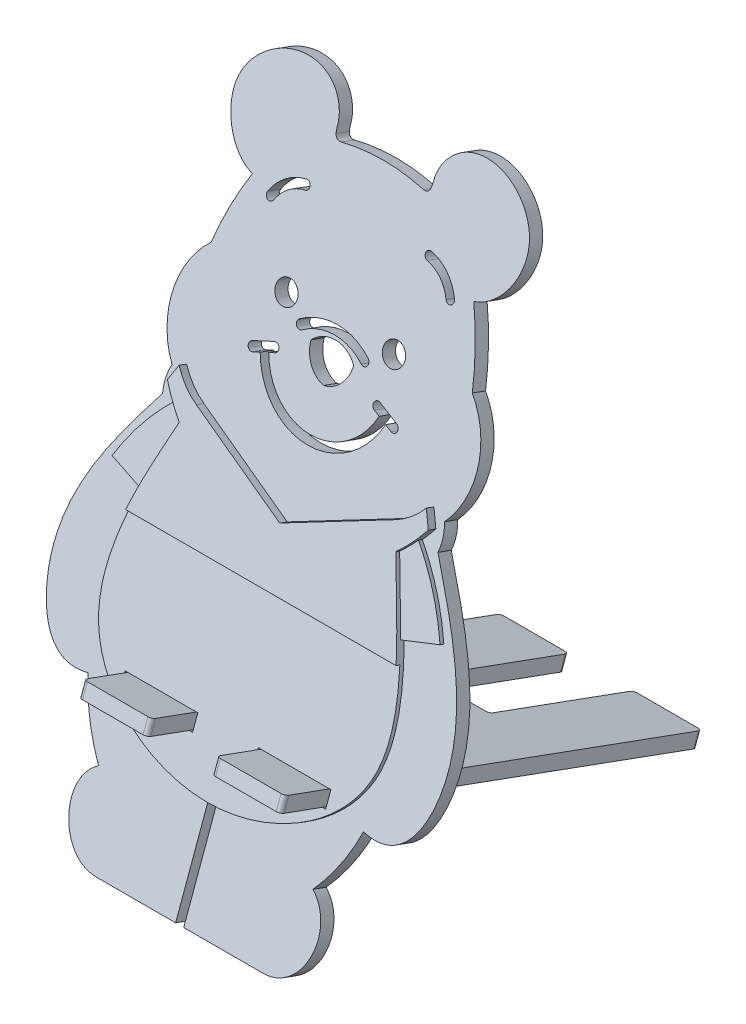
ISO-10303-21;
HEADER;
FILE_DESCRIPTION(('STEP AP214'),'2;1');
FILE_NAME('part.step','',(''),(''),'','','');
FILE_SCHEMA(('AUTOMOTIVE_DESIGN { 1 0 10303 214 1 1 1 1 }'));
ENDSEC;
DATA;
#1=APPLICATION_CONTEXT('core data for automotive mechanical design processes');
#2=APPLICATION_PROTOCOL_DEFINITION('international standard','automotive_design',2000,#1);
#3=PRODUCT_CONTEXT('',#1,'mechanical');
#4=PRODUCT('Part','Part','',(#3));
#5=PRODUCT_RELATED_PRODUCT_CATEGORY('part','',(#4));
#6=PRODUCT_DEFINITION_FORMATION('','',#4);
#7=PRODUCT_DEFINITION_CONTEXT('part definition',#1,'design');
#8=PRODUCT_DEFINITION('design','',#6,#7);
#9=PRODUCT_DEFINITION_SHAPE('','',#8);
#10=(LENGTH_UNIT() NAMED_UNIT(*) SI_UNIT(.MILLI.,.METRE.));
#11=(NAMED_UNIT(*) PLANE_ANGLE_UNIT() SI_UNIT($,.RADIAN.));
#12=(NAMED_UNIT(*) SI_UNIT($,.STERADIAN.) SOLID_ANGLE_UNIT());
#13=UNCERTAINTY_MEASURE_WITH_UNIT(LENGTH_MEASURE(1.E-05),#10,'distance_accuracy_value','');
#14=(GEOMETRIC_REPRESENTATION_CONTEXT(3) GLOBAL_UNCERTAINTY_ASSIGNED_CONTEXT((#13)) GLOBAL_UNIT_ASSIGNED_CONTEXT((#10,
#11,#12)) REPRESENTATION_CONTEXT('',''));
#15=CARTESIAN_POINT('',(0.,0.,0.));
#16=DIRECTION('',(0.,0.,1.));
#17=DIRECTION('',(1.,0.,0.));
#18=AXIS2_PLACEMENT_3D('',#15,#16,#17);
#19=CARTESIAN_POINT('',(-20.658830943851,1.19707050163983,3.28892417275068));
#20=DIRECTION('',(0.,-0.939692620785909,0.342020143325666));
#21=DIRECTION('',(0.,-0.342020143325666,-0.93969262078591));
#22=AXIS2_PLACEMENT_3D('',#19,#20,#21);
#23=PLANE('',#22);
#24=DIRECTION('',(0.,0.342020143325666,0.93969262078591));
#25=VECTOR('',#24,1.);
#26=CARTESIAN_POINT('',(0.999999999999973,1.19707050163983,3.28892417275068));
#27=LINE('',#26,#25);
#28=CARTESIAN_POINT('',(0.99999999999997,0.,0.));
#29=VERTEX_POINT('',#28);
#30=CARTESIAN_POINT('',(0.999999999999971,1.19707050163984,3.28892417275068));
#31=VERTEX_POINT('',#30);
#32=EDGE_CURVE('E518',#29,#31,#27,.T.);
#33=ORIENTED_EDGE('',*,*,#32,.F.);
#34=DIRECTION('',(-1.,0.,0.));
#35=VECTOR('',#34,1.);
#36=CARTESIAN_POINT('',(-20.658830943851,0.,0.));
#37=LINE('',#36,#35);
#38=CARTESIAN_POINT('',(20.658830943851,0.,0.));
#39=VERTEX_POINT('',#38);
#40=EDGE_CURVE('E801',#39,#29,#37,.T.);
#41=ORIENTED_EDGE('',*,*,#40,.F.);
#42=DIRECTION('',(0.,-0.342020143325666,-0.93969262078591));
#43=VECTOR('',#42,1.);
#44=CARTESIAN_POINT('',(20.658830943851,1.19707050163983,3.28892417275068));
#45=LINE('',#44,#43);
#46=CARTESIAN_POINT('',(20.658830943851,1.19707050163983,3.28892417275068));
#47=VERTEX_POINT('',#46);
#48=EDGE_CURVE('E922',#47,#39,#45,.T.);
#49=ORIENTED_EDGE('',*,*,#48,.F.);
#50=DIRECTION('',(-1.,0.,0.));
#51=VECTOR('',#50,1.);
#52=CARTESIAN_POINT('',(-20.658830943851,1.19707050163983,3.28892417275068));
#53=LINE('',#52,#51);
#54=EDGE_CURVE('E758',#47,#31,#53,.T.);
#55=ORIENTED_EDGE('',*,*,#54,.T.);
#56=EDGE_LOOP('',(#33,#41,#49,#55));
#57=FACE_BOUND('',#56,.T.);
#58=ADVANCED_FACE('F50',(#57),#23,.T.);
#59=CARTESIAN_POINT('',(30.0865114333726,8.31347205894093,0.698765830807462));
#60=DIRECTION('',(0.,0.342020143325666,0.93969262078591));
#61=DIRECTION('',(0.,-0.93969262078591,0.342020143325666));
#62=AXIS2_PLACEMENT_3D('',#59,#60,#61);
#63=PLANE('',#62);
#64=DIRECTION('',(0.,0.939692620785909,-0.342020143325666));
#65=VECTOR('',#64,1.);
#66=CARTESIAN_POINT('',(0.999999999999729,23.500717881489,-4.82893958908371));
#67=LINE('',#66,#65);
#68=CARTESIAN_POINT('',(1.00000000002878,23.5007178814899,-4.82893958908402));
#69=VERTEX_POINT('',#68);
#70=EDGE_CURVE('E513',#31,#69,#67,.T.);
#71=ORIENTED_EDGE('',*,*,#70,.F.);
#72=ORIENTED_EDGE('',*,*,#54,.F.);
#73=CARTESIAN_POINT('',(26.5597907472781,18.9413749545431,-3.16947447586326));
#74=CARTESIAN_POINT('',(34.1896855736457,14.2593731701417,-1.46536518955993));
#75=CARTESIAN_POINT('',(30.3014710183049,1.19707050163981,3.28892417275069));
#76=CARTESIAN_POINT('',(20.658830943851,1.19707050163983,3.28892417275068));
#77=B_SPLINE_CURVE_WITH_KNOTS('',3,(#73,#74,#75,#76),.UNSPECIFIED.,.F.,.F.,(4,4),(0.,1.),.UNSPECIFIED.);
#78=CARTESIAN_POINT('',(26.5597907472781,18.9413749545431,-3.16947447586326));
#79=VERTEX_POINT('',#78);
#80=EDGE_CURVE('E750',#79,#47,#77,.T.);
#81=ORIENTED_EDGE('',*,*,#80,.F.);
#82=CARTESIAN_POINT('',(-4.86890318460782,43.0001810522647,-11.9261637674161));
#83=DIRECTION('',(0.,-0.342020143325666,-0.93969262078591));
#84=DIRECTION('',(0.,-0.93969262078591,0.342020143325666));
#85=AXIS2_PLACEMENT_3D('',#82,#83,#84);
#86=CIRCLE('',#85,40.5372490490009);
#87=CARTESIAN_POINT('',(34.1328882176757,32.6154581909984,-8.1464337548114));
#88=VERTEX_POINT('',#87);
#89=EDGE_CURVE('E924',#88,#79,#86,.T.);
#90=ORIENTED_EDGE('',*,*,#89,.F.);
#91=CARTESIAN_POINT('',(34.1328882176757,83.3575360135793,-26.6150397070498));
#92=CARTESIAN_POINT('',(41.637903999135,72.4487420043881,-22.6445633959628));
#93=CARTESIAN_POINT('',(55.3631414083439,53.1829507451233,-15.6323888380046));
#94=CARTESIAN_POINT('',(43.5680468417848,30.5550086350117,-7.39649144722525));
#95=CARTESIAN_POINT('',(34.1328882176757,32.6154581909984,-8.1464337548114));
#96=B_SPLINE_CURVE_WITH_KNOTS('',3,(#91,#92,#93,#94,#95),.UNSPECIFIED.,.F.,.F.,(4,1,4),(0.,
0.658002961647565,1.),.UNSPECIFIED.);
#97=CARTESIAN_POINT('',(34.1328882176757,83.3575360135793,-26.6150397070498));
#98=VERTEX_POINT('',#97);
#99=EDGE_CURVE('E1140',#98,#88,#96,.T.);
#100=ORIENTED_EDGE('',*,*,#99,.F.);
#101=CARTESIAN_POINT('',(24.6805955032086,85.5068324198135,-27.3973196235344));
#102=DIRECTION('',(0.,-0.342020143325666,-0.93969262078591));
#103=DIRECTION('',(0.,-0.93969262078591,0.342020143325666));
#104=AXIS2_PLACEMENT_3D('',#101,#102,#103);
#105=CIRCLE('',#104,9.72508480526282);
#106=CARTESIAN_POINT('',(33.7693165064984,88.7582809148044,-28.5807500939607));
#107=VERTEX_POINT('',#106);
#108=EDGE_CURVE('E1135',#107,#98,#105,.T.);
#109=ORIENTED_EDGE('',*,*,#108,.F.);
#110=CARTESIAN_POINT('',(20.1058535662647,99.4544727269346,-32.473845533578));
#111=DIRECTION('',(0.,-0.342020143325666,-0.93969262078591));
#112=DIRECTION('',(0.,-0.93969262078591,0.342020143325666));
#113=AXIS2_PLACEMENT_3D('',#110,#111,#112);
#114=CIRCLE('',#113,17.7835578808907);
#115=CARTESIAN_POINT('',(32.3747780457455,111.551657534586,-36.8768607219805));
#116=VERTEX_POINT('',#115);
#117=EDGE_CURVE('E1180',#116,#107,#114,.T.);
#118=ORIENTED_EDGE('',*,*,#117,.F.);
#119=CARTESIAN_POINT('',(-31.0641204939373,100.553635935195,-32.8739082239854));
#120=DIRECTION('',(0.,-0.342020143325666,-0.93969262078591));
#121=DIRECTION('',(0.,-0.93969262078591,0.342020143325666));
#122=AXIS2_PLACEMENT_3D('',#119,#120,#121);
#123=CIRCLE('',#122,64.5094873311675);
#124=CARTESIAN_POINT('',(27.4360429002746,126.102301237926,-42.1728619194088));
#125=VERTEX_POINT('',#124);
#126=EDGE_CURVE('E1123',#125,#116,#123,.T.);
#127=ORIENTED_EDGE('',*,*,#126,.F.);
#128=CARTESIAN_POINT('',(11.7536169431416,140.001478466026,-47.2317487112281));
#129=CARTESIAN_POINT('',(11.9474012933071,140.655931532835,-47.4699501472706));
#130=CARTESIAN_POINT('',(11.6740764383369,143.552564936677,-48.5242384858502));
#131=CARTESIAN_POINT('',(15.4412558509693,149.477263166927,-50.6806522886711));
#132=CARTESIAN_POINT('',(27.1992651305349,150.985772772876,-51.2297048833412));
#133=CARTESIAN_POINT('',(40.7457206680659,140.035515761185,-47.2441372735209));
#134=CARTESIAN_POINT('',(33.3634073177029,127.582188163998,-42.7114967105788));
#135=CARTESIAN_POINT('',(27.4360429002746,126.102301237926,-42.1728619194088));
#136=B_SPLINE_CURVE_WITH_KNOTS('',3,(#128,#129,#130,#131,#132,#133,#134,#135),.UNSPECIFIED.,.F.,
.F.,(4,1,1,1,1,4),(0.0658827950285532,0.103766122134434,0.230181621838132,0.409217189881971,
0.672978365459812,1.),.UNSPECIFIED.);
#137=CARTESIAN_POINT('',(11.7536169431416,140.001478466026,-47.2317487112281));
#138=VERTEX_POINT('',#137);
#139=EDGE_CURVE('E1117',#138,#125,#136,.T.);
#140=ORIENTED_EDGE('',*,*,#139,.F.);
#141=CARTESIAN_POINT('',(10.5011943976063,140.328941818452,-47.3509356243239));
#142=DIRECTION('',(0.,0.342020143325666,0.93969262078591));
#143=DIRECTION('',(0.,0.93969262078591,-0.342020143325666));
#144=AXIS2_PLACEMENT_3D('',#141,#142,#143);
#145=CIRCLE('',#144,1.30000000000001);
#146=CARTESIAN_POINT('',(10.2350822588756,139.133209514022,-46.9157246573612));
#147=VERTEX_POINT('',#146);
#148=EDGE_CURVE('E1175',#147,#138,#145,.T.);
#149=ORIENTED_EDGE('',*,*,#148,.F.);
#150=CARTESIAN_POINT('',(0.,93.143505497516,-30.1768413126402));
#151=DIRECTION('',(0.,-0.342020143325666,-0.93969262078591));
#152=DIRECTION('',(0.,0.93969262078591,-0.342020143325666));
#153=AXIS2_PLACEMENT_3D('',#150,#151,#152);
#154=CIRCLE('',#153,50.);
#155=CARTESIAN_POINT('',(-10.2350822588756,139.133209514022,-46.9157246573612));
#156=VERTEX_POINT('',#155);
#157=EDGE_CURVE('E1106',#156,#147,#154,.T.);
#158=ORIENTED_EDGE('',*,*,#157,.F.);
#159=CARTESIAN_POINT('',(-10.5011943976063,140.328941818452,-47.3509356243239));
#160=DIRECTION('',(0.,0.342020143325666,0.93969262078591));
#161=DIRECTION('',(0.,-0.93969262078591,0.342020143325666));
#162=AXIS2_PLACEMENT_3D('',#159,#160,#161);
#163=CIRCLE('',#162,1.30000000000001);
#164=CARTESIAN_POINT('',(-11.7536169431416,140.001478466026,-47.231748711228));
#165=VERTEX_POINT('',#164);
#166=EDGE_CURVE('E1100',#165,#156,#163,.T.);
#167=ORIENTED_EDGE('',*,*,#166,.F.);
#168=CARTESIAN_POINT('',(-27.4360429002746,126.102301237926,-42.1728619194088));
#169=CARTESIAN_POINT('',(-33.3634073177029,127.582188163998,-42.7114967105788));
#170=CARTESIAN_POINT('',(-40.7457206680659,140.035515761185,-47.2441372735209));
#171=CARTESIAN_POINT('',(-27.1992651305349,150.985772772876,-51.2297048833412));
#172=CARTESIAN_POINT('',(-15.4412558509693,149.477263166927,-50.6806522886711));
#173=CARTESIAN_POINT('',(-11.6740764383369,143.552564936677,-48.5242384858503));
#174=CARTESIAN_POINT('',(-11.9474012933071,140.655931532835,-47.4699501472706));
#175=CARTESIAN_POINT('',(-11.7536169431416,140.001478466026,-47.2317487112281));
#176=B_SPLINE_CURVE_WITH_KNOTS('',3,(#168,#169,#170,#171,#172,#173,#174,#175),.UNSPECIFIED.,.F.,
.F.,(4,1,1,1,1,4),(0.0658827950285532,0.392904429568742,0.656665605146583,0.835701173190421,
0.962116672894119,1.),.UNSPECIFIED.);
#177=CARTESIAN_POINT('',(-27.4360429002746,126.102301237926,-42.1728619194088));
#178=VERTEX_POINT('',#177);
#179=EDGE_CURVE('E1181',#178,#165,#176,.T.);
#180=ORIENTED_EDGE('',*,*,#179,.F.);
#181=CARTESIAN_POINT('',(31.0641204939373,100.553635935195,-32.8739082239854));
#182=DIRECTION('',(0.,-0.342020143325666,-0.93969262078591));
#183=DIRECTION('',(0.,0.93969262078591,-0.342020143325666));
#184=AXIS2_PLACEMENT_3D('',#181,#182,#183);
#185=CIRCLE('',#184,64.5094873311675);
#186=CARTESIAN_POINT('',(-32.3747780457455,111.551657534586,-36.8768607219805));
#187=VERTEX_POINT('',#186);
#188=EDGE_CURVE('E1089',#187,#178,#185,.T.);
#189=ORIENTED_EDGE('',*,*,#188,.F.);
#190=CARTESIAN_POINT('',(-20.1058535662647,99.4544727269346,-32.473845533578));
#191=DIRECTION('',(0.,-0.342020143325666,-0.93969262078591));
#192=DIRECTION('',(0.,0.93969262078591,-0.342020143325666));
#193=AXIS2_PLACEMENT_3D('',#190,#191,#192);
#194=CIRCLE('',#193,17.7835578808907);
#195=CARTESIAN_POINT('',(-33.7693165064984,88.7582809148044,-28.5807500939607));
#196=VERTEX_POINT('',#195);
#197=EDGE_CURVE('E1083',#196,#187,#194,.T.);
#198=ORIENTED_EDGE('',*,*,#197,.F.);
#199=CARTESIAN_POINT('',(-24.6805955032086,85.5068324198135,-27.3973196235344));
#200=DIRECTION('',(0.,-0.342020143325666,-0.93969262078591));
#201=DIRECTION('',(0.,0.93969262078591,-0.342020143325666));
#202=AXIS2_PLACEMENT_3D('',#199,#200,#201);
#203=CIRCLE('',#202,9.72508480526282);
#204=CARTESIAN_POINT('',(-34.1328882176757,83.3575360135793,-26.6150397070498));
#205=VERTEX_POINT('',#204);
#206=EDGE_CURVE('E1206',#205,#196,#203,.T.);
#207=ORIENTED_EDGE('',*,*,#206,.F.);
#208=CARTESIAN_POINT('',(-34.1328882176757,32.6154581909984,-8.1464337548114));
#209=CARTESIAN_POINT('',(-43.5680468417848,30.5550086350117,-7.39649144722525));
#210=CARTESIAN_POINT('',(-55.3631414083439,53.1829507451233,-15.6323888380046));
#211=CARTESIAN_POINT('',(-41.637903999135,72.4487420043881,-22.6445633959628));
#212=CARTESIAN_POINT('',(-34.1328882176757,83.3575360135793,-26.6150397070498));
#213=B_SPLINE_CURVE_WITH_KNOTS('',3,(#208,#209,#210,#211,#212),.UNSPECIFIED.,.F.,.F.,(4,1,4),
(0.,0.341997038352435,1.),.UNSPECIFIED.);
#214=CARTESIAN_POINT('',(-34.1328882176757,32.6154581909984,-8.1464337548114));
#215=VERTEX_POINT('',#214);
#216=EDGE_CURVE('E1072',#215,#205,#213,.T.);
#217=ORIENTED_EDGE('',*,*,#216,.F.);
#218=CARTESIAN_POINT('',(4.86890318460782,43.0001810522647,-11.9261637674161));
#219=DIRECTION('',(0.,-0.342020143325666,-0.93969262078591));
#220=DIRECTION('',(0.,0.93969262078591,-0.342020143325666));
#221=AXIS2_PLACEMENT_3D('',#218,#219,#220);
#222=CIRCLE('',#221,40.5372490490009);
#223=CARTESIAN_POINT('',(-26.5597907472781,18.9413749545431,-3.16947447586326));
#224=VERTEX_POINT('',#223);
#225=EDGE_CURVE('E769',#224,#215,#222,.T.);
#226=ORIENTED_EDGE('',*,*,#225,.F.);
#227=CARTESIAN_POINT('',(-20.658830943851,1.19707050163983,3.28892417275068));
#228=CARTESIAN_POINT('',(-30.3014710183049,1.19707050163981,3.28892417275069));
#229=CARTESIAN_POINT('',(-34.1896855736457,14.2593731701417,-1.46536518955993));
#230=CARTESIAN_POINT('',(-26.5597907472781,18.9413749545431,-3.16947447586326));
#231=B_SPLINE_CURVE_WITH_KNOTS('',3,(#227,#228,#229,#230),.UNSPECIFIED.,.F.,.F.,(4,4),(0.,1.),.UNSPECIFIED.);
#232=CARTESIAN_POINT('',(-20.658830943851,1.19707050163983,3.28892417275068));
#233=VERTEX_POINT('',#232);
#234=EDGE_CURVE('E763',#233,#224,#231,.T.);
#235=ORIENTED_EDGE('',*,*,#234,.F.);
#236=CARTESIAN_POINT('',(-1.00000000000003,1.19707050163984,3.28892417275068));
#237=VERTEX_POINT('',#236);
#238=EDGE_CURVE('E756',#237,#233,#53,.T.);
#239=ORIENTED_EDGE('',*,*,#238,.F.);
#240=DIRECTION('',(0.,-0.939692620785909,0.342020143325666));
#241=VECTOR('',#240,1.);
#242=CARTESIAN_POINT('',(-1.00000000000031,23.4851912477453,-4.82328835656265));
#243=LINE('',#242,#241);
#244=CARTESIAN_POINT('',(-1.00000000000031,23.4851912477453,-4.82328835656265));
#245=VERTEX_POINT('',#244);
#246=EDGE_CURVE('E529',#245,#237,#243,.T.);
#247=ORIENTED_EDGE('',*,*,#246,.F.);
#248=CARTESIAN_POINT('',(26.6086943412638,80.5100753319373,-25.5786487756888));
#249=CARTESIAN_POINT('',(30.3531997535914,70.0172964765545,-21.7595895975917));
#250=CARTESIAN_POINT('',(45.805619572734,39.713949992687,-10.7300734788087));
#251=CARTESIAN_POINT('',(0.264221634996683,15.8443034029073,-2.04223261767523));
#252=CARTESIAN_POINT('',(-45.5359038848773,38.860724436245,-10.4195247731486));
#253=CARTESIAN_POINT('',(-31.5523614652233,70.2147630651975,-21.8314615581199));
#254=CARTESIAN_POINT('',(-27.2895222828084,81.307677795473,-25.8689523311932));
#255=B_SPLINE_CURVE_WITH_KNOTS('',3,(#248,#249,#250,#251,#252,#253,#254),.UNSPECIFIED.,.F.,.F.,
(4,1,1,1,4),(0.,0.251794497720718,0.49634766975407,0.735170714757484,1.),.UNSPECIFIED.);
#256=CARTESIAN_POINT('',(-32.6401535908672,66.8559788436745,-20.6089640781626));
#257=VERTEX_POINT('',#256);
#258=EDGE_CURVE('E538',#245,#257,#255,.T.);
#259=ORIENTED_EDGE('',*,*,#258,.T.);
#260=DIRECTION('',(0.946392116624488,-0.303539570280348,0.110479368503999));
#261=VECTOR('',#260,1.);
#262=CARTESIAN_POINT('',(-30.6061527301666,66.2036068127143,-20.3715200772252));
#263=LINE('',#262,#261);
#264=CARTESIAN_POINT('',(-40.6564777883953,69.4270818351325,-21.544769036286));
#265=VERTEX_POINT('',#264);
#266=EDGE_CURVE('E1219',#265,#257,#263,.T.);
#267=ORIENTED_EDGE('',*,*,#266,.F.);
#268=CARTESIAN_POINT('',(5.51121668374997,50.2723908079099,-14.5730316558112));
#269=DIRECTION('',(0.,0.342020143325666,0.93969262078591));
#270=DIRECTION('',(0.,0.93969262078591,-0.342020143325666));
#271=AXIS2_PLACEMENT_3D('',#268,#269,#270);
#272=CIRCLE('',#271,50.4674481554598);
#273=CARTESIAN_POINT('',(-30.0337208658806,83.9380607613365,-26.8263334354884));
#274=VERTEX_POINT('',#273);
#275=EDGE_CURVE('E1230',#274,#265,#272,.T.);
#276=ORIENTED_EDGE('',*,*,#275,.F.);
#277=CARTESIAN_POINT('',(-0.144440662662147,107.083303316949,-35.2505127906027));
#278=DIRECTION('',(0.,0.342020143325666,0.93969262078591));
#279=DIRECTION('',(0.,-0.93969262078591,0.342020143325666));
#280=AXIS2_PLACEMENT_3D('',#277,#278,#279);
#281=CIRCLE('',#280,38.7303256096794);
#282=CARTESIAN_POINT('',(-32.3340345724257,86.8445805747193,-27.8842201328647));
#283=VERTEX_POINT('',#282);
#284=EDGE_CURVE('E547',#283,#274,#281,.T.);
#285=ORIENTED_EDGE('',*,*,#284,.F.);
#286=DIRECTION('',(-0.430154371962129,-0.84831253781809,0.308760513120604));
#287=VECTOR('',#286,1.);
#288=CARTESIAN_POINT('',(-61.7446638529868,28.8435298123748,-6.77356409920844));
#289=LINE('',#288,#287);
#290=CARTESIAN_POINT('',(-30.6557602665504,90.1543252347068,-29.0888686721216));
#291=VERTEX_POINT('',#290);
#292=EDGE_CURVE('E1536',#291,#283,#289,.T.);
#293=ORIENTED_EDGE('',*,*,#292,.F.);
#294=CARTESIAN_POINT('',(-17.8506883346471,98.9761733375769,-32.2997587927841));
#295=DIRECTION('',(0.,0.342020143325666,0.93969262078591));
#296=DIRECTION('',(0.,-0.93969262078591,0.342020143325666));
#297=AXIS2_PLACEMENT_3D('',#294,#295,#296);
#298=CIRCLE('',#297,15.8778048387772);
#299=CARTESIAN_POINT('',(-24.6805955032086,85.5068324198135,-27.3973196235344));
#300=VERTEX_POINT('',#299);
#301=EDGE_CURVE('E1535',#300,#291,#298,.F.);
#302=ORIENTED_EDGE('',*,*,#301,.F.);
#303=DIRECTION('',(-0.902755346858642,0.40421288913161,-0.147121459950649));
#304=VECTOR('',#303,1.);
#305=CARTESIAN_POINT('',(30.2739474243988,60.9006812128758,-18.4414130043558));
#306=LINE('',#305,#304);
#307=CARTESIAN_POINT('',(0.,74.455981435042,-23.3751388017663));
#308=VERTEX_POINT('',#307);
#309=EDGE_CURVE('E1532',#308,#300,#306,.T.);
#310=ORIENTED_EDGE('',*,*,#309,.F.);
#311=DIRECTION('',(0.902755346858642,0.40421288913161,-0.147121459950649));
#312=VECTOR('',#311,1.);
#313=CARTESIAN_POINT('',(-30.2739474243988,60.9006812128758,-18.4414130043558));
#314=LINE('',#313,#312);
#315=CARTESIAN_POINT('',(24.6805955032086,85.5068324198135,-27.3973196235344));
#316=VERTEX_POINT('',#315);
#317=EDGE_CURVE('E1280',#308,#316,#314,.T.);
#318=ORIENTED_EDGE('',*,*,#317,.T.);
#319=CARTESIAN_POINT('',(17.8506883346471,98.9761733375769,-32.2997587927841));
#320=DIRECTION('',(0.,0.342020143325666,0.93969262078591));
#321=DIRECTION('',(0.,-0.93969262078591,0.342020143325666));
#322=AXIS2_PLACEMENT_3D('',#319,#320,#321);
#323=CIRCLE('',#322,15.8778048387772);
#324=CARTESIAN_POINT('',(30.6557602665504,90.1543252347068,-29.0888686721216));
#325=VERTEX_POINT('',#324);
#326=EDGE_CURVE('E557',#316,#325,#323,.T.);
#327=ORIENTED_EDGE('',*,*,#326,.T.);
#328=DIRECTION('',(0.430154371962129,-0.84831253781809,0.308760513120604));
#329=VECTOR('',#328,1.);
#330=CARTESIAN_POINT('',(61.7446638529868,28.8435298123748,-6.77356409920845));
#331=LINE('',#330,#329);
#332=CARTESIAN_POINT('',(32.3340345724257,86.8445805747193,-27.8842201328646));
#333=VERTEX_POINT('',#332);
#334=EDGE_CURVE('E545',#325,#333,#331,.T.);
#335=ORIENTED_EDGE('',*,*,#334,.T.);
#336=CARTESIAN_POINT('',(0.144440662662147,107.083303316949,-35.2505127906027));
#337=DIRECTION('',(0.,0.342020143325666,0.93969262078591));
#338=DIRECTION('',(0.,-0.93969262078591,0.342020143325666));
#339=AXIS2_PLACEMENT_3D('',#336,#337,#338);
#340=CIRCLE('',#339,38.7303256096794);
#341=CARTESIAN_POINT('',(30.0337208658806,83.9380607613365,-26.8263334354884));
#342=VERTEX_POINT('',#341);
#343=EDGE_CURVE('E543',#333,#342,#340,.F.);
#344=ORIENTED_EDGE('',*,*,#343,.T.);
#345=CARTESIAN_POINT('',(-5.51121668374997,50.2723908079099,-14.5730316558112));
#346=DIRECTION('',(0.,0.342020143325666,0.93969262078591));
#347=DIRECTION('',(0.,-0.93969262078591,0.342020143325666));
#348=AXIS2_PLACEMENT_3D('',#345,#346,#347);
#349=CIRCLE('',#348,50.4674481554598);
#350=CARTESIAN_POINT('',(40.6564777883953,69.4270818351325,-21.544769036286));
#351=VERTEX_POINT('',#350);
#352=EDGE_CURVE('E74',#351,#342,#349,.T.);
#353=ORIENTED_EDGE('',*,*,#352,.F.);
#354=DIRECTION('',(0.946392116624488,0.303539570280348,-0.110479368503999));
#355=VECTOR('',#354,1.);
#356=CARTESIAN_POINT('',(30.6061527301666,66.2036068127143,-20.3715200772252));
#357=LINE('',#356,#355);
#358=CARTESIAN_POINT('',(31.8758911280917,66.6108543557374,-20.5197460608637));
#359=VERTEX_POINT('',#358);
#360=EDGE_CURVE('E542',#359,#351,#357,.T.);
#361=ORIENTED_EDGE('',*,*,#360,.F.);
#362=EDGE_CURVE('E535',#359,#69,#255,.T.);
#363=ORIENTED_EDGE('',*,*,#362,.T.);
#364=EDGE_LOOP('',(#71,#72,#81,#90,#100,#109,#118,#127,#140,#149,#158,#167,#180,#189,#198,#207,
#217,#226,#235,#239,#247,#259,#267,#276,#285,#293,#302,#310,#318,#327,#335,#344,#353,#361,#363));
#365=FACE_BOUND('',#364,.T.);
#366=CARTESIAN_POINT('',(1.20064566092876,105.265564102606,-34.5889098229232));
#367=DIRECTION('',(0.,0.342020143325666,0.93969262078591));
#368=DIRECTION('',(0.,0.93969262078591,-0.342020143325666));
#369=AXIS2_PLACEMENT_3D('',#366,#367,#368);
#370=CIRCLE('',#369,6.5300309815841);
#371=CARTESIAN_POINT('',(-5.32938178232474,105.271951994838,-34.5912348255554));
#372=VERTEX_POINT('',#371);
#373=CARTESIAN_POINT('',(0.,99.2339557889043,-32.3935839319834));
#374=VERTEX_POINT('',#373);
#375=EDGE_CURVE('E644',#372,#374,#370,.T.);
#376=ORIENTED_EDGE('',*,*,#375,.F.);
#377=CARTESIAN_POINT('',(-0.0695359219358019,100.853753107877,-32.9831419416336));
#378=DIRECTION('',(0.,0.342020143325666,0.93969262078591));
#379=DIRECTION('',(0.,0.93969262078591,-0.342020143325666));
#380=AXIS2_PLACEMENT_3D('',#377,#378,#379);
#381=CIRCLE('',#380,7.05495730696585);
#382=CARTESIAN_POINT('',(5.32762789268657,105.123210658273,-34.537097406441));
#383=VERTEX_POINT('',#382);
#384=EDGE_CURVE('E671',#383,#372,#381,.T.);
#385=ORIENTED_EDGE('',*,*,#384,.F.);
#386=CARTESIAN_POINT('',(-1.20064566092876,105.265564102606,-34.5889098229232));
#387=DIRECTION('',(0.,0.342020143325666,0.93969262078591));
#388=DIRECTION('',(0.,0.93969262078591,-0.342020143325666));
#389=AXIS2_PLACEMENT_3D('',#386,#387,#388);
#390=CIRCLE('',#389,6.5300309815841);
#391=EDGE_CURVE('E668',#374,#383,#390,.T.);
#392=ORIENTED_EDGE('',*,*,#391,.F.);
#393=EDGE_LOOP('',(#376,#385,#392));
#394=FACE_BOUND('',#393,.T.);
#395=CARTESIAN_POINT('',(0.,103.883668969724,-34.0859411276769));
#396=DIRECTION('',(0.,-0.342020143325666,-0.93969262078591));
#397=DIRECTION('',(0.,-0.93969262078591,0.342020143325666));
#398=AXIS2_PLACEMENT_3D('',#395,#396,#397);
#399=CIRCLE('',#398,14.4882497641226);
#400=CARTESIAN_POINT('',(13.688672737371,99.4233825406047,-32.4625296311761));
#401=VERTEX_POINT('',#400);
#402=CARTESIAN_POINT('',(-13.688672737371,99.4233825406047,-32.4625296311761));
#403=VERTEX_POINT('',#402);
#404=EDGE_CURVE('E606',#401,#403,#399,.T.);
#405=ORIENTED_EDGE('',*,*,#404,.F.);
#406=DIRECTION('',(0.924531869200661,-0.358121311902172,0.130345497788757));
#407=VECTOR('',#406,1.);
#408=CARTESIAN_POINT('',(12.3215219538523,99.9529541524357,-32.655277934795));
#409=LINE('',#408,#407);
#410=CARTESIAN_POINT('',(12.3215219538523,99.9529541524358,-32.655277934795));
#411=VERTEX_POINT('',#410);
#412=EDGE_CURVE('E638',#411,#401,#409,.T.);
#413=ORIENTED_EDGE('',*,*,#412,.F.);
#414=CARTESIAN_POINT('',(12.7026266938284,100.821729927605,-32.9714864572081));
#415=DIRECTION('',(0.,0.342020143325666,0.93969262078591));
#416=DIRECTION('',(0.,-0.93969262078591,0.342020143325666));
#417=AXIS2_PLACEMENT_3D('',#414,#415,#416);
#418=CIRCLE('',#417,0.999999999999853);
#419=CARTESIAN_POINT('',(13.0837314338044,101.690505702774,-33.2876949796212));
#420=VERTEX_POINT('',#419);
#421=EDGE_CURVE('E635',#420,#411,#418,.T.);
#422=ORIENTED_EDGE('',*,*,#421,.F.);
#423=DIRECTION('',(-0.9245318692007,0.358121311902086,-0.13034549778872));
#424=VECTOR('',#423,1.);
#425=CARTESIAN_POINT('',(13.0837314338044,101.690505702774,-33.2876949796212));
#426=LINE('',#425,#424);
#427=CARTESIAN_POINT('',(17.9283925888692,99.813905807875,-32.6046684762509));
#428=VERTEX_POINT('',#427);
#429=EDGE_CURVE('E632',#428,#420,#426,.T.);
#430=ORIENTED_EDGE('',*,*,#429,.F.);
#431=CARTESIAN_POINT('',(17.5472878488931,98.9451300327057,-32.2884599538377));
#432=DIRECTION('',(0.,0.342020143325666,0.93969262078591));
#433=DIRECTION('',(0.,-0.93969262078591,0.342020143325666));
#434=AXIS2_PLACEMENT_3D('',#431,#432,#433);
#435=CIRCLE('',#434,0.999999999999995);
#436=CARTESIAN_POINT('',(17.1661831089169,98.0763542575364,-31.9722514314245));
#437=VERTEX_POINT('',#436);
#438=EDGE_CURVE('E629',#437,#428,#435,.T.);
#439=ORIENTED_EDGE('',*,*,#438,.F.);
#440=DIRECTION('',(0.924531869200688,-0.358121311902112,0.130345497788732));
#441=VECTOR('',#440,1.);
#442=CARTESIAN_POINT('',(15.5403987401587,98.706108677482,-32.2014632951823));
#443=LINE('',#442,#441);
#444=CARTESIAN_POINT('',(15.5403987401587,98.706108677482,-32.2014632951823));
#445=VERTEX_POINT('',#444);
#446=EDGE_CURVE('E626',#445,#437,#443,.T.);
#447=ORIENTED_EDGE('',*,*,#446,.F.);
#448=CARTESIAN_POINT('',(0.,103.883668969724,-34.0859411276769));
#449=DIRECTION('',(0.,0.342020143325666,0.93969262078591));
#450=DIRECTION('',(0.,-0.93969262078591,0.342020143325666));
#451=AXIS2_PLACEMENT_3D('',#448,#449,#450);
#452=CIRCLE('',#451,16.4882497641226);
#453=CARTESIAN_POINT('',(-15.5403987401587,98.706108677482,-32.2014632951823));
#454=VERTEX_POINT('',#453);
#455=EDGE_CURVE('E623',#454,#445,#452,.T.);
#456=ORIENTED_EDGE('',*,*,#455,.F.);
#457=DIRECTION('',(0.924531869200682,0.358121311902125,-0.130345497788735));
#458=VECTOR('',#457,1.);
#459=CARTESIAN_POINT('',(-15.5403987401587,98.706108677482,-32.2014632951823));
#460=LINE('',#459,#458);
#461=CARTESIAN_POINT('',(-17.1661831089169,98.0763542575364,-31.9722514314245));
#462=VERTEX_POINT('',#461);
#463=EDGE_CURVE('E620',#462,#454,#460,.T.);
#464=ORIENTED_EDGE('',*,*,#463,.F.);
#465=CARTESIAN_POINT('',(-17.5472878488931,98.9451300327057,-32.2884599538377));
#466=DIRECTION('',(0.,0.342020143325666,0.93969262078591));
#467=DIRECTION('',(0.,0.93969262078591,-0.342020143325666));
#468=AXIS2_PLACEMENT_3D('',#465,#466,#467);
#469=CIRCLE('',#468,0.999999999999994);
#470=CARTESIAN_POINT('',(-17.9283925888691,99.813905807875,-32.6046684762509));
#471=VERTEX_POINT('',#470);
#472=EDGE_CURVE('E617',#471,#462,#469,.T.);
#473=ORIENTED_EDGE('',*,*,#472,.F.);
#474=DIRECTION('',(-0.924531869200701,-0.358121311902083,0.13034549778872));
#475=VECTOR('',#474,1.);
#476=CARTESIAN_POINT('',(-13.0837314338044,101.690505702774,-33.2876949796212));
#477=LINE('',#476,#475);
#478=CARTESIAN_POINT('',(-13.0837314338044,101.690505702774,-33.2876949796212));
#479=VERTEX_POINT('',#478);
#480=EDGE_CURVE('E614',#479,#471,#477,.T.);
#481=ORIENTED_EDGE('',*,*,#480,.F.);
#482=CARTESIAN_POINT('',(-12.7026266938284,100.821729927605,-32.9714864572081));
#483=DIRECTION('',(0.,0.342020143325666,0.93969262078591));
#484=DIRECTION('',(0.,0.93969262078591,-0.342020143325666));
#485=AXIS2_PLACEMENT_3D('',#482,#483,#484);
#486=CIRCLE('',#485,0.99999999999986);
#487=CARTESIAN_POINT('',(-12.3215219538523,99.9529541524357,-32.6552779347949));
#488=VERTEX_POINT('',#487);
#489=EDGE_CURVE('E611',#488,#479,#486,.T.);
#490=ORIENTED_EDGE('',*,*,#489,.F.);
#491=DIRECTION('',(0.924531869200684,0.358121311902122,-0.130345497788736));
#492=VECTOR('',#491,1.);
#493=CARTESIAN_POINT('',(-12.3215219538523,99.9529541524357,-32.6552779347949));
#494=LINE('',#493,#492);
#495=EDGE_CURVE('E608',#403,#488,#494,.T.);
#496=ORIENTED_EDGE('',*,*,#495,.F.);
#497=EDGE_LOOP('',(#405,#413,#422,#430,#439,#447,#456,#464,#473,#481,#490,#496));
#498=FACE_BOUND('',#497,.T.);
#499=CARTESIAN_POINT('',(7.43871835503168,106.771270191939,-35.1369420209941));
#500=DIRECTION('',(0.,0.342020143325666,0.93969262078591));
#501=DIRECTION('',(0.,-0.93969262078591,0.342020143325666));
#502=AXIS2_PLACEMENT_3D('',#499,#500,#501);
#503=CIRCLE('',#502,1.00000000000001);
#504=CARTESIAN_POINT('',(6.86294991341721,106.002965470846,-34.8573019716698));
#505=VERTEX_POINT('',#504);
#506=CARTESIAN_POINT('',(8.01448679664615,107.539574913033,-35.4165820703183));
#507=VERTEX_POINT('',#506);
#508=EDGE_CURVE('E677',#505,#507,#503,.T.);
#509=ORIENTED_EDGE('',*,*,#508,.F.);
#510=CARTESIAN_POINT('',(-0.493166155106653,96.1869729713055,-31.2845728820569));
#511=DIRECTION('',(0.,-0.342020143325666,-0.93969262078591));
#512=DIRECTION('',(0.,-0.93969262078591,0.342020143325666));
#513=AXIS2_PLACEMENT_3D('',#510,#511,#512);
#514=CIRCLE('',#513,12.7761710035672);
#515=CARTESIAN_POINT('',(-7.84928222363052,106.002965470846,-34.8573019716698));
#516=VERTEX_POINT('',#515);
#517=EDGE_CURVE('E694',#516,#505,#514,.T.);
#518=ORIENTED_EDGE('',*,*,#517,.F.);
#519=CARTESIAN_POINT('',(-8.42505066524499,106.771270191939,-35.1369420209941));
#520=DIRECTION('',(0.,0.342020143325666,0.93969262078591));
#521=DIRECTION('',(0.,-0.93969262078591,0.342020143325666));
#522=AXIS2_PLACEMENT_3D('',#519,#520,#521);
#523=CIRCLE('',#522,1.00000000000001);
#524=CARTESIAN_POINT('',(-9.00081910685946,107.539574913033,-35.4165820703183));
#525=VERTEX_POINT('',#524);
#526=EDGE_CURVE('E691',#525,#516,#523,.T.);
#527=ORIENTED_EDGE('',*,*,#526,.F.);
#528=CARTESIAN_POINT('',(-0.493166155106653,96.1869729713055,-31.2845728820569));
#529=DIRECTION('',(0.,0.342020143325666,0.93969262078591));
#530=DIRECTION('',(0.,-0.93969262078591,0.342020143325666));
#531=AXIS2_PLACEMENT_3D('',#528,#529,#530);
#532=CIRCLE('',#531,14.7761710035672);
#533=EDGE_CURVE('E688',#507,#525,#532,.T.);
#534=ORIENTED_EDGE('',*,*,#533,.F.);
#535=EDGE_LOOP('',(#509,#518,#527,#534));
#536=FACE_BOUND('',#535,.T.);
#537=CARTESIAN_POINT('',(13.3259651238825,110.531863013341,-36.5056858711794));
#538=DIRECTION('',(0.,0.342020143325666,0.93969262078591));
#539=DIRECTION('',(0.,-0.93969262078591,0.342020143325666));
#540=AXIS2_PLACEMENT_3D('',#537,#538,#539);
#541=CIRCLE('',#540,2.73316863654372);
#542=CARTESIAN_POINT('',(13.3259651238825,107.963524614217,-35.5708871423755));
#543=VERTEX_POINT('',#542);
#544=EDGE_CURVE('E682',#543,#543,#541,.T.);
#545=ORIENTED_EDGE('',*,*,#544,.F.);
#546=EDGE_LOOP('',(#545));
#547=FACE_BOUND('',#546,.T.);
#548=CARTESIAN_POINT('',(-22.274058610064,124.301087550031,-41.5172737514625));
#549=DIRECTION('',(0.,0.342020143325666,0.93969262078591));
#550=DIRECTION('',(0.,0.93969262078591,-0.342020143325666));
#551=AXIS2_PLACEMENT_3D('',#548,#549,#550);
#552=CIRCLE('',#551,1.);
#553=CARTESIAN_POINT('',(-23.1718431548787,124.714960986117,-41.667911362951));
#554=VERTEX_POINT('',#553);
#555=CARTESIAN_POINT('',(-21.3762740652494,123.887214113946,-41.366636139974));
#556=VERTEX_POINT('',#555);
#557=EDGE_CURVE('E583',#554,#556,#552,.T.);
#558=ORIENTED_EDGE('',*,*,#557,.F.);
#559=CARTESIAN_POINT('',(-13.6187512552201,120.311041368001,-40.065015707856));
#560=DIRECTION('',(0.,0.342020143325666,0.93969262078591));
#561=DIRECTION('',(0.,0.93969262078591,-0.342020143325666));
#562=AXIS2_PLACEMENT_3D('',#559,#560,#561);
#563=CIRCLE('',#562,10.640739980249);
#564=CARTESIAN_POINT('',(-15.4667434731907,130.158117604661,-43.6490583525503));
#565=VERTEX_POINT('',#564);
#566=EDGE_CURVE('E591',#565,#554,#563,.T.);
#567=ORIENTED_EDGE('',*,*,#566,.F.);
#568=CARTESIAN_POINT('',(-15.2930720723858,129.232704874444,-43.31223566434));
#569=DIRECTION('',(0.,0.342020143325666,0.93969262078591));
#570=DIRECTION('',(0.,0.93969262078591,-0.342020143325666));
#571=AXIS2_PLACEMENT_3D('',#568,#569,#570);
#572=CIRCLE('',#571,1.);
#573=CARTESIAN_POINT('',(-15.1194006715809,128.307292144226,-42.9754129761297));
#574=VERTEX_POINT('',#573);
#575=EDGE_CURVE('E588',#574,#565,#572,.T.);
#576=ORIENTED_EDGE('',*,*,#575,.F.);
#577=CARTESIAN_POINT('',(-13.6187512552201,120.311041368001,-40.065015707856));
#578=DIRECTION('',(0.,-0.342020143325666,-0.93969262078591));
#579=DIRECTION('',(0.,0.93969262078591,-0.342020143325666));
#580=AXIS2_PLACEMENT_3D('',#577,#578,#579);
#581=CIRCLE('',#580,8.64073998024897);
#582=EDGE_CURVE('E585',#556,#574,#581,.T.);
#583=ORIENTED_EDGE('',*,*,#582,.F.);
#584=EDGE_LOOP('',(#558,#567,#576,#583));
#585=FACE_BOUND('',#584,.T.);
#586=CARTESIAN_POINT('',(-13.3259651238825,110.531863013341,-36.5056858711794));
#587=DIRECTION('',(0.,0.342020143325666,0.93969262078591));
#588=DIRECTION('',(0.,0.93969262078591,-0.342020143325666));
#589=AXIS2_PLACEMENT_3D('',#586,#587,#588);
#590=CIRCLE('',#589,2.73316863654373);
#591=CARTESIAN_POINT('',(-13.3259651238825,113.100201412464,-37.4404845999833));
#592=VERTEX_POINT('',#591);
#593=EDGE_CURVE('E597',#592,#592,#590,.T.);
#594=ORIENTED_EDGE('',*,*,#593,.F.);
#595=EDGE_LOOP('',(#594));
#596=FACE_BOUND('',#595,.T.);
#597=CARTESIAN_POINT('',(22.274058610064,124.301087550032,-41.5172737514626));
#598=DIRECTION('',(0.,0.342020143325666,0.93969262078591));
#599=DIRECTION('',(0.,-0.93969262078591,0.342020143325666));
#600=AXIS2_PLACEMENT_3D('',#597,#598,#599);
#601=CIRCLE('',#600,1.);
#602=CARTESIAN_POINT('',(21.3762740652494,123.887214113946,-41.366636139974));
#603=VERTEX_POINT('',#602);
#604=CARTESIAN_POINT('',(23.1718431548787,124.714960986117,-41.6679113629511));
#605=VERTEX_POINT('',#604);
#606=EDGE_CURVE('E685',#603,#605,#601,.T.);
#607=ORIENTED_EDGE('',*,*,#606,.F.);
#608=CARTESIAN_POINT('',(13.6187512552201,120.311041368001,-40.065015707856));
#609=DIRECTION('',(0.,-0.342020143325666,-0.93969262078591));
#610=DIRECTION('',(0.,-0.93969262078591,0.342020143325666));
#611=AXIS2_PLACEMENT_3D('',#608,#609,#610);
#612=CIRCLE('',#611,8.64073998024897);
#613=CARTESIAN_POINT('',(15.1194006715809,128.307292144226,-42.9754129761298));
#614=VERTEX_POINT('',#613);
#615=EDGE_CURVE('E712',#614,#603,#612,.T.);
#616=ORIENTED_EDGE('',*,*,#615,.F.);
#617=CARTESIAN_POINT('',(15.2930720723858,129.232704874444,-43.3122356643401));
#618=DIRECTION('',(0.,0.342020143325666,0.93969262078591));
#619=DIRECTION('',(0.,-0.93969262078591,0.342020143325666));
#620=AXIS2_PLACEMENT_3D('',#617,#618,#619);
#621=CIRCLE('',#620,1.);
#622=CARTESIAN_POINT('',(15.4667434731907,130.158117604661,-43.6490583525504));
#623=VERTEX_POINT('',#622);
#624=EDGE_CURVE('E709',#623,#614,#621,.T.);
#625=ORIENTED_EDGE('',*,*,#624,.F.);
#626=CARTESIAN_POINT('',(13.6187512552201,120.311041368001,-40.065015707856));
#627=DIRECTION('',(0.,0.342020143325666,0.93969262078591));
#628=DIRECTION('',(0.,-0.93969262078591,0.342020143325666));
#629=AXIS2_PLACEMENT_3D('',#626,#627,#628);
#630=CIRCLE('',#629,10.640739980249);
#631=EDGE_CURVE('E706',#605,#623,#630,.T.);
#632=ORIENTED_EDGE('',*,*,#631,.F.);
#633=EDGE_LOOP('',(#607,#616,#625,#632));
#634=FACE_BOUND('',#633,.T.);
#635=ADVANCED_FACE('F540',(#365,#394,#498,#536,#547,#585,#596,#634),#63,.T.);
#636=CARTESIAN_POINT('',(-0.144440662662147,107.767343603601,-33.3711275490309));
#637=DIRECTION('',(0.,-0.342020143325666,-0.939692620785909));
#638=DIRECTION('',(0.,0.93969262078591,-0.342020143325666));
#639=AXIS2_PLACEMENT_3D('',#636,#637,#638);
#640=CYLINDRICAL_SURFACE('',#639,38.7303256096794);
#641=DIRECTION('',(0.,-0.342020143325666,-0.939692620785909));
#642=VECTOR('',#641,1.);
#643=CARTESIAN_POINT('',(-30.0337208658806,84.1090708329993,-26.3564871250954));
#644=LINE('',#643,#642);
#645=CARTESIAN_POINT('',(-30.0337208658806,84.2800809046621,-25.8866408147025));
#646=VERTEX_POINT('',#645);
#647=EDGE_CURVE('E1047',#646,#274,#644,.T.);
#648=ORIENTED_EDGE('',*,*,#647,.F.);
#649=CARTESIAN_POINT('',(-0.144440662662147,107.425323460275,-34.3108201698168));
#650=DIRECTION('',(0.,0.342020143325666,0.93969262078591));
#651=DIRECTION('',(0.,-0.93969262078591,0.342020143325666));
#652=AXIS2_PLACEMENT_3D('',#649,#650,#651);
#653=CIRCLE('',#652,38.7303256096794);
#654=CARTESIAN_POINT('',(-27.3417509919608,81.5139161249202,-24.8798391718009));
#655=VERTEX_POINT('',#654);
#656=EDGE_CURVE('E1249',#646,#655,#653,.T.);
#657=ORIENTED_EDGE('',*,*,#656,.T.);
#658=DIRECTION('',(0.,-0.342020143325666,-0.939692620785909));
#659=VECTOR('',#658,1.);
#660=CARTESIAN_POINT('',(-27.3417509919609,81.8559362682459,-23.940146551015));
#661=LINE('',#660,#659);
#662=CARTESIAN_POINT('',(-27.3417509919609,81.8559362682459,-23.940146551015));
#663=VERTEX_POINT('',#662);
#664=EDGE_CURVE('E571',#663,#655,#661,.T.);
#665=ORIENTED_EDGE('',*,*,#664,.F.);
#666=CARTESIAN_POINT('',(-0.144440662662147,107.767343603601,-33.3711275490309));
#667=DIRECTION('',(0.,0.342020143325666,0.93969262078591));
#668=DIRECTION('',(0.,-0.93969262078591,0.342020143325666));
#669=AXIS2_PLACEMENT_3D('',#666,#667,#668);
#670=CIRCLE('',#669,38.7303256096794);
#671=CARTESIAN_POINT('',(-32.3340345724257,87.5286208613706,-26.0048348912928));
#672=VERTEX_POINT('',#671);
#673=EDGE_CURVE('E1289',#672,#663,#670,.T.);
#674=ORIENTED_EDGE('',*,*,#673,.F.);
#675=DIRECTION('',(0.,-0.342020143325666,-0.939692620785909));
#676=VECTOR('',#675,1.);
#677=CARTESIAN_POINT('',(-32.3340345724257,87.5286208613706,-26.0048348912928));
#678=LINE('',#677,#676);
#679=EDGE_CURVE('E573',#672,#283,#678,.T.);
#680=ORIENTED_EDGE('',*,*,#679,.T.);
#681=ORIENTED_EDGE('',*,*,#284,.T.);
#682=EDGE_LOOP('',(#648,#657,#665,#674,#680,#681));
#683=FACE_BOUND('',#682,.T.);
#684=ADVANCED_FACE('F797',(#683),#640,.T.);
#685=CARTESIAN_POINT('',(26.6086943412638,81.1941156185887,-23.699263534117));
#686=CARTESIAN_POINT('',(30.3531997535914,70.7013367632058,-19.8802043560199));
#687=CARTESIAN_POINT('',(45.805619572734,40.3979902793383,-8.85068823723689));
#688=CARTESIAN_POINT('',(0.264221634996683,16.5283436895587,-0.162847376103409));
#689=CARTESIAN_POINT('',(-45.5359038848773,39.5447647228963,-8.54013953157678));
#690=CARTESIAN_POINT('',(-31.5523614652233,70.8988033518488,-19.9520763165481));
#691=CARTESIAN_POINT('',(-27.2895222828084,81.9917180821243,-23.9895670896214));
#692=B_SPLINE_CURVE_WITH_KNOTS('',3,(#685,#686,#687,#688,#689,#690,#691),.UNSPECIFIED.,.F.,.F.,
(4,1,1,1,4),(0.,0.251794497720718,0.49634766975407,0.735170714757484,1.),.UNSPECIFIED.);
#693=DIRECTION('',(0.,-0.342020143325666,-0.939692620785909));
#694=VECTOR('',#693,1.);
#695=SURFACE_OF_LINEAR_EXTRUSION('',#692,#694);
#696=ORIENTED_EDGE('',*,*,#362,.F.);
#697=DIRECTION('',(0.,-0.342020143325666,-0.939692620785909));
#698=VECTOR('',#697,1.);
#699=CARTESIAN_POINT('',(31.8758911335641,67.294894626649,-18.6403608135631));
#700=LINE('',#699,#698);
#701=CARTESIAN_POINT('',(31.8758911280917,66.9528744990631,-19.5800534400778));
#702=VERTEX_POINT('',#701);
#703=EDGE_CURVE('E1045',#359,#702,#700,.F.);
#704=ORIENTED_EDGE('',*,*,#703,.T.);
#705=CARTESIAN_POINT('',(26.6086943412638,80.852095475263,-24.6389561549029));
#706=CARTESIAN_POINT('',(30.3531997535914,70.3593166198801,-20.8198969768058));
#707=CARTESIAN_POINT('',(45.805619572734,40.0559701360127,-9.79038085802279));
#708=CARTESIAN_POINT('',(0.264221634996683,16.186323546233,-1.10253999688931));
#709=CARTESIAN_POINT('',(-45.5359038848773,39.2027445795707,-9.47983215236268));
#710=CARTESIAN_POINT('',(-31.5523614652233,70.5567832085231,-20.891768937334));
#711=CARTESIAN_POINT('',(-27.2895222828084,81.6496979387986,-24.9292597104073));
#712=B_SPLINE_CURVE_WITH_KNOTS('',3,(#705,#706,#707,#708,#709,#710,#711),.UNSPECIFIED.,.F.,.F.,
(4,1,1,1,4),(0.,0.251794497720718,0.49634766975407,0.735170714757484,1.),.UNSPECIFIED.);
#713=CARTESIAN_POINT('',(26.6086943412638,80.852095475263,-24.6389561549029));
#714=VERTEX_POINT('',#713);
#715=EDGE_CURVE('E1243',#714,#702,#712,.T.);
#716=ORIENTED_EDGE('',*,*,#715,.F.);
#717=DIRECTION('',(0.,-0.342020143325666,-0.939692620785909));
#718=VECTOR('',#717,1.);
#719=CARTESIAN_POINT('',(26.6086943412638,81.1941156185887,-23.699263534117));
#720=LINE('',#719,#718);
#721=CARTESIAN_POINT('',(26.6086943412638,81.1941156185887,-23.699263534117));
#722=VERTEX_POINT('',#721);
#723=EDGE_CURVE('E569',#722,#714,#720,.T.);
#724=ORIENTED_EDGE('',*,*,#723,.F.);
#725=CARTESIAN_POINT('',(33.1770728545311,63.2745244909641,-17.177065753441));
#726=VERTEX_POINT('',#725);
#727=EDGE_CURVE('E1293',#722,#726,#692,.T.);
#728=ORIENTED_EDGE('',*,*,#727,.T.);
#729=DIRECTION('',(0.,-0.342020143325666,-0.939692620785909));
#730=VECTOR('',#729,1.);
#731=CARTESIAN_POINT('',(33.1770728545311,63.274524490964,-17.177065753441));
#732=LINE('',#731,#730);
#733=CARTESIAN_POINT('',(33.1770728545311,62.9325043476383,-18.1167583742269));
#734=VERTEX_POINT('',#733);
#735=EDGE_CURVE('E1262',#734,#726,#732,.F.);
#736=ORIENTED_EDGE('',*,*,#735,.F.);
#737=CARTESIAN_POINT('',(26.6086943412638,80.852095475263,-24.6389561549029));
#738=CARTESIAN_POINT('',(30.3531997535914,70.3593166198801,-20.8198969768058));
#739=CARTESIAN_POINT('',(45.805619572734,40.0559701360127,-9.79038085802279));
#740=CARTESIAN_POINT('',(0.264221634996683,16.186323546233,-1.10253999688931));
#741=CARTESIAN_POINT('',(-45.5359038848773,39.2027445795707,-9.47983215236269));
#742=CARTESIAN_POINT('',(-31.5523614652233,70.5567832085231,-20.891768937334));
#743=CARTESIAN_POINT('',(-27.2895222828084,81.6496979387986,-24.9292597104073));
#744=B_SPLINE_CURVE_WITH_KNOTS('',3,(#737,#738,#739,#740,#741,#742,#743),.UNSPECIFIED.,.F.,.F.,
(4,1,1,1,4),(0.,0.251794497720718,0.49634766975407,0.735170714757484,1.),.UNSPECIFIED.);
#745=CARTESIAN_POINT('',(-33.8770155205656,62.9325043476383,-18.1167583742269));
#746=VERTEX_POINT('',#745);
#747=EDGE_CURVE('E1035',#734,#746,#744,.T.);
#748=ORIENTED_EDGE('',*,*,#747,.T.);
#749=DIRECTION('',(0.,-0.342020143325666,-0.939692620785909));
#750=VECTOR('',#749,1.);
#751=CARTESIAN_POINT('',(-33.8770155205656,63.274524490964,-17.177065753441));
#752=LINE('',#751,#750);
#753=CARTESIAN_POINT('',(-33.8770155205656,63.274524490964,-17.177065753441));
#754=VERTEX_POINT('',#753);
#755=EDGE_CURVE('E1260',#754,#746,#752,.T.);
#756=ORIENTED_EDGE('',*,*,#755,.F.);
#757=EDGE_CURVE('E1292',#754,#663,#692,.T.);
#758=ORIENTED_EDGE('',*,*,#757,.T.);
#759=ORIENTED_EDGE('',*,*,#664,.T.);
#760=CARTESIAN_POINT('',(-32.6401535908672,67.1979989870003,-19.6692714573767));
#761=VERTEX_POINT('',#760);
#762=EDGE_CURVE('E1248',#761,#655,#712,.T.);
#763=ORIENTED_EDGE('',*,*,#762,.F.);
#764=DIRECTION('',(0.,-0.342020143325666,-0.939692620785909));
#765=VECTOR('',#764,1.);
#766=CARTESIAN_POINT('',(-32.6401535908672,67.5400191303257,-18.7295788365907));
#767=LINE('',#766,#765);
#768=EDGE_CURVE('E1040',#761,#257,#767,.T.);
#769=ORIENTED_EDGE('',*,*,#768,.T.);
#770=ORIENTED_EDGE('',*,*,#258,.F.);
#771=CARTESIAN_POINT('',(33.1770728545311,62.5904842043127,-19.0564509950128));
#772=CARTESIAN_POINT('',(35.1790792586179,55.8397311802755,-16.5993778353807));
#773=CARTESIAN_POINT('',(38.1690223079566,35.711374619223,-9.27325518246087));
#774=CARTESIAN_POINT('',(0.264221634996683,15.8443034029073,-2.04223261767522));
#775=CARTESIAN_POINT('',(-37.7172764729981,34.931546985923,-8.98942113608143));
#776=CARTESIAN_POINT('',(-35.7627227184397,55.3318885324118,-16.4145382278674));
#777=CARTESIAN_POINT('',(-33.8770155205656,62.5904842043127,-19.0564509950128));
#778=B_SPLINE_CURVE_WITH_KNOTS('',3,(#771,#772,#773,#774,#775,#776,#777),.UNSPECIFIED.,.F.,.F.,
(4,1,1,1,4),(0.123276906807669,0.251794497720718,0.49634766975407,0.735170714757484,
0.872272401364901),.UNSPECIFIED.);
#779=EDGE_CURVE('E522',#69,#245,#778,.T.);
#780=ORIENTED_EDGE('',*,*,#779,.F.);
#781=EDGE_LOOP('',(#696,#704,#716,#724,#728,#736,#748,#756,#758,#759,#763,#769,#770,#780));
#782=FACE_BOUND('',#781,.T.);
#783=ADVANCED_FACE('F534',(#782),#695,.T.);
#784=CARTESIAN_POINT('',(0.144440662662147,107.767343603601,-33.3711275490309));
#785=DIRECTION('',(0.,-0.342020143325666,-0.939692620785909));
#786=DIRECTION('',(0.,0.93969262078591,-0.342020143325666));
#787=AXIS2_PLACEMENT_3D('',#784,#785,#786);
#788=CYLINDRICAL_SURFACE('',#787,38.7303256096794);
#789=CARTESIAN_POINT('',(0.144440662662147,107.425323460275,-34.3108201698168));
#790=DIRECTION('',(0.,0.342020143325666,0.93969262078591));
#791=DIRECTION('',(0.,-0.93969262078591,0.342020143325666));
#792=AXIS2_PLACEMENT_3D('',#789,#790,#791);
#793=CIRCLE('',#792,38.7303256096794);
#794=CARTESIAN_POINT('',(30.0337208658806,84.2800809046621,-25.8866408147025));
#795=VERTEX_POINT('',#794);
#796=EDGE_CURVE('E1240',#795,#714,#793,.F.);
#797=ORIENTED_EDGE('',*,*,#796,.F.);
#798=DIRECTION('',(0.,-0.342020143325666,-0.939692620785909));
#799=VECTOR('',#798,1.);
#800=CARTESIAN_POINT('',(30.0337208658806,84.1090708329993,-26.3564871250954));
#801=LINE('',#800,#799);
#802=EDGE_CURVE('E1255',#795,#342,#801,.T.);
#803=ORIENTED_EDGE('',*,*,#802,.T.);
#804=ORIENTED_EDGE('',*,*,#343,.F.);
#805=DIRECTION('',(0.,-0.342020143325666,-0.939692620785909));
#806=VECTOR('',#805,1.);
#807=CARTESIAN_POINT('',(32.3340345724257,87.5286208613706,-26.0048348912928));
#808=LINE('',#807,#806);
#809=CARTESIAN_POINT('',(32.3340345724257,87.5286208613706,-26.0048348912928));
#810=VERTEX_POINT('',#809);
#811=EDGE_CURVE('E566',#810,#333,#808,.T.);
#812=ORIENTED_EDGE('',*,*,#811,.F.);
#813=CARTESIAN_POINT('',(0.144440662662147,107.767343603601,-33.3711275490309));
#814=DIRECTION('',(0.,0.342020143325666,0.93969262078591));
#815=DIRECTION('',(0.,-0.93969262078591,0.342020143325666));
#816=AXIS2_PLACEMENT_3D('',#813,#814,#815);
#817=CIRCLE('',#816,38.7303256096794);
#818=EDGE_CURVE('E1299',#810,#722,#817,.F.);
#819=ORIENTED_EDGE('',*,*,#818,.T.);
#820=ORIENTED_EDGE('',*,*,#723,.T.);
#821=EDGE_LOOP('',(#797,#803,#804,#812,#819,#820));
#822=FACE_BOUND('',#821,.T.);
#823=ADVANCED_FACE('F1308',(#822),#788,.T.);
#824=CARTESIAN_POINT('',(7.5,2.99626953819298,-102.287623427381));
#825=DIRECTION('',(-1.,0.,0.));
#826=DIRECTION('',(0.,-1.,0.));
#827=AXIS2_PLACEMENT_3D('',#824,#825,#826);
#828=PLANE('',#827);
#829=DIRECTION('',(0.,0.93969262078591,-0.342020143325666));
#830=VECTOR('',#829,1.);
#831=CARTESIAN_POINT('',(7.5,37.0594717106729,-8.69974462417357));
#832=LINE('',#831,#830);
#833=CARTESIAN_POINT('',(7.5,33.4886397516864,-7.40006807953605));
#834=VERTEX_POINT('',#833);
#835=CARTESIAN_POINT('',(7.5,37.0594717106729,-8.69974462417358));
#836=VERTEX_POINT('',#835);
#837=EDGE_CURVE('E1278',#834,#836,#832,.T.);
#838=ORIENTED_EDGE('',*,*,#837,.F.);
#839=DIRECTION('',(0.,0.342020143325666,0.93969262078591));
#840=VECTOR('',#839,1.);
#841=CARTESIAN_POINT('',(7.5,-0.574562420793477,-100.987946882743));
#842=LINE('',#841,#840);
#843=CARTESIAN_POINT('',(7.5,31.9495491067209,-11.6286848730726));
#844=VERTEX_POINT('',#843);
#845=EDGE_CURVE('E747',#844,#834,#842,.T.);
#846=ORIENTED_EDGE('',*,*,#845,.F.);
#847=DIRECTION('',(0.,-0.93969262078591,0.342020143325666));
#848=VECTOR('',#847,1.);
#849=CARTESIAN_POINT('',(7.50000000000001,7.11640155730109,-2.59015834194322));
#850=LINE('',#849,#848);
#851=CARTESIAN_POINT('',(7.5,35.5203810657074,-12.9283614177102));
#852=VERTEX_POINT('',#851);
#853=EDGE_CURVE('E933',#852,#844,#850,.T.);
#854=ORIENTED_EDGE('',*,*,#853,.F.);
#855=DIRECTION('',(0.,0.342020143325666,0.93969262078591));
#856=VECTOR('',#855,1.);
#857=CARTESIAN_POINT('',(7.5,2.99626953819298,-102.287623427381));
#858=LINE('',#857,#856);
#859=EDGE_CURVE('E738',#852,#836,#858,.T.);
#860=ORIENTED_EDGE('',*,*,#859,.T.);
#861=EDGE_LOOP('',(#838,#846,#854,#860));
#862=FACE_BOUND('',#861,.T.);
#863=ADVANCED_FACE('F1466',(#862),#828,.F.);
#864=CARTESIAN_POINT('',(7.5,2.99626953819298,-102.287623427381));
#865=DIRECTION('',(0.,0.93969262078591,-0.342020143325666));
#866=DIRECTION('',(0.,0.342020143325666,0.93969262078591));
#867=AXIS2_PLACEMENT_3D('',#864,#865,#866);
#868=PLANE('',#867);
#869=DIRECTION('',(1.,0.,0.));
#870=VECTOR('',#869,1.);
#871=CARTESIAN_POINT('',(7.5,37.0594717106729,-8.69974462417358));
#872=LINE('',#871,#870);
#873=CARTESIAN_POINT('',(25.5,37.0594717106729,-8.69974462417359));
#874=VERTEX_POINT('',#873);
#875=EDGE_CURVE('E1276',#836,#874,#872,.T.);
#876=ORIENTED_EDGE('',*,*,#875,.F.);
#877=ORIENTED_EDGE('',*,*,#859,.F.);
#878=DIRECTION('',(-1.,0.,0.));
#879=VECTOR('',#878,1.);
#880=CARTESIAN_POINT('',(30.0865114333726,35.5203810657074,-12.9283614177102));
#881=LINE('',#880,#879);
#882=CARTESIAN_POINT('',(25.5,35.5203810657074,-12.9283614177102));
#883=VERTEX_POINT('',#882);
#884=EDGE_CURVE('E930',#883,#852,#881,.T.);
#885=ORIENTED_EDGE('',*,*,#884,.F.);
#886=DIRECTION('',(0.,0.342020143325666,0.93969262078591));
#887=VECTOR('',#886,1.);
#888=CARTESIAN_POINT('',(25.5,2.99626953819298,-102.287623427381));
#889=LINE('',#888,#887);
#890=EDGE_CURVE('E741',#883,#874,#889,.T.);
#891=ORIENTED_EDGE('',*,*,#890,.T.);
#892=EDGE_LOOP('',(#876,#877,#885,#891));
#893=FACE_BOUND('',#892,.T.);
#894=ADVANCED_FACE('F1462',(#893),#868,.F.);
#895=CARTESIAN_POINT('',(25.5,2.99626953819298,-102.287623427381));
#896=DIRECTION('',(1.,0.,0.));
#897=DIRECTION('',(0.,0.,-1.));
#898=AXIS2_PLACEMENT_3D('',#895,#896,#897);
#899=PLANE('',#898);
#900=DIRECTION('',(0.,-0.93969262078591,0.342020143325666));
#901=VECTOR('',#900,1.);
#902=CARTESIAN_POINT('',(25.5,37.0594717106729,-8.69974462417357));
#903=LINE('',#902,#901);
#904=CARTESIAN_POINT('',(25.5,33.4886397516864,-7.40006807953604));
#905=VERTEX_POINT('',#904);
#906=EDGE_CURVE('E1274',#874,#905,#903,.T.);
#907=ORIENTED_EDGE('',*,*,#906,.F.);
#908=ORIENTED_EDGE('',*,*,#890,.F.);
#909=DIRECTION('',(0.,0.93969262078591,-0.342020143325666));
#910=VECTOR('',#909,1.);
#911=CARTESIAN_POINT('',(25.5,7.1164015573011,-2.59015834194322));
#912=LINE('',#911,#910);
#913=CARTESIAN_POINT('',(25.5,31.9495491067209,-11.6286848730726));
#914=VERTEX_POINT('',#913);
#915=EDGE_CURVE('E927',#914,#883,#912,.T.);
#916=ORIENTED_EDGE('',*,*,#915,.F.);
#917=DIRECTION('',(0.,0.342020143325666,0.93969262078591));
#918=VECTOR('',#917,1.);
#919=CARTESIAN_POINT('',(25.5,-0.574562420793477,-100.987946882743));
#920=LINE('',#919,#918);
#921=EDGE_CURVE('E744',#914,#905,#920,.T.);
#922=ORIENTED_EDGE('',*,*,#921,.T.);
#923=EDGE_LOOP('',(#907,#908,#916,#922));
#924=FACE_BOUND('',#923,.T.);
#925=ADVANCED_FACE('F1465',(#924),#899,.F.);
#926=CARTESIAN_POINT('',(7.5,-0.574562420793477,-100.987946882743));
#927=DIRECTION('',(0.,-0.93969262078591,0.342020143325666));
#928=DIRECTION('',(0.,-0.342020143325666,-0.93969262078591));
#929=AXIS2_PLACEMENT_3D('',#926,#927,#928);
#930=PLANE('',#929);
#931=DIRECTION('',(-1.,0.,0.));
#932=VECTOR('',#931,1.);
#933=CARTESIAN_POINT('',(7.5,33.4886397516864,-7.40006807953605));
#934=LINE('',#933,#932);
#935=EDGE_CURVE('E1272',#905,#834,#934,.T.);
#936=ORIENTED_EDGE('',*,*,#935,.F.);
#937=ORIENTED_EDGE('',*,*,#921,.F.);
#938=DIRECTION('',(1.,0.,0.));
#939=VECTOR('',#938,1.);
#940=CARTESIAN_POINT('',(30.0865114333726,31.9495491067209,-11.6286848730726));
#941=LINE('',#940,#939);
#942=EDGE_CURVE('E888',#844,#914,#941,.T.);
#943=ORIENTED_EDGE('',*,*,#942,.F.);
#944=ORIENTED_EDGE('',*,*,#845,.T.);
#945=EDGE_LOOP('',(#936,#937,#943,#944));
#946=FACE_BOUND('',#945,.T.);
#947=ADVANCED_FACE('F1460',(#946),#930,.F.);
#948=CARTESIAN_POINT('',(-7.5,2.99626953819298,-102.287623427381));
#949=DIRECTION('',(0.,0.93969262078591,-0.342020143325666));
#950=DIRECTION('',(0.,0.342020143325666,0.93969262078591));
#951=AXIS2_PLACEMENT_3D('',#948,#949,#950);
#952=PLANE('',#951);
#953=DIRECTION('',(1.,0.,0.));
#954=VECTOR('',#953,1.);
#955=CARTESIAN_POINT('',(-7.49999999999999,37.0594717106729,-8.69974462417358));
#956=LINE('',#955,#954);
#957=CARTESIAN_POINT('',(-25.5,37.0594717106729,-8.69974462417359));
#958=VERTEX_POINT('',#957);
#959=CARTESIAN_POINT('',(-7.5,37.0594717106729,-8.69974462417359));
#960=VERTEX_POINT('',#959);
#961=EDGE_CURVE('E1270',#958,#960,#956,.T.);
#962=ORIENTED_EDGE('',*,*,#961,.F.);
#963=DIRECTION('',(0.,0.342020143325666,0.93969262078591));
#964=VECTOR('',#963,1.);
#965=CARTESIAN_POINT('',(-25.5,2.99626953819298,-102.287623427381));
#966=LINE('',#965,#964);
#967=CARTESIAN_POINT('',(-25.5,35.5203810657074,-12.9283614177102));
#968=VERTEX_POINT('',#967);
#969=EDGE_CURVE('E735',#968,#958,#966,.T.);
#970=ORIENTED_EDGE('',*,*,#969,.F.);
#971=DIRECTION('',(-1.,0.,0.));
#972=VECTOR('',#971,1.);
#973=CARTESIAN_POINT('',(30.0865114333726,35.5203810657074,-12.9283614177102));
#974=LINE('',#973,#972);
#975=CARTESIAN_POINT('',(-7.5,35.5203810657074,-12.9283614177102));
#976=VERTEX_POINT('',#975);
#977=EDGE_CURVE('E945',#976,#968,#974,.T.);
#978=ORIENTED_EDGE('',*,*,#977,.F.);
#979=DIRECTION('',(0.,0.342020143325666,0.93969262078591));
#980=VECTOR('',#979,1.);
#981=CARTESIAN_POINT('',(-7.5,2.99626953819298,-102.287623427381));
#982=LINE('',#981,#980);
#983=EDGE_CURVE('E725',#976,#960,#982,.T.);
#984=ORIENTED_EDGE('',*,*,#983,.T.);
#985=EDGE_LOOP('',(#962,#970,#978,#984));
#986=FACE_BOUND('',#985,.T.);
#987=ADVANCED_FACE('F1449',(#986),#952,.F.);
#988=CARTESIAN_POINT('',(-7.5,2.99626953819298,-102.287623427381));
#989=DIRECTION('',(1.,0.,0.));
#990=DIRECTION('',(0.,1.,0.));
#991=AXIS2_PLACEMENT_3D('',#988,#989,#990);
#992=PLANE('',#991);
#993=DIRECTION('',(0.,-0.93969262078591,0.342020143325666));
#994=VECTOR('',#993,1.);
#995=CARTESIAN_POINT('',(-7.5,37.0594717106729,-8.69974462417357));
#996=LINE('',#995,#994);
#997=CARTESIAN_POINT('',(-7.5,33.4886397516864,-7.40006807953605));
#998=VERTEX_POINT('',#997);
#999=EDGE_CURVE('E1268',#960,#998,#996,.T.);
#1000=ORIENTED_EDGE('',*,*,#999,.F.);
#1001=ORIENTED_EDGE('',*,*,#983,.F.);
#1002=DIRECTION('',(0.,0.93969262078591,-0.342020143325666));
#1003=VECTOR('',#1002,1.);
#1004=CARTESIAN_POINT('',(-7.5,7.11640155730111,-2.59015834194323));
#1005=LINE('',#1004,#1003);
#1006=CARTESIAN_POINT('',(-7.5,31.9495491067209,-11.6286848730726));
#1007=VERTEX_POINT('',#1006);
#1008=EDGE_CURVE('E942',#1007,#976,#1005,.T.);
#1009=ORIENTED_EDGE('',*,*,#1008,.F.);
#1010=DIRECTION('',(0.,0.342020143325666,0.93969262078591));
#1011=VECTOR('',#1010,1.);
#1012=CARTESIAN_POINT('',(-7.5,-0.574562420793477,-100.987946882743));
#1013=LINE('',#1012,#1011);
#1014=EDGE_CURVE('E729',#1007,#998,#1013,.T.);
#1015=ORIENTED_EDGE('',*,*,#1014,.T.);
#1016=EDGE_LOOP('',(#1000,#1001,#1009,#1015));
#1017=FACE_BOUND('',#1016,.T.);
#1018=ADVANCED_FACE('F1445',(#1017),#992,.F.);
#1019=CARTESIAN_POINT('',(-7.5,-0.574562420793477,-100.987946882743));
#1020=DIRECTION('',(0.,-0.93969262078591,0.342020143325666));
#1021=DIRECTION('',(0.,-0.342020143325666,-0.93969262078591));
#1022=AXIS2_PLACEMENT_3D('',#1019,#1020,#1021);
#1023=PLANE('',#1022);
#1024=DIRECTION('',(-1.,0.,0.));
#1025=VECTOR('',#1024,1.);
#1026=CARTESIAN_POINT('',(-7.5,33.4886397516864,-7.40006807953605));
#1027=LINE('',#1026,#1025);
#1028=CARTESIAN_POINT('',(-25.5,33.4886397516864,-7.40006807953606));
#1029=VERTEX_POINT('',#1028);
#1030=EDGE_CURVE('E1266',#998,#1029,#1027,.T.);
#1031=ORIENTED_EDGE('',*,*,#1030,.F.);
#1032=ORIENTED_EDGE('',*,*,#1014,.F.);
#1033=DIRECTION('',(1.,0.,0.));
#1034=VECTOR('',#1033,1.);
#1035=CARTESIAN_POINT('',(30.0865114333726,31.9495491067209,-11.6286848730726));
#1036=LINE('',#1035,#1034);
#1037=CARTESIAN_POINT('',(-25.5,31.9495491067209,-11.6286848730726));
#1038=VERTEX_POINT('',#1037);
#1039=EDGE_CURVE('E939',#1038,#1007,#1036,.T.);
#1040=ORIENTED_EDGE('',*,*,#1039,.F.);
#1041=DIRECTION('',(0.,0.342020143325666,0.93969262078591));
#1042=VECTOR('',#1041,1.);
#1043=CARTESIAN_POINT('',(-25.5,-0.574562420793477,-100.987946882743));
#1044=LINE('',#1043,#1042);
#1045=EDGE_CURVE('E732',#1038,#1029,#1044,.T.);
#1046=ORIENTED_EDGE('',*,*,#1045,.T.);
#1047=EDGE_LOOP('',(#1031,#1032,#1040,#1046));
#1048=FACE_BOUND('',#1047,.T.);
#1049=ADVANCED_FACE('F1448',(#1048),#1023,.F.);
#1050=CARTESIAN_POINT('',(-25.5,2.99626953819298,-102.287623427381));
#1051=DIRECTION('',(-1.,0.,0.));
#1052=DIRECTION('',(0.,0.,1.));
#1053=AXIS2_PLACEMENT_3D('',#1050,#1051,#1052);
#1054=PLANE('',#1053);
#1055=DIRECTION('',(0.,0.93969262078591,-0.342020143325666));
#1056=VECTOR('',#1055,1.);
#1057=CARTESIAN_POINT('',(-25.5,37.0594717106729,-8.69974462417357));
#1058=LINE('',#1057,#1056);
#1059=EDGE_CURVE('E1264',#1029,#958,#1058,.T.);
#1060=ORIENTED_EDGE('',*,*,#1059,.F.);
#1061=ORIENTED_EDGE('',*,*,#1045,.F.);
#1062=DIRECTION('',(0.,-0.93969262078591,0.342020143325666));
#1063=VECTOR('',#1062,1.);
#1064=CARTESIAN_POINT('',(-25.5,7.1164015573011,-2.59015834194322));
#1065=LINE('',#1064,#1063);
#1066=EDGE_CURVE('E936',#968,#1038,#1065,.T.);
#1067=ORIENTED_EDGE('',*,*,#1066,.F.);
#1068=ORIENTED_EDGE('',*,*,#969,.T.);
#1069=EDGE_LOOP('',(#1060,#1061,#1067,#1068));
#1070=FACE_BOUND('',#1069,.T.);
#1071=ADVANCED_FACE('F1453',(#1070),#1054,.F.);
#1072=DIRECTION('',(0.,-0.342020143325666,-0.93969262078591));
#1073=VECTOR('',#1072,1.);
#1074=SURFACE_OF_LINEAR_EXTRUSION('',#77,#1073);
#1075=CARTESIAN_POINT('',(26.5597907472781,17.7443044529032,-6.45839864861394));
#1076=CARTESIAN_POINT('',(34.1896855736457,13.0623026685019,-4.75428936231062));
#1077=CARTESIAN_POINT('',(30.3014710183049,0.,0.));
#1078=CARTESIAN_POINT('',(20.658830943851,0.,0.));
#1079=B_SPLINE_CURVE_WITH_KNOTS('',3,(#1075,#1076,#1077,#1078),.UNSPECIFIED.,.F.,.F.,(4,4),(0.,
1.),.UNSPECIFIED.);
#1080=CARTESIAN_POINT('',(26.5597907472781,17.7443044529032,-6.45839864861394));
#1081=VERTEX_POINT('',#1080);
#1082=EDGE_CURVE('E728',#1081,#39,#1079,.T.);
#1083=ORIENTED_EDGE('',*,*,#1082,.F.);
#1084=DIRECTION('',(0.,-0.342020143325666,-0.93969262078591));
#1085=VECTOR('',#1084,1.);
#1086=CARTESIAN_POINT('',(26.5597907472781,18.9413749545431,-3.16947447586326));
#1087=LINE('',#1086,#1085);
#1088=EDGE_CURVE('E886',#79,#1081,#1087,.T.);
#1089=ORIENTED_EDGE('',*,*,#1088,.F.);
#1090=ORIENTED_EDGE('',*,*,#80,.T.);
#1091=ORIENTED_EDGE('',*,*,#48,.T.);
#1092=EDGE_LOOP('',(#1083,#1089,#1090,#1091));
#1093=FACE_BOUND('',#1092,.T.);
#1094=ADVANCED_FACE('F52',(#1093),#1074,.T.);
#1095=CARTESIAN_POINT('',(-4.86890318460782,43.0001810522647,-11.9261637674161));
#1096=DIRECTION('',(0.,-0.342020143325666,-0.93969262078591));
#1097=DIRECTION('',(0.,0.93969262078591,-0.342020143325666));
#1098=AXIS2_PLACEMENT_3D('',#1095,#1096,#1097);
#1099=CYLINDRICAL_SURFACE('',#1098,40.5372490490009);
#1100=CARTESIAN_POINT('',(-4.86890318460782,41.8031105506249,-15.2150879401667));
#1101=DIRECTION('',(0.,-0.342020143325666,-0.93969262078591));
#1102=DIRECTION('',(0.,-0.93969262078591,0.342020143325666));
#1103=AXIS2_PLACEMENT_3D('',#1100,#1101,#1102);
#1104=CIRCLE('',#1103,40.5372490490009);
#1105=CARTESIAN_POINT('',(34.1328882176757,31.4183876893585,-11.4353579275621));
#1106=VERTEX_POINT('',#1105);
#1107=EDGE_CURVE('E757',#1106,#1081,#1104,.T.);
#1108=ORIENTED_EDGE('',*,*,#1107,.F.);
#1109=DIRECTION('',(0.,-0.342020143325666,-0.93969262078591));
#1110=VECTOR('',#1109,1.);
#1111=CARTESIAN_POINT('',(34.1328882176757,32.6154581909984,-8.1464337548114));
#1112=LINE('',#1111,#1110);
#1113=EDGE_CURVE('E889',#88,#1106,#1112,.T.);
#1114=ORIENTED_EDGE('',*,*,#1113,.F.);
#1115=ORIENTED_EDGE('',*,*,#89,.T.);
#1116=ORIENTED_EDGE('',*,*,#1088,.T.);
#1117=EDGE_LOOP('',(#1108,#1114,#1115,#1116));
#1118=FACE_BOUND('',#1117,.T.);
#1119=ADVANCED_FACE('F1144',(#1118),#1099,.T.);
#1120=DIRECTION('',(0.,-0.342020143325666,-0.93969262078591));
#1121=VECTOR('',#1120,1.);
#1122=SURFACE_OF_LINEAR_EXTRUSION('',#96,#1121);
#1123=CARTESIAN_POINT('',(34.1328882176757,82.1604655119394,-29.9039638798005));
#1124=CARTESIAN_POINT('',(41.637903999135,71.2516715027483,-25.9334875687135));
#1125=CARTESIAN_POINT('',(55.3631414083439,51.9858802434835,-18.9213130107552));
#1126=CARTESIAN_POINT('',(43.5680468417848,29.3579381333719,-10.6854156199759));
#1127=CARTESIAN_POINT('',(34.1328882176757,31.4183876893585,-11.4353579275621));
#1128=B_SPLINE_CURVE_WITH_KNOTS('',3,(#1123,#1124,#1125,#1126,#1127),.UNSPECIFIED.,.F.,.F.,(4,1,
4),(0.,0.658002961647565,1.),.UNSPECIFIED.);
#1129=CARTESIAN_POINT('',(34.1328882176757,82.1604655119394,-29.9039638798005));
#1130=VERTEX_POINT('',#1129);
#1131=EDGE_CURVE('E877',#1130,#1106,#1128,.T.);
#1132=ORIENTED_EDGE('',*,*,#1131,.F.);
#1133=DIRECTION('',(0.,-0.342020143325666,-0.93969262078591));
#1134=VECTOR('',#1133,1.);
#1135=CARTESIAN_POINT('',(34.1328882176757,83.3575360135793,-26.6150397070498));
#1136=LINE('',#1135,#1134);
#1137=EDGE_CURVE('E891',#98,#1130,#1136,.T.);
#1138=ORIENTED_EDGE('',*,*,#1137,.F.);
#1139=ORIENTED_EDGE('',*,*,#99,.T.);
#1140=ORIENTED_EDGE('',*,*,#1113,.T.);
#1141=EDGE_LOOP('',(#1132,#1138,#1139,#1140));
#1142=FACE_BOUND('',#1141,.T.);
#1143=ADVANCED_FACE('F1139',(#1142),#1122,.T.);
#1144=CARTESIAN_POINT('',(24.6805955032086,85.5068324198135,-27.3973196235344));
#1145=DIRECTION('',(0.,-0.342020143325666,-0.93969262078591));
#1146=DIRECTION('',(0.,0.93969262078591,-0.342020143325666));
#1147=AXIS2_PLACEMENT_3D('',#1144,#1145,#1146);
#1148=CYLINDRICAL_SURFACE('',#1147,9.72508480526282);
#1149=CARTESIAN_POINT('',(24.6805955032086,84.3097619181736,-30.6862437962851));
#1150=DIRECTION('',(0.,-0.342020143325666,-0.93969262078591));
#1151=DIRECTION('',(0.,-0.93969262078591,0.342020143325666));
#1152=AXIS2_PLACEMENT_3D('',#1149,#1150,#1151);
#1153=CIRCLE('',#1152,9.72508480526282);
#1154=CARTESIAN_POINT('',(33.7693165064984,87.5612104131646,-31.8696742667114));
#1155=VERTEX_POINT('',#1154);
#1156=EDGE_CURVE('E874',#1155,#1130,#1153,.T.);
#1157=ORIENTED_EDGE('',*,*,#1156,.F.);
#1158=DIRECTION('',(0.,-0.342020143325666,-0.93969262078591));
#1159=VECTOR('',#1158,1.);
#1160=CARTESIAN_POINT('',(33.7693165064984,88.7582809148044,-28.5807500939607));
#1161=LINE('',#1160,#1159);
#1162=EDGE_CURVE('E893',#107,#1155,#1161,.T.);
#1163=ORIENTED_EDGE('',*,*,#1162,.F.);
#1164=ORIENTED_EDGE('',*,*,#108,.T.);
#1165=ORIENTED_EDGE('',*,*,#1137,.T.);
#1166=EDGE_LOOP('',(#1157,#1163,#1164,#1165));
#1167=FACE_BOUND('',#1166,.T.);
#1168=ADVANCED_FACE('F1132',(#1167),#1148,.T.);
#1169=CARTESIAN_POINT('',(20.1058535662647,99.4544727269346,-32.473845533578));
#1170=DIRECTION('',(0.,-0.342020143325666,-0.93969262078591));
#1171=DIRECTION('',(0.,0.93969262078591,-0.342020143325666));
#1172=AXIS2_PLACEMENT_3D('',#1169,#1170,#1171);
#1173=CYLINDRICAL_SURFACE('',#1172,17.7835578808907);
#1174=CARTESIAN_POINT('',(20.1058535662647,98.2574022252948,-35.7627697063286));
#1175=DIRECTION('',(0.,-0.342020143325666,-0.93969262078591));
#1176=DIRECTION('',(0.,-0.93969262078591,0.342020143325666));
#1177=AXIS2_PLACEMENT_3D('',#1174,#1175,#1176);
#1178=CIRCLE('',#1177,17.7835578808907);
#1179=CARTESIAN_POINT('',(32.3747780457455,110.354587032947,-40.1657848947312));
#1180=VERTEX_POINT('',#1179);
#1181=EDGE_CURVE('E871',#1180,#1155,#1178,.T.);
#1182=ORIENTED_EDGE('',*,*,#1181,.F.);
#1183=DIRECTION('',(0.,-0.342020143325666,-0.93969262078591));
#1184=VECTOR('',#1183,1.);
#1185=CARTESIAN_POINT('',(32.3747780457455,111.551657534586,-36.8768607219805));
#1186=LINE('',#1185,#1184);
#1187=EDGE_CURVE('E895',#116,#1180,#1186,.T.);
#1188=ORIENTED_EDGE('',*,*,#1187,.F.);
#1189=ORIENTED_EDGE('',*,*,#117,.T.);
#1190=ORIENTED_EDGE('',*,*,#1162,.T.);
#1191=EDGE_LOOP('',(#1182,#1188,#1189,#1190));
#1192=FACE_BOUND('',#1191,.T.);
#1193=ADVANCED_FACE('F1127',(#1192),#1173,.T.);
#1194=CARTESIAN_POINT('',(-31.0641204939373,100.553635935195,-32.8739082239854));
#1195=DIRECTION('',(0.,-0.342020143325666,-0.93969262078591));
#1196=DIRECTION('',(0.,0.93969262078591,-0.342020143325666));
#1197=AXIS2_PLACEMENT_3D('',#1194,#1195,#1196);
#1198=CYLINDRICAL_SURFACE('',#1197,64.5094873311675);
#1199=CARTESIAN_POINT('',(-31.0641204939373,99.3565654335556,-36.1628323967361));
#1200=DIRECTION('',(0.,-0.342020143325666,-0.93969262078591));
#1201=DIRECTION('',(0.,-0.93969262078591,0.342020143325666));
#1202=AXIS2_PLACEMENT_3D('',#1199,#1200,#1201);
#1203=CIRCLE('',#1202,64.5094873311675);
#1204=CARTESIAN_POINT('',(27.4360429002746,124.905230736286,-45.4617860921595));
#1205=VERTEX_POINT('',#1204);
#1206=EDGE_CURVE('E865',#1205,#1180,#1203,.T.);
#1207=ORIENTED_EDGE('',*,*,#1206,.F.);
#1208=DIRECTION('',(0.,-0.342020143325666,-0.93969262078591));
#1209=VECTOR('',#1208,1.);
#1210=CARTESIAN_POINT('',(27.4360429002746,126.102301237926,-42.1728619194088));
#1211=LINE('',#1210,#1209);
#1212=EDGE_CURVE('E897',#125,#1205,#1211,.T.);
#1213=ORIENTED_EDGE('',*,*,#1212,.F.);
#1214=ORIENTED_EDGE('',*,*,#126,.T.);
#1215=ORIENTED_EDGE('',*,*,#1187,.T.);
#1216=EDGE_LOOP('',(#1207,#1213,#1214,#1215));
#1217=FACE_BOUND('',#1216,.T.);
#1218=ADVANCED_FACE('F1121',(#1217),#1198,.T.);
#1219=DIRECTION('',(0.,-0.342020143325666,-0.93969262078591));
#1220=VECTOR('',#1219,1.);
#1221=SURFACE_OF_LINEAR_EXTRUSION('',#136,#1220);
#1222=CARTESIAN_POINT('',(11.7536169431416,138.804407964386,-50.5206728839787));
#1223=CARTESIAN_POINT('',(11.9474012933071,139.458861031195,-50.7588743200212));
#1224=CARTESIAN_POINT('',(11.6740764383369,142.355494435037,-51.8131626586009));
#1225=CARTESIAN_POINT('',(15.4412558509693,148.280192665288,-53.9695764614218));
#1226=CARTESIAN_POINT('',(27.1992651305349,149.788702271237,-54.5186290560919));
#1227=CARTESIAN_POINT('',(40.7457206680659,138.838445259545,-50.5330614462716));
#1228=CARTESIAN_POINT('',(33.3634073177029,126.385117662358,-46.0004208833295));
#1229=CARTESIAN_POINT('',(27.4360429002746,124.905230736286,-45.4617860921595));
#1230=B_SPLINE_CURVE_WITH_KNOTS('',3,(#1222,#1223,#1224,#1225,#1226,#1227,#1228,#1229),
.UNSPECIFIED.,.F.,.F.,(4,1,1,1,1,4),(0.0658827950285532,0.103766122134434,0.230181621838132,
0.409217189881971,0.672978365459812,1.),.UNSPECIFIED.);
#1231=CARTESIAN_POINT('',(11.7536169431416,138.804407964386,-50.5206728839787));
#1232=VERTEX_POINT('',#1231);
#1233=EDGE_CURVE('E860',#1232,#1205,#1230,.T.);
#1234=ORIENTED_EDGE('',*,*,#1233,.F.);
#1235=DIRECTION('',(0.,-0.342020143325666,-0.93969262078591));
#1236=VECTOR('',#1235,1.);
#1237=CARTESIAN_POINT('',(11.7536169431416,140.001478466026,-47.2317487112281));
#1238=LINE('',#1237,#1236);
#1239=EDGE_CURVE('E899',#138,#1232,#1238,.T.);
#1240=ORIENTED_EDGE('',*,*,#1239,.F.);
#1241=ORIENTED_EDGE('',*,*,#139,.T.);
#1242=ORIENTED_EDGE('',*,*,#1212,.T.);
#1243=EDGE_LOOP('',(#1234,#1240,#1241,#1242));
#1244=FACE_BOUND('',#1243,.T.);
#1245=ADVANCED_FACE('F1114',(#1244),#1221,.T.);
#1246=CARTESIAN_POINT('',(10.5011943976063,140.328941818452,-47.3509356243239));
#1247=DIRECTION('',(0.,-0.342020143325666,-0.93969262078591));
#1248=DIRECTION('',(0.,0.93969262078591,-0.342020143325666));
#1249=AXIS2_PLACEMENT_3D('',#1246,#1247,#1248);
#1250=CYLINDRICAL_SURFACE('',#1249,1.30000000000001);
#1251=CARTESIAN_POINT('',(10.5011943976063,139.131871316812,-50.6398597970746));
#1252=DIRECTION('',(0.,0.342020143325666,0.93969262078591));
#1253=DIRECTION('',(0.,0.93969262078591,-0.342020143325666));
#1254=AXIS2_PLACEMENT_3D('',#1251,#1252,#1253);
#1255=CIRCLE('',#1254,1.30000000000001);
#1256=CARTESIAN_POINT('',(10.2350822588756,137.936139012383,-50.2046488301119));
#1257=VERTEX_POINT('',#1256);
#1258=EDGE_CURVE('E857',#1257,#1232,#1255,.T.);
#1259=ORIENTED_EDGE('',*,*,#1258,.F.);
#1260=DIRECTION('',(0.,-0.342020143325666,-0.93969262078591));
#1261=VECTOR('',#1260,1.);
#1262=CARTESIAN_POINT('',(10.2350822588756,139.133209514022,-46.9157246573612));
#1263=LINE('',#1262,#1261);
#1264=EDGE_CURVE('E901',#147,#1257,#1263,.T.);
#1265=ORIENTED_EDGE('',*,*,#1264,.F.);
#1266=ORIENTED_EDGE('',*,*,#148,.T.);
#1267=ORIENTED_EDGE('',*,*,#1239,.T.);
#1268=EDGE_LOOP('',(#1259,#1265,#1266,#1267));
#1269=FACE_BOUND('',#1268,.T.);
#1270=ADVANCED_FACE('F1110',(#1269),#1250,.F.);
#1271=CARTESIAN_POINT('',(0.,93.143505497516,-30.1768413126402));
#1272=DIRECTION('',(0.,-0.342020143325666,-0.93969262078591));
#1273=DIRECTION('',(0.,0.93969262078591,-0.342020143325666));
#1274=AXIS2_PLACEMENT_3D('',#1271,#1272,#1273);
#1275=CYLINDRICAL_SURFACE('',#1274,50.);
#1276=CARTESIAN_POINT('',(0.,91.9464349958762,-33.4657654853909));
#1277=DIRECTION('',(0.,-0.342020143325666,-0.93969262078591));
#1278=DIRECTION('',(0.,0.93969262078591,-0.342020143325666));
#1279=AXIS2_PLACEMENT_3D('',#1276,#1277,#1278);
#1280=CIRCLE('',#1279,50.);
#1281=CARTESIAN_POINT('',(-10.2350822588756,137.936139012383,-50.2046488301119));
#1282=VERTEX_POINT('',#1281);
#1283=EDGE_CURVE('E854',#1282,#1257,#1280,.T.);
#1284=ORIENTED_EDGE('',*,*,#1283,.F.);
#1285=DIRECTION('',(0.,-0.342020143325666,-0.93969262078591));
#1286=VECTOR('',#1285,1.);
#1287=CARTESIAN_POINT('',(-10.2350822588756,139.133209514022,-46.9157246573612));
#1288=LINE('',#1287,#1286);
#1289=EDGE_CURVE('E903',#156,#1282,#1288,.T.);
#1290=ORIENTED_EDGE('',*,*,#1289,.F.);
#1291=ORIENTED_EDGE('',*,*,#157,.T.);
#1292=ORIENTED_EDGE('',*,*,#1264,.T.);
#1293=EDGE_LOOP('',(#1284,#1290,#1291,#1292));
#1294=FACE_BOUND('',#1293,.T.);
#1295=ADVANCED_FACE('F1104',(#1294),#1275,.T.);
#1296=CARTESIAN_POINT('',(-10.5011943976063,140.328941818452,-47.3509356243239));
#1297=DIRECTION('',(0.,-0.342020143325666,-0.93969262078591));
#1298=DIRECTION('',(0.,0.93969262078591,-0.342020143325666));
#1299=AXIS2_PLACEMENT_3D('',#1296,#1297,#1298);
#1300=CYLINDRICAL_SURFACE('',#1299,1.30000000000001);
#1301=CARTESIAN_POINT('',(-10.5011943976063,139.131871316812,-50.6398597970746));
#1302=DIRECTION('',(0.,0.342020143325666,0.93969262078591));
#1303=DIRECTION('',(0.,-0.93969262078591,0.342020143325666));
#1304=AXIS2_PLACEMENT_3D('',#1301,#1302,#1303);
#1305=CIRCLE('',#1304,1.30000000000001);
#1306=CARTESIAN_POINT('',(-11.7536169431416,138.804407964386,-50.5206728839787));
#1307=VERTEX_POINT('',#1306);
#1308=EDGE_CURVE('E848',#1307,#1282,#1305,.T.);
#1309=ORIENTED_EDGE('',*,*,#1308,.F.);
#1310=DIRECTION('',(0.,-0.342020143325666,-0.93969262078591));
#1311=VECTOR('',#1310,1.);
#1312=CARTESIAN_POINT('',(-11.7536169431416,140.001478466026,-47.231748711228));
#1313=LINE('',#1312,#1311);
#1314=EDGE_CURVE('E905',#165,#1307,#1313,.T.);
#1315=ORIENTED_EDGE('',*,*,#1314,.F.);
#1316=ORIENTED_EDGE('',*,*,#166,.T.);
#1317=ORIENTED_EDGE('',*,*,#1289,.T.);
#1318=EDGE_LOOP('',(#1309,#1315,#1316,#1317));
#1319=FACE_BOUND('',#1318,.T.);
#1320=ADVANCED_FACE('F1097',(#1319),#1300,.F.);
#1321=DIRECTION('',(0.,-0.342020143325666,-0.93969262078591));
#1322=VECTOR('',#1321,1.);
#1323=SURFACE_OF_LINEAR_EXTRUSION('',#176,#1322);
#1324=CARTESIAN_POINT('',(-27.4360429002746,124.905230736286,-45.4617860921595));
#1325=CARTESIAN_POINT('',(-33.3634073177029,126.385117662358,-46.0004208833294));
#1326=CARTESIAN_POINT('',(-40.7457206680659,138.838445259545,-50.5330614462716));
#1327=CARTESIAN_POINT('',(-27.1992651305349,149.788702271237,-54.5186290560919));
#1328=CARTESIAN_POINT('',(-15.4412558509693,148.280192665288,-53.9695764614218));
#1329=CARTESIAN_POINT('',(-11.6740764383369,142.355494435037,-51.8131626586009));
#1330=CARTESIAN_POINT('',(-11.9474012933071,139.458861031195,-50.7588743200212));
#1331=CARTESIAN_POINT('',(-11.7536169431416,138.804407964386,-50.5206728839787));
#1332=B_SPLINE_CURVE_WITH_KNOTS('',3,(#1324,#1325,#1326,#1327,#1328,#1329,#1330,#1331),
.UNSPECIFIED.,.F.,.F.,(4,1,1,1,1,4),(0.0658827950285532,0.392904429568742,0.656665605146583,
0.835701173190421,0.962116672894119,1.),.UNSPECIFIED.);
#1333=CARTESIAN_POINT('',(-27.4360429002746,124.905230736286,-45.4617860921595));
#1334=VERTEX_POINT('',#1333);
#1335=EDGE_CURVE('E843',#1334,#1307,#1332,.T.);
#1336=ORIENTED_EDGE('',*,*,#1335,.F.);
#1337=DIRECTION('',(0.,-0.342020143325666,-0.93969262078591));
#1338=VECTOR('',#1337,1.);
#1339=CARTESIAN_POINT('',(-27.4360429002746,126.102301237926,-42.1728619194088));
#1340=LINE('',#1339,#1338);
#1341=EDGE_CURVE('E907',#178,#1334,#1340,.T.);
#1342=ORIENTED_EDGE('',*,*,#1341,.F.);
#1343=ORIENTED_EDGE('',*,*,#179,.T.);
#1344=ORIENTED_EDGE('',*,*,#1314,.T.);
#1345=EDGE_LOOP('',(#1336,#1342,#1343,#1344));
#1346=FACE_BOUND('',#1345,.T.);
#1347=ADVANCED_FACE('F1093',(#1346),#1323,.T.);
#1348=CARTESIAN_POINT('',(31.0641204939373,100.553635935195,-32.8739082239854));
#1349=DIRECTION('',(0.,-0.342020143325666,-0.93969262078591));
#1350=DIRECTION('',(0.,0.93969262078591,-0.342020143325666));
#1351=AXIS2_PLACEMENT_3D('',#1348,#1349,#1350);
#1352=CYLINDRICAL_SURFACE('',#1351,64.5094873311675);
#1353=CARTESIAN_POINT('',(31.0641204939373,99.3565654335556,-36.1628323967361));
#1354=DIRECTION('',(0.,-0.342020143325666,-0.93969262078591));
#1355=DIRECTION('',(0.,0.93969262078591,-0.342020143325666));
#1356=AXIS2_PLACEMENT_3D('',#1353,#1354,#1355);
#1357=CIRCLE('',#1356,64.5094873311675);
#1358=CARTESIAN_POINT('',(-32.3747780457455,110.354587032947,-40.1657848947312));
#1359=VERTEX_POINT('',#1358);
#1360=EDGE_CURVE('E840',#1359,#1334,#1357,.T.);
#1361=ORIENTED_EDGE('',*,*,#1360,.F.);
#1362=DIRECTION('',(0.,-0.342020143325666,-0.93969262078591));
#1363=VECTOR('',#1362,1.);
#1364=CARTESIAN_POINT('',(-32.3747780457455,111.551657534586,-36.8768607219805));
#1365=LINE('',#1364,#1363);
#1366=EDGE_CURVE('E909',#187,#1359,#1365,.T.);
#1367=ORIENTED_EDGE('',*,*,#1366,.F.);
#1368=ORIENTED_EDGE('',*,*,#188,.T.);
#1369=ORIENTED_EDGE('',*,*,#1341,.T.);
#1370=EDGE_LOOP('',(#1361,#1367,#1368,#1369));
#1371=FACE_BOUND('',#1370,.T.);
#1372=ADVANCED_FACE('F1087',(#1371),#1352,.T.);
#1373=CARTESIAN_POINT('',(-20.1058535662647,99.4544727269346,-32.473845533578));
#1374=DIRECTION('',(0.,-0.342020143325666,-0.93969262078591));
#1375=DIRECTION('',(0.,0.93969262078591,-0.342020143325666));
#1376=AXIS2_PLACEMENT_3D('',#1373,#1374,#1375);
#1377=CYLINDRICAL_SURFACE('',#1376,17.7835578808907);
#1378=CARTESIAN_POINT('',(-20.1058535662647,98.2574022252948,-35.7627697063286));
#1379=DIRECTION('',(0.,-0.342020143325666,-0.93969262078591));
#1380=DIRECTION('',(0.,0.93969262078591,-0.342020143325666));
#1381=AXIS2_PLACEMENT_3D('',#1378,#1379,#1380);
#1382=CIRCLE('',#1381,17.7835578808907);
#1383=CARTESIAN_POINT('',(-33.7693165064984,87.5612104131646,-31.8696742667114));
#1384=VERTEX_POINT('',#1383);
#1385=EDGE_CURVE('E837',#1384,#1359,#1382,.T.);
#1386=ORIENTED_EDGE('',*,*,#1385,.F.);
#1387=DIRECTION('',(0.,-0.342020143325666,-0.93969262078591));
#1388=VECTOR('',#1387,1.);
#1389=CARTESIAN_POINT('',(-33.7693165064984,88.7582809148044,-28.5807500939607));
#1390=LINE('',#1389,#1388);
#1391=EDGE_CURVE('E911',#196,#1384,#1390,.T.);
#1392=ORIENTED_EDGE('',*,*,#1391,.F.);
#1393=ORIENTED_EDGE('',*,*,#197,.T.);
#1394=ORIENTED_EDGE('',*,*,#1366,.T.);
#1395=EDGE_LOOP('',(#1386,#1392,#1393,#1394));
#1396=FACE_BOUND('',#1395,.T.);
#1397=ADVANCED_FACE('F1080',(#1396),#1377,.T.);
#1398=CARTESIAN_POINT('',(-24.6805955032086,85.5068324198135,-27.3973196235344));
#1399=DIRECTION('',(0.,-0.342020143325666,-0.93969262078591));
#1400=DIRECTION('',(0.,0.93969262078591,-0.342020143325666));
#1401=AXIS2_PLACEMENT_3D('',#1398,#1399,#1400);
#1402=CYLINDRICAL_SURFACE('',#1401,9.72508480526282);
#1403=CARTESIAN_POINT('',(-24.6805955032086,84.3097619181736,-30.6862437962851));
#1404=DIRECTION('',(0.,-0.342020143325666,-0.93969262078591));
#1405=DIRECTION('',(0.,0.93969262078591,-0.342020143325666));
#1406=AXIS2_PLACEMENT_3D('',#1403,#1404,#1405);
#1407=CIRCLE('',#1406,9.72508480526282);
#1408=CARTESIAN_POINT('',(-34.1328882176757,82.1604655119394,-29.9039638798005));
#1409=VERTEX_POINT('',#1408);
#1410=EDGE_CURVE('E831',#1409,#1384,#1407,.T.);
#1411=ORIENTED_EDGE('',*,*,#1410,.F.);
#1412=DIRECTION('',(0.,-0.342020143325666,-0.93969262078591));
#1413=VECTOR('',#1412,1.);
#1414=CARTESIAN_POINT('',(-34.1328882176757,83.3575360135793,-26.6150397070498));
#1415=LINE('',#1414,#1413);
#1416=EDGE_CURVE('E913',#205,#1409,#1415,.T.);
#1417=ORIENTED_EDGE('',*,*,#1416,.F.);
#1418=ORIENTED_EDGE('',*,*,#206,.T.);
#1419=ORIENTED_EDGE('',*,*,#1391,.T.);
#1420=EDGE_LOOP('',(#1411,#1417,#1418,#1419));
#1421=FACE_BOUND('',#1420,.T.);
#1422=ADVANCED_FACE('F1076',(#1421),#1402,.T.);
#1423=DIRECTION('',(0.,-0.342020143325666,-0.93969262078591));
#1424=VECTOR('',#1423,1.);
#1425=SURFACE_OF_LINEAR_EXTRUSION('',#213,#1424);
#1426=CARTESIAN_POINT('',(-34.1328882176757,31.4183876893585,-11.4353579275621));
#1427=CARTESIAN_POINT('',(-43.5680468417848,29.3579381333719,-10.6854156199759));
#1428=CARTESIAN_POINT('',(-55.3631414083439,51.9858802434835,-18.9213130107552));
#1429=CARTESIAN_POINT('',(-41.637903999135,71.2516715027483,-25.9334875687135));
#1430=CARTESIAN_POINT('',(-34.1328882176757,82.1604655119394,-29.9039638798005));
#1431=B_SPLINE_CURVE_WITH_KNOTS('',3,(#1426,#1427,#1428,#1429,#1430),.UNSPECIFIED.,.F.,.F.,(4,1,
4),(0.,0.341997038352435,1.),.UNSPECIFIED.);
#1432=CARTESIAN_POINT('',(-34.1328882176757,31.4183876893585,-11.4353579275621));
#1433=VERTEX_POINT('',#1432);
#1434=EDGE_CURVE('E826',#1433,#1409,#1431,.T.);
#1435=ORIENTED_EDGE('',*,*,#1434,.F.);
#1436=DIRECTION('',(0.,-0.342020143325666,-0.93969262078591));
#1437=VECTOR('',#1436,1.);
#1438=CARTESIAN_POINT('',(-34.1328882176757,32.6154581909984,-8.1464337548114));
#1439=LINE('',#1438,#1437);
#1440=EDGE_CURVE('E915',#215,#1433,#1439,.T.);
#1441=ORIENTED_EDGE('',*,*,#1440,.F.);
#1442=ORIENTED_EDGE('',*,*,#216,.T.);
#1443=ORIENTED_EDGE('',*,*,#1416,.T.);
#1444=EDGE_LOOP('',(#1435,#1441,#1442,#1443));
#1445=FACE_BOUND('',#1444,.T.);
#1446=ADVANCED_FACE('F1070',(#1445),#1425,.T.);
#1447=CARTESIAN_POINT('',(4.86890318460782,43.0001810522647,-11.9261637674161));
#1448=DIRECTION('',(0.,-0.342020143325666,-0.93969262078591));
#1449=DIRECTION('',(0.,0.93969262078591,-0.342020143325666));
#1450=AXIS2_PLACEMENT_3D('',#1447,#1448,#1449);
#1451=CYLINDRICAL_SURFACE('',#1450,40.5372490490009);
#1452=CARTESIAN_POINT('',(4.86890318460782,41.8031105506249,-15.2150879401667));
#1453=DIRECTION('',(0.,-0.342020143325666,-0.93969262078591));
#1454=DIRECTION('',(0.,0.93969262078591,-0.342020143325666));
#1455=AXIS2_PLACEMENT_3D('',#1452,#1453,#1454);
#1456=CIRCLE('',#1455,40.5372490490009);
#1457=CARTESIAN_POINT('',(-26.5597907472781,17.7443044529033,-6.45839864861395));
#1458=VERTEX_POINT('',#1457);
#1459=EDGE_CURVE('E812',#1458,#1433,#1456,.T.);
#1460=ORIENTED_EDGE('',*,*,#1459,.F.);
#1461=DIRECTION('',(0.,-0.342020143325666,-0.93969262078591));
#1462=VECTOR('',#1461,1.);
#1463=CARTESIAN_POINT('',(-26.5597907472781,18.9413749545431,-3.16947447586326));
#1464=LINE('',#1463,#1462);
#1465=EDGE_CURVE('E917',#224,#1458,#1464,.T.);
#1466=ORIENTED_EDGE('',*,*,#1465,.F.);
#1467=ORIENTED_EDGE('',*,*,#225,.T.);
#1468=ORIENTED_EDGE('',*,*,#1440,.T.);
#1469=EDGE_LOOP('',(#1460,#1466,#1467,#1468));
#1470=FACE_BOUND('',#1469,.T.);
#1471=ADVANCED_FACE('F779',(#1470),#1451,.T.);
#1472=DIRECTION('',(0.,-0.342020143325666,-0.93969262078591));
#1473=VECTOR('',#1472,1.);
#1474=SURFACE_OF_LINEAR_EXTRUSION('',#231,#1473);
#1475=CARTESIAN_POINT('',(-20.658830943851,0.,0.));
#1476=CARTESIAN_POINT('',(-30.3014710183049,0.,0.));
#1477=CARTESIAN_POINT('',(-34.1896855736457,13.0623026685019,-4.75428936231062));
#1478=CARTESIAN_POINT('',(-26.5597907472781,17.7443044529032,-6.45839864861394));
#1479=B_SPLINE_CURVE_WITH_KNOTS('',3,(#1475,#1476,#1477,#1478),.UNSPECIFIED.,.F.,.F.,(4,4),(0.,
1.),.UNSPECIFIED.);
#1480=CARTESIAN_POINT('',(-20.658830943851,0.,0.));
#1481=VERTEX_POINT('',#1480);
#1482=EDGE_CURVE('E808',#1481,#1458,#1479,.T.);
#1483=ORIENTED_EDGE('',*,*,#1482,.F.);
#1484=DIRECTION('',(0.,-0.342020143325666,-0.93969262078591));
#1485=VECTOR('',#1484,1.);
#1486=CARTESIAN_POINT('',(-20.658830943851,1.19707050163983,3.28892417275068));
#1487=LINE('',#1486,#1485);
#1488=EDGE_CURVE('E919',#233,#1481,#1487,.T.);
#1489=ORIENTED_EDGE('',*,*,#1488,.F.);
#1490=ORIENTED_EDGE('',*,*,#234,.T.);
#1491=ORIENTED_EDGE('',*,*,#1465,.T.);
#1492=EDGE_LOOP('',(#1483,#1489,#1490,#1491));
#1493=FACE_BOUND('',#1492,.T.);
#1494=ADVANCED_FACE('F775',(#1493),#1474,.T.);
#1495=DIRECTION('',(0.,-0.342020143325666,-0.93969262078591));
#1496=VECTOR('',#1495,1.);
#1497=CARTESIAN_POINT('',(-1.00000000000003,1.19707050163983,3.28892417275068));
#1498=LINE('',#1497,#1496);
#1499=CARTESIAN_POINT('',(-1.00000000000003,0.,0.));
#1500=VERTEX_POINT('',#1499);
#1501=EDGE_CURVE('E803',#237,#1500,#1498,.T.);
#1502=ORIENTED_EDGE('',*,*,#1501,.F.);
#1503=ORIENTED_EDGE('',*,*,#238,.T.);
#1504=ORIENTED_EDGE('',*,*,#1488,.T.);
#1505=EDGE_CURVE('E809',#1500,#1481,#37,.T.);
#1506=ORIENTED_EDGE('',*,*,#1505,.F.);
#1507=EDGE_LOOP('',(#1502,#1503,#1504,#1506));
#1508=FACE_BOUND('',#1507,.T.);
#1509=ADVANCED_FACE('F778',(#1508),#23,.T.);
#1510=CARTESIAN_POINT('',(30.0865114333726,7.1164015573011,-2.59015834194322));
#1511=DIRECTION('',(0.,0.342020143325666,0.93969262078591));
#1512=DIRECTION('',(0.,-0.93969262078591,0.342020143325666));
#1513=AXIS2_PLACEMENT_3D('',#1510,#1511,#1512);
#1514=PLANE('',#1513);
#1515=ORIENTED_EDGE('',*,*,#40,.T.);
#1516=DIRECTION('',(0.,0.93969262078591,-0.342020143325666));
#1517=VECTOR('',#1516,1.);
#1518=CARTESIAN_POINT('',(0.999999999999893,7.11640155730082,-2.59015834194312));
#1519=LINE('',#1518,#1517);
#1520=CARTESIAN_POINT('',(1.00000000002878,22.3036473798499,-8.11786376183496));
#1521=VERTEX_POINT('',#1520);
#1522=EDGE_CURVE('E12',#29,#1521,#1519,.T.);
#1523=ORIENTED_EDGE('',*,*,#1522,.T.);
#1524=CARTESIAN_POINT('',(33.1770728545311,61.3934137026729,-22.3453751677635));
#1525=CARTESIAN_POINT('',(35.1790792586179,54.6426606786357,-19.8883020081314));
#1526=CARTESIAN_POINT('',(38.1690223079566,34.5143041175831,-12.5621793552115));
#1527=CARTESIAN_POINT('',(0.264221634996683,14.6472329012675,-5.3311567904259));
#1528=CARTESIAN_POINT('',(-37.7172764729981,33.7344764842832,-12.2783453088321));
#1529=CARTESIAN_POINT('',(-35.7627227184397,54.134818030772,-19.7034624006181));
#1530=CARTESIAN_POINT('',(-33.8770155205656,61.3934137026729,-22.3453751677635));
#1531=B_SPLINE_CURVE_WITH_KNOTS('',3,(#1524,#1525,#1526,#1527,#1528,#1529,#1530),.UNSPECIFIED.,
.F.,.F.,(4,1,1,1,4),(0.123276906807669,0.251794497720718,0.49634766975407,0.735170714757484,
0.872272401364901),.UNSPECIFIED.);
#1532=CARTESIAN_POINT('',(-1.00000000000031,22.2881207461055,-8.11221252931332));
#1533=VERTEX_POINT('',#1532);
#1534=EDGE_CURVE('E528',#1521,#1533,#1531,.T.);
#1535=ORIENTED_EDGE('',*,*,#1534,.T.);
#1536=DIRECTION('',(0.,-0.93969262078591,0.342020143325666));
#1537=VECTOR('',#1536,1.);
#1538=CARTESIAN_POINT('',(-1.00000000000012,7.11640155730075,-2.59015834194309));
#1539=LINE('',#1538,#1537);
#1540=EDGE_CURVE('E59',#1533,#1500,#1539,.T.);
#1541=ORIENTED_EDGE('',*,*,#1540,.T.);
#1542=ORIENTED_EDGE('',*,*,#1505,.T.);
#1543=ORIENTED_EDGE('',*,*,#1482,.T.);
#1544=ORIENTED_EDGE('',*,*,#1459,.T.);
#1545=ORIENTED_EDGE('',*,*,#1434,.T.);
#1546=ORIENTED_EDGE('',*,*,#1410,.T.);
#1547=ORIENTED_EDGE('',*,*,#1385,.T.);
#1548=ORIENTED_EDGE('',*,*,#1360,.T.);
#1549=ORIENTED_EDGE('',*,*,#1335,.T.);
#1550=ORIENTED_EDGE('',*,*,#1308,.T.);
#1551=ORIENTED_EDGE('',*,*,#1283,.T.);
#1552=ORIENTED_EDGE('',*,*,#1258,.T.);
#1553=ORIENTED_EDGE('',*,*,#1233,.T.);
#1554=ORIENTED_EDGE('',*,*,#1206,.T.);
#1555=ORIENTED_EDGE('',*,*,#1181,.T.);
#1556=ORIENTED_EDGE('',*,*,#1156,.T.);
#1557=ORIENTED_EDGE('',*,*,#1131,.T.);
#1558=ORIENTED_EDGE('',*,*,#1107,.T.);
#1559=ORIENTED_EDGE('',*,*,#1082,.T.);
#1560=EDGE_LOOP('',(#1515,#1523,#1535,#1541,#1542,#1543,#1544,#1545,#1546,#1547,#1548,#1549,
#1550,#1551,#1552,#1553,#1554,#1555,#1556,#1557,#1558,#1559));
#1561=FACE_BOUND('',#1560,.T.);
#1562=CARTESIAN_POINT('',(-0.0695359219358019,99.6566826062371,-36.2720661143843));
#1563=DIRECTION('',(0.,0.342020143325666,0.93969262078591));
#1564=DIRECTION('',(0.,-0.93969262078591,0.342020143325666));
#1565=AXIS2_PLACEMENT_3D('',#1562,#1563,#1564);
#1566=CIRCLE('',#1565,7.05495730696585);
#1567=CARTESIAN_POINT('',(5.32762789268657,103.926140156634,-37.8260215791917));
#1568=VERTEX_POINT('',#1567);
#1569=CARTESIAN_POINT('',(-5.32938178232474,104.074881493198,-37.880158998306));
#1570=VERTEX_POINT('',#1569);
#1571=EDGE_CURVE('E1027',#1568,#1570,#1566,.T.);
#1572=ORIENTED_EDGE('',*,*,#1571,.T.);
#1573=CARTESIAN_POINT('',(1.20064566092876,104.068493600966,-37.8778339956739));
#1574=DIRECTION('',(0.,0.342020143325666,0.93969262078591));
#1575=DIRECTION('',(0.,-0.93969262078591,0.342020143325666));
#1576=AXIS2_PLACEMENT_3D('',#1573,#1574,#1575);
#1577=CIRCLE('',#1576,6.5300309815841);
#1578=CARTESIAN_POINT('',(0.,98.0368852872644,-35.682508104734));
#1579=VERTEX_POINT('',#1578);
#1580=EDGE_CURVE('E1030',#1570,#1579,#1577,.T.);
#1581=ORIENTED_EDGE('',*,*,#1580,.T.);
#1582=CARTESIAN_POINT('',(-1.20064566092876,104.068493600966,-37.8778339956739));
#1583=DIRECTION('',(0.,0.342020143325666,0.93969262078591));
#1584=DIRECTION('',(0.,-0.93969262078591,0.342020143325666));
#1585=AXIS2_PLACEMENT_3D('',#1582,#1583,#1584);
#1586=CIRCLE('',#1585,6.5300309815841);
#1587=EDGE_CURVE('E1024',#1579,#1568,#1586,.T.);
#1588=ORIENTED_EDGE('',*,*,#1587,.T.);
#1589=EDGE_LOOP('',(#1572,#1581,#1588));
#1590=FACE_BOUND('',#1589,.T.);
#1591=DIRECTION('',(0.924531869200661,-0.358121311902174,0.130345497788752));
#1592=VECTOR('',#1591,1.);
#1593=CARTESIAN_POINT('',(61.8670922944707,79.5641983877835,-28.9589999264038));
#1594=LINE('',#1593,#1592);
#1595=CARTESIAN_POINT('',(12.3215219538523,98.755883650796,-35.9442021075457));
#1596=VERTEX_POINT('',#1595);
#1597=CARTESIAN_POINT('',(13.688672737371,98.2263120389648,-35.7514538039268));
#1598=VERTEX_POINT('',#1597);
#1599=EDGE_CURVE('E1018',#1596,#1598,#1594,.T.);
#1600=ORIENTED_EDGE('',*,*,#1599,.T.);
#1601=CARTESIAN_POINT('',(0.,102.686598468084,-37.3748653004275));
#1602=DIRECTION('',(0.,0.342020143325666,0.93969262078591));
#1603=DIRECTION('',(0.,-0.93969262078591,0.342020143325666));
#1604=AXIS2_PLACEMENT_3D('',#1601,#1602,#1603);
#1605=CIRCLE('',#1604,14.4882497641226);
#1606=CARTESIAN_POINT('',(-13.688672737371,98.2263120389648,-35.7514538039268));
#1607=VERTEX_POINT('',#1606);
#1608=EDGE_CURVE('E1021',#1598,#1607,#1605,.F.);
#1609=ORIENTED_EDGE('',*,*,#1608,.T.);
#1610=DIRECTION('',(0.924531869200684,0.358121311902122,-0.130345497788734));
#1611=VECTOR('',#1610,1.);
#1612=CARTESIAN_POINT('',(-10.4336487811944,99.4871592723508,-36.2103646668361));
#1613=LINE('',#1612,#1611);
#1614=CARTESIAN_POINT('',(-12.3215219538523,98.7558836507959,-35.9442021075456));
#1615=VERTEX_POINT('',#1614);
#1616=EDGE_CURVE('E988',#1607,#1615,#1613,.T.);
#1617=ORIENTED_EDGE('',*,*,#1616,.T.);
#1618=CARTESIAN_POINT('',(-12.7026266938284,99.6246594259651,-36.2604106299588));
#1619=DIRECTION('',(0.,0.342020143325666,0.93969262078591));
#1620=DIRECTION('',(0.,-0.93969262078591,0.342020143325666));
#1621=AXIS2_PLACEMENT_3D('',#1618,#1619,#1620);
#1622=CIRCLE('',#1621,0.99999999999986);
#1623=CARTESIAN_POINT('',(-13.0837314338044,100.493435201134,-36.5766191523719));
#1624=VERTEX_POINT('',#1623);
#1625=EDGE_CURVE('E991',#1615,#1624,#1622,.T.);
#1626=ORIENTED_EDGE('',*,*,#1625,.T.);
#1627=DIRECTION('',(-0.924531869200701,-0.358121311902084,0.13034549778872));
#1628=VECTOR('',#1627,1.);
#1629=CARTESIAN_POINT('',(-11.1958582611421,101.224710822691,-36.842781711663));
#1630=LINE('',#1629,#1628);
#1631=CARTESIAN_POINT('',(-17.9283925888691,98.6168353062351,-35.8935926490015));
#1632=VERTEX_POINT('',#1631);
#1633=EDGE_CURVE('E994',#1624,#1632,#1630,.T.);
#1634=ORIENTED_EDGE('',*,*,#1633,.T.);
#1635=CARTESIAN_POINT('',(-17.5472878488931,97.7480595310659,-35.5773841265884));
#1636=DIRECTION('',(0.,0.342020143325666,0.93969262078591));
#1637=DIRECTION('',(0.,-0.93969262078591,0.342020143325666));
#1638=AXIS2_PLACEMENT_3D('',#1635,#1636,#1637);
#1639=CIRCLE('',#1638,0.999999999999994);
#1640=CARTESIAN_POINT('',(-17.1661831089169,96.8792837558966,-35.2611756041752));
#1641=VERTEX_POINT('',#1640);
#1642=EDGE_CURVE('E997',#1632,#1641,#1639,.T.);
#1643=ORIENTED_EDGE('',*,*,#1642,.T.);
#1644=DIRECTION('',(0.924531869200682,0.358121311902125,-0.130345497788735));
#1645=VECTOR('',#1644,1.);
#1646=CARTESIAN_POINT('',(-10.4336487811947,99.4871592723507,-36.2103646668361));
#1647=LINE('',#1646,#1645);
#1648=CARTESIAN_POINT('',(-15.5403987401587,97.5090381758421,-35.490387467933));
#1649=VERTEX_POINT('',#1648);
#1650=EDGE_CURVE('E1000',#1641,#1649,#1647,.T.);
#1651=ORIENTED_EDGE('',*,*,#1650,.T.);
#1652=CARTESIAN_POINT('',(0.,102.686598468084,-37.3748653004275));
#1653=DIRECTION('',(0.,0.342020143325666,0.93969262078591));
#1654=DIRECTION('',(0.,-0.93969262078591,0.342020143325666));
#1655=AXIS2_PLACEMENT_3D('',#1652,#1653,#1654);
#1656=CIRCLE('',#1655,16.4882497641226);
#1657=CARTESIAN_POINT('',(15.5403987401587,97.5090381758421,-35.4903874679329));
#1658=VERTEX_POINT('',#1657);
#1659=EDGE_CURVE('E1003',#1649,#1658,#1656,.T.);
#1660=ORIENTED_EDGE('',*,*,#1659,.T.);
#1661=DIRECTION('',(0.924531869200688,-0.358121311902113,0.13034549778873));
#1662=VECTOR('',#1661,1.);
#1663=CARTESIAN_POINT('',(61.8670922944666,79.5641983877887,-28.9589999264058));
#1664=LINE('',#1663,#1662);
#1665=CARTESIAN_POINT('',(17.1661831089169,96.8792837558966,-35.2611756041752));
#1666=VERTEX_POINT('',#1665);
#1667=EDGE_CURVE('E1006',#1658,#1666,#1664,.T.);
#1668=ORIENTED_EDGE('',*,*,#1667,.T.);
#1669=CARTESIAN_POINT('',(17.5472878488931,97.7480595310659,-35.5773841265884));
#1670=DIRECTION('',(0.,0.342020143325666,0.93969262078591));
#1671=DIRECTION('',(0.,-0.93969262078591,0.342020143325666));
#1672=AXIS2_PLACEMENT_3D('',#1669,#1670,#1671);
#1673=CIRCLE('',#1672,0.999999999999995);
#1674=CARTESIAN_POINT('',(17.9283925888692,98.6168353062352,-35.8935926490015));
#1675=VERTEX_POINT('',#1674);
#1676=EDGE_CURVE('E1009',#1666,#1675,#1673,.T.);
#1677=ORIENTED_EDGE('',*,*,#1676,.T.);
#1678=DIRECTION('',(-0.9245318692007,0.358121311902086,-0.13034549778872));
#1679=VECTOR('',#1678,1.);
#1680=CARTESIAN_POINT('',(62.629301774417,81.3017499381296,-29.5914169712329));
#1681=LINE('',#1680,#1679);
#1682=CARTESIAN_POINT('',(13.0837314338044,100.493435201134,-36.5766191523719));
#1683=VERTEX_POINT('',#1682);
#1684=EDGE_CURVE('E1012',#1675,#1683,#1681,.T.);
#1685=ORIENTED_EDGE('',*,*,#1684,.T.);
#1686=CARTESIAN_POINT('',(12.7026266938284,99.6246594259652,-36.2604106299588));
#1687=DIRECTION('',(0.,0.342020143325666,0.93969262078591));
#1688=DIRECTION('',(0.,-0.93969262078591,0.342020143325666));
#1689=AXIS2_PLACEMENT_3D('',#1686,#1687,#1688);
#1690=CIRCLE('',#1689,0.999999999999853);
#1691=EDGE_CURVE('E1015',#1683,#1596,#1690,.T.);
#1692=ORIENTED_EDGE('',*,*,#1691,.T.);
#1693=EDGE_LOOP('',(#1600,#1609,#1617,#1626,#1634,#1643,#1651,#1660,#1668,#1677,#1685,#1692));
#1694=FACE_BOUND('',#1693,.T.);
#1695=CARTESIAN_POINT('',(-0.493166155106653,94.9899024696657,-34.5734970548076));
#1696=DIRECTION('',(0.,0.342020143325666,0.93969262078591));
#1697=DIRECTION('',(0.,-0.93969262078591,0.342020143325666));
#1698=AXIS2_PLACEMENT_3D('',#1695,#1696,#1697);
#1699=CIRCLE('',#1698,12.7761710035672);
#1700=CARTESIAN_POINT('',(-7.84928222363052,104.805894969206,-38.1462261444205));
#1701=VERTEX_POINT('',#1700);
#1702=CARTESIAN_POINT('',(6.86294991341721,104.805894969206,-38.1462261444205));
#1703=VERTEX_POINT('',#1702);
#1704=EDGE_CURVE('E982',#1701,#1703,#1699,.F.);
#1705=ORIENTED_EDGE('',*,*,#1704,.T.);
#1706=CARTESIAN_POINT('',(7.43871835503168,105.5741996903,-38.4258661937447));
#1707=DIRECTION('',(0.,0.342020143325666,0.93969262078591));
#1708=DIRECTION('',(0.,-0.93969262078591,0.342020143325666));
#1709=AXIS2_PLACEMENT_3D('',#1706,#1707,#1708);
#1710=CIRCLE('',#1709,1.00000000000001);
#1711=CARTESIAN_POINT('',(8.01448679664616,106.342504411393,-38.705506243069));
#1712=VERTEX_POINT('',#1711);
#1713=EDGE_CURVE('E985',#1703,#1712,#1710,.T.);
#1714=ORIENTED_EDGE('',*,*,#1713,.T.);
#1715=CARTESIAN_POINT('',(-0.493166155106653,94.9899024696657,-34.5734970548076));
#1716=DIRECTION('',(0.,0.342020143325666,0.93969262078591));
#1717=DIRECTION('',(0.,-0.93969262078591,0.342020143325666));
#1718=AXIS2_PLACEMENT_3D('',#1715,#1716,#1717);
#1719=CIRCLE('',#1718,14.7761710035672);
#1720=CARTESIAN_POINT('',(-9.00081910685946,106.342504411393,-38.705506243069));
#1721=VERTEX_POINT('',#1720);
#1722=EDGE_CURVE('E974',#1712,#1721,#1719,.T.);
#1723=ORIENTED_EDGE('',*,*,#1722,.T.);
#1724=CARTESIAN_POINT('',(-8.42505066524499,105.5741996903,-38.4258661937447));
#1725=DIRECTION('',(0.,0.342020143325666,0.93969262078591));
#1726=DIRECTION('',(0.,-0.93969262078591,0.342020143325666));
#1727=AXIS2_PLACEMENT_3D('',#1724,#1725,#1726);
#1728=CIRCLE('',#1727,1.00000000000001);
#1729=EDGE_CURVE('E979',#1721,#1701,#1728,.T.);
#1730=ORIENTED_EDGE('',*,*,#1729,.T.);
#1731=EDGE_LOOP('',(#1705,#1714,#1723,#1730));
#1732=FACE_BOUND('',#1731,.T.);
#1733=CARTESIAN_POINT('',(13.3259651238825,109.334792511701,-39.79461004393));
#1734=DIRECTION('',(0.,0.342020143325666,0.93969262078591));
#1735=DIRECTION('',(0.,-0.93969262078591,0.342020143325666));
#1736=AXIS2_PLACEMENT_3D('',#1733,#1734,#1735);
#1737=CIRCLE('',#1736,2.73316863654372);
#1738=CARTESIAN_POINT('',(13.3259651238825,106.766454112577,-38.8598113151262));
#1739=VERTEX_POINT('',#1738);
#1740=EDGE_CURVE('E749',#1739,#1739,#1737,.T.);
#1741=ORIENTED_EDGE('',*,*,#1740,.T.);
#1742=EDGE_LOOP('',(#1741));
#1743=FACE_BOUND('',#1742,.T.);
#1744=CARTESIAN_POINT('',(-13.6187512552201,119.113970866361,-43.3539398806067));
#1745=DIRECTION('',(0.,0.342020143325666,0.93969262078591));
#1746=DIRECTION('',(0.,-0.93969262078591,0.342020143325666));
#1747=AXIS2_PLACEMENT_3D('',#1744,#1745,#1746);
#1748=CIRCLE('',#1747,10.640739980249);
#1749=CARTESIAN_POINT('',(-15.4667434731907,128.961047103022,-46.937982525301));
#1750=VERTEX_POINT('',#1749);
#1751=CARTESIAN_POINT('',(-23.1718431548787,123.517890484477,-44.9568355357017));
#1752=VERTEX_POINT('',#1751);
#1753=EDGE_CURVE('E968',#1750,#1752,#1748,.T.);
#1754=ORIENTED_EDGE('',*,*,#1753,.T.);
#1755=CARTESIAN_POINT('',(-22.274058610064,123.104017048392,-44.8061979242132));
#1756=DIRECTION('',(0.,0.342020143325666,0.93969262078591));
#1757=DIRECTION('',(0.,-0.93969262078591,0.342020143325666));
#1758=AXIS2_PLACEMENT_3D('',#1755,#1756,#1757);
#1759=CIRCLE('',#1758,1.);
#1760=CARTESIAN_POINT('',(-21.3762740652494,122.690143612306,-44.6555603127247));
#1761=VERTEX_POINT('',#1760);
#1762=EDGE_CURVE('E971',#1752,#1761,#1759,.T.);
#1763=ORIENTED_EDGE('',*,*,#1762,.T.);
#1764=CARTESIAN_POINT('',(-13.6187512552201,119.113970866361,-43.3539398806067));
#1765=DIRECTION('',(0.,0.342020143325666,0.93969262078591));
#1766=DIRECTION('',(0.,-0.93969262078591,0.342020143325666));
#1767=AXIS2_PLACEMENT_3D('',#1764,#1765,#1766);
#1768=CIRCLE('',#1767,8.64073998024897);
#1769=CARTESIAN_POINT('',(-15.1194006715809,127.110221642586,-46.2643371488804));
#1770=VERTEX_POINT('',#1769);
#1771=EDGE_CURVE('E960',#1761,#1770,#1768,.F.);
#1772=ORIENTED_EDGE('',*,*,#1771,.T.);
#1773=CARTESIAN_POINT('',(-15.2930720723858,128.035634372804,-46.6011598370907));
#1774=DIRECTION('',(0.,0.342020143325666,0.93969262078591));
#1775=DIRECTION('',(0.,-0.93969262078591,0.342020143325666));
#1776=AXIS2_PLACEMENT_3D('',#1773,#1774,#1775);
#1777=CIRCLE('',#1776,1.);
#1778=EDGE_CURVE('E965',#1770,#1750,#1777,.T.);
#1779=ORIENTED_EDGE('',*,*,#1778,.T.);
#1780=EDGE_LOOP('',(#1754,#1763,#1772,#1779));
#1781=FACE_BOUND('',#1780,.T.);
#1782=CARTESIAN_POINT('',(-13.3259651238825,109.334792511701,-39.79461004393));
#1783=DIRECTION('',(0.,0.342020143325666,0.93969262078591));
#1784=DIRECTION('',(0.,-0.93969262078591,0.342020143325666));
#1785=AXIS2_PLACEMENT_3D('',#1782,#1783,#1784);
#1786=CIRCLE('',#1785,2.73316863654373);
#1787=CARTESIAN_POINT('',(-13.3259651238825,106.766454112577,-38.8598113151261));
#1788=VERTEX_POINT('',#1787);
#1789=EDGE_CURVE('E718',#1788,#1788,#1786,.T.);
#1790=ORIENTED_EDGE('',*,*,#1789,.T.);
#1791=EDGE_LOOP('',(#1790));
#1792=FACE_BOUND('',#1791,.T.);
#1793=CARTESIAN_POINT('',(13.6187512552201,119.113970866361,-43.3539398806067));
#1794=DIRECTION('',(0.,0.342020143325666,0.93969262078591));
#1795=DIRECTION('',(0.,-0.93969262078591,0.342020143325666));
#1796=AXIS2_PLACEMENT_3D('',#1793,#1794,#1795);
#1797=CIRCLE('',#1796,8.64073998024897);
#1798=CARTESIAN_POINT('',(15.1194006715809,127.110221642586,-46.2643371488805));
#1799=VERTEX_POINT('',#1798);
#1800=CARTESIAN_POINT('',(21.3762740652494,122.690143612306,-44.6555603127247));
#1801=VERTEX_POINT('',#1800);
#1802=EDGE_CURVE('E954',#1799,#1801,#1797,.F.);
#1803=ORIENTED_EDGE('',*,*,#1802,.T.);
#1804=CARTESIAN_POINT('',(22.274058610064,123.104017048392,-44.8061979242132));
#1805=DIRECTION('',(0.,0.342020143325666,0.93969262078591));
#1806=DIRECTION('',(0.,-0.93969262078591,0.342020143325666));
#1807=AXIS2_PLACEMENT_3D('',#1804,#1805,#1806);
#1808=CIRCLE('',#1807,1.);
#1809=CARTESIAN_POINT('',(23.1718431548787,123.517890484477,-44.9568355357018));
#1810=VERTEX_POINT('',#1809);
#1811=EDGE_CURVE('E957',#1801,#1810,#1808,.T.);
#1812=ORIENTED_EDGE('',*,*,#1811,.T.);
#1813=CARTESIAN_POINT('',(13.6187512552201,119.113970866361,-43.3539398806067));
#1814=DIRECTION('',(0.,0.342020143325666,0.93969262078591));
#1815=DIRECTION('',(0.,-0.93969262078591,0.342020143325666));
#1816=AXIS2_PLACEMENT_3D('',#1813,#1814,#1815);
#1817=CIRCLE('',#1816,10.640739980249);
#1818=CARTESIAN_POINT('',(15.4667434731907,128.961047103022,-46.9379825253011));
#1819=VERTEX_POINT('',#1818);
#1820=EDGE_CURVE('E948',#1810,#1819,#1817,.T.);
#1821=ORIENTED_EDGE('',*,*,#1820,.T.);
#1822=CARTESIAN_POINT('',(15.2930720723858,128.035634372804,-46.6011598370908));
#1823=DIRECTION('',(0.,0.342020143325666,0.93969262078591));
#1824=DIRECTION('',(0.,-0.93969262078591,0.342020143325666));
#1825=AXIS2_PLACEMENT_3D('',#1822,#1823,#1824);
#1826=CIRCLE('',#1825,1.);
#1827=EDGE_CURVE('E951',#1819,#1799,#1826,.T.);
#1828=ORIENTED_EDGE('',*,*,#1827,.T.);
#1829=EDGE_LOOP('',(#1803,#1812,#1821,#1828));
#1830=FACE_BOUND('',#1829,.T.);
#1831=ORIENTED_EDGE('',*,*,#1008,.T.);
#1832=ORIENTED_EDGE('',*,*,#977,.T.);
#1833=ORIENTED_EDGE('',*,*,#1066,.T.);
#1834=ORIENTED_EDGE('',*,*,#1039,.T.);
#1835=EDGE_LOOP('',(#1831,#1832,#1833,#1834));
#1836=FACE_BOUND('',#1835,.T.);
#1837=ORIENTED_EDGE('',*,*,#884,.T.);
#1838=ORIENTED_EDGE('',*,*,#853,.T.);
#1839=ORIENTED_EDGE('',*,*,#942,.T.);
#1840=ORIENTED_EDGE('',*,*,#915,.T.);
#1841=EDGE_LOOP('',(#1837,#1838,#1839,#1840));
#1842=FACE_BOUND('',#1841,.T.);
#1843=ADVANCED_FACE('F783',(#1561,#1590,#1694,#1732,#1743,#1781,#1792,#1830,#1836,#1842),#1514,.F.);
#1844=CARTESIAN_POINT('',(22.274058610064,90.5799055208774,-134.165459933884));
#1845=DIRECTION('',(0.,0.342020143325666,0.93969262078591));
#1846=DIRECTION('',(0.,-0.93969262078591,0.342020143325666));
#1847=AXIS2_PLACEMENT_3D('',#1844,#1845,#1846);
#1848=CYLINDRICAL_SURFACE('',#1847,1.);
#1849=DIRECTION('',(0.,0.342020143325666,0.93969262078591));
#1850=VECTOR('',#1849,1.);
#1851=CARTESIAN_POINT('',(21.3762740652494,90.1660320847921,-134.014822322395));
#1852=LINE('',#1851,#1850);
#1853=EDGE_CURVE('E716',#1801,#603,#1852,.T.);
#1854=ORIENTED_EDGE('',*,*,#1853,.T.);
#1855=ORIENTED_EDGE('',*,*,#606,.T.);
#1856=DIRECTION('',(0.,0.342020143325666,0.93969262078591));
#1857=VECTOR('',#1856,1.);
#1858=CARTESIAN_POINT('',(23.1718431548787,90.9937789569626,-134.316097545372));
#1859=LINE('',#1858,#1857);
#1860=EDGE_CURVE('E715',#1810,#605,#1859,.T.);
#1861=ORIENTED_EDGE('',*,*,#1860,.F.);
#1862=ORIENTED_EDGE('',*,*,#1811,.F.);
#1863=EDGE_LOOP('',(#1854,#1855,#1861,#1862));
#1864=FACE_BOUND('',#1863,.T.);
#1865=ADVANCED_FACE('F788',(#1864),#1848,.F.);
#1866=CARTESIAN_POINT('',(13.6187512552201,86.5898593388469,-132.713201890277));
#1867=DIRECTION('',(0.,0.342020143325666,0.93969262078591));
#1868=DIRECTION('',(0.,-0.93969262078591,0.342020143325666));
#1869=AXIS2_PLACEMENT_3D('',#1866,#1867,#1868);
#1870=CYLINDRICAL_SURFACE('',#1869,8.64073998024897);
#1871=DIRECTION('',(0.,0.342020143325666,0.93969262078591));
#1872=VECTOR('',#1871,1.);
#1873=CARTESIAN_POINT('',(15.1194006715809,94.5861101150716,-135.623599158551));
#1874=LINE('',#1873,#1872);
#1875=EDGE_CURVE('E719',#1799,#614,#1874,.T.);
#1876=ORIENTED_EDGE('',*,*,#1875,.T.);
#1877=ORIENTED_EDGE('',*,*,#615,.T.);
#1878=ORIENTED_EDGE('',*,*,#1853,.F.);
#1879=ORIENTED_EDGE('',*,*,#1802,.F.);
#1880=EDGE_LOOP('',(#1876,#1877,#1878,#1879));
#1881=FACE_BOUND('',#1880,.T.);
#1882=ADVANCED_FACE('F1431',(#1881),#1870,.T.);
#1883=CARTESIAN_POINT('',(15.2930720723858,95.5115228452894,-135.960421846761));
#1884=DIRECTION('',(0.,0.342020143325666,0.93969262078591));
#1885=DIRECTION('',(0.,-0.93969262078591,0.342020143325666));
#1886=AXIS2_PLACEMENT_3D('',#1883,#1884,#1885);
#1887=CYLINDRICAL_SURFACE('',#1886,1.);
#1888=DIRECTION('',(0.,0.342020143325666,0.93969262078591));
#1889=VECTOR('',#1888,1.);
#1890=CARTESIAN_POINT('',(15.4667434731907,96.4369355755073,-136.297244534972));
#1891=LINE('',#1890,#1889);
#1892=EDGE_CURVE('E721',#1819,#623,#1891,.T.);
#1893=ORIENTED_EDGE('',*,*,#1892,.T.);
#1894=ORIENTED_EDGE('',*,*,#624,.T.);
#1895=ORIENTED_EDGE('',*,*,#1875,.F.);
#1896=ORIENTED_EDGE('',*,*,#1827,.F.);
#1897=EDGE_LOOP('',(#1893,#1894,#1895,#1896));
#1898=FACE_BOUND('',#1897,.T.);
#1899=ADVANCED_FACE('F1434',(#1898),#1887,.F.);
#1900=CARTESIAN_POINT('',(13.6187512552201,86.5898593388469,-132.713201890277));
#1901=DIRECTION('',(0.,0.342020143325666,0.93969262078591));
#1902=DIRECTION('',(0.,-0.93969262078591,0.342020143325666));
#1903=AXIS2_PLACEMENT_3D('',#1900,#1901,#1902);
#1904=CYLINDRICAL_SURFACE('',#1903,10.640739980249);
#1905=ORIENTED_EDGE('',*,*,#1860,.T.);
#1906=ORIENTED_EDGE('',*,*,#631,.T.);
#1907=ORIENTED_EDGE('',*,*,#1892,.F.);
#1908=ORIENTED_EDGE('',*,*,#1820,.F.);
#1909=EDGE_LOOP('',(#1905,#1906,#1907,#1908));
#1910=FACE_BOUND('',#1909,.T.);
#1911=ADVANCED_FACE('F1351',(#1910),#1904,.F.);
#1912=CARTESIAN_POINT('',(-13.3259651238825,76.8106809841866,-129.153872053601));
#1913=DIRECTION('',(0.,0.342020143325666,0.93969262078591));
#1914=DIRECTION('',(0.,-0.93969262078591,0.342020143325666));
#1915=AXIS2_PLACEMENT_3D('',#1912,#1913,#1914);
#1916=CYLINDRICAL_SURFACE('',#1915,2.73316863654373);
#1917=ORIENTED_EDGE('',*,*,#593,.T.);
#1918=EDGE_LOOP('',(#1917));
#1919=FACE_BOUND('',#1918,.T.);
#1920=ORIENTED_EDGE('',*,*,#1789,.F.);
#1921=EDGE_LOOP('',(#1920));
#1922=FACE_BOUND('',#1921,.T.);
#1923=ADVANCED_FACE('F1347',(#1919,#1922),#1916,.F.);
#1924=CARTESIAN_POINT('',(-22.274058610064,90.5799055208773,-134.165459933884));
#1925=DIRECTION('',(0.,0.342020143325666,0.93969262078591));
#1926=DIRECTION('',(0.,-0.93969262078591,0.342020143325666));
#1927=AXIS2_PLACEMENT_3D('',#1924,#1925,#1926);
#1928=CYLINDRICAL_SURFACE('',#1927,1.);
#1929=DIRECTION('',(0.,0.342020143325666,0.93969262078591));
#1930=VECTOR('',#1929,1.);
#1931=CARTESIAN_POINT('',(-23.1718431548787,90.9937789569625,-134.316097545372));
#1932=LINE('',#1931,#1930);
#1933=EDGE_CURVE('E595',#1752,#554,#1932,.T.);
#1934=ORIENTED_EDGE('',*,*,#1933,.T.);
#1935=ORIENTED_EDGE('',*,*,#557,.T.);
#1936=DIRECTION('',(0.,0.342020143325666,0.93969262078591));
#1937=VECTOR('',#1936,1.);
#1938=CARTESIAN_POINT('',(-21.3762740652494,90.166032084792,-134.014822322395));
#1939=LINE('',#1938,#1937);
#1940=EDGE_CURVE('E594',#1761,#556,#1939,.T.);
#1941=ORIENTED_EDGE('',*,*,#1940,.F.);
#1942=ORIENTED_EDGE('',*,*,#1762,.F.);
#1943=EDGE_LOOP('',(#1934,#1935,#1941,#1942));
#1944=FACE_BOUND('',#1943,.T.);
#1945=ADVANCED_FACE('F1335',(#1944),#1928,.F.);
#1946=CARTESIAN_POINT('',(-13.6187512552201,86.5898593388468,-132.713201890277));
#1947=DIRECTION('',(0.,0.342020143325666,0.93969262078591));
#1948=DIRECTION('',(0.,-0.93969262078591,0.342020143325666));
#1949=AXIS2_PLACEMENT_3D('',#1946,#1947,#1948);
#1950=CYLINDRICAL_SURFACE('',#1949,10.640739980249);
#1951=DIRECTION('',(0.,0.342020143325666,0.93969262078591));
#1952=VECTOR('',#1951,1.);
#1953=CARTESIAN_POINT('',(-15.4667434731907,96.4369355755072,-136.297244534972));
#1954=LINE('',#1953,#1952);
#1955=EDGE_CURVE('E598',#1750,#565,#1954,.T.);
#1956=ORIENTED_EDGE('',*,*,#1955,.T.);
#1957=ORIENTED_EDGE('',*,*,#566,.T.);
#1958=ORIENTED_EDGE('',*,*,#1933,.F.);
#1959=ORIENTED_EDGE('',*,*,#1753,.F.);
#1960=EDGE_LOOP('',(#1956,#1957,#1958,#1959));
#1961=FACE_BOUND('',#1960,.T.);
#1962=ADVANCED_FACE('F1331',(#1961),#1950,.F.);
#1963=CARTESIAN_POINT('',(-15.2930720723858,95.5115228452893,-135.960421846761));
#1964=DIRECTION('',(0.,0.342020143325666,0.93969262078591));
#1965=DIRECTION('',(0.,-0.93969262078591,0.342020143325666));
#1966=AXIS2_PLACEMENT_3D('',#1963,#1964,#1965);
#1967=CYLINDRICAL_SURFACE('',#1966,1.);
#1968=DIRECTION('',(0.,0.342020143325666,0.93969262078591));
#1969=VECTOR('',#1968,1.);
#1970=CARTESIAN_POINT('',(-15.1194006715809,94.5861101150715,-135.623599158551));
#1971=LINE('',#1970,#1969);
#1972=EDGE_CURVE('E600',#1770,#574,#1971,.T.);
#1973=ORIENTED_EDGE('',*,*,#1972,.T.);
#1974=ORIENTED_EDGE('',*,*,#575,.T.);
#1975=ORIENTED_EDGE('',*,*,#1955,.F.);
#1976=ORIENTED_EDGE('',*,*,#1778,.F.);
#1977=EDGE_LOOP('',(#1973,#1974,#1975,#1976));
#1978=FACE_BOUND('',#1977,.T.);
#1979=ADVANCED_FACE('F1334',(#1978),#1967,.F.);
#1980=CARTESIAN_POINT('',(-13.6187512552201,86.5898593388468,-132.713201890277));
#1981=DIRECTION('',(0.,0.342020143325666,0.93969262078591));
#1982=DIRECTION('',(0.,-0.93969262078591,0.342020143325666));
#1983=AXIS2_PLACEMENT_3D('',#1980,#1981,#1982);
#1984=CYLINDRICAL_SURFACE('',#1983,8.64073998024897);
#1985=ORIENTED_EDGE('',*,*,#1940,.T.);
#1986=ORIENTED_EDGE('',*,*,#582,.T.);
#1987=ORIENTED_EDGE('',*,*,#1972,.F.);
#1988=ORIENTED_EDGE('',*,*,#1771,.F.);
#1989=EDGE_LOOP('',(#1985,#1986,#1987,#1988));
#1990=FACE_BOUND('',#1989,.T.);
#1991=ADVANCED_FACE('F1339',(#1990),#1984,.T.);
#1992=CARTESIAN_POINT('',(13.3259651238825,76.8106809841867,-129.153872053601));
#1993=DIRECTION('',(0.,0.342020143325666,0.93969262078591));
#1994=DIRECTION('',(0.,-0.93969262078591,0.342020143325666));
#1995=AXIS2_PLACEMENT_3D('',#1992,#1993,#1994);
#1996=CYLINDRICAL_SURFACE('',#1995,2.73316863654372);
#1997=ORIENTED_EDGE('',*,*,#544,.T.);
#1998=EDGE_LOOP('',(#1997));
#1999=FACE_BOUND('',#1998,.T.);
#2000=ORIENTED_EDGE('',*,*,#1740,.F.);
#2001=EDGE_LOOP('',(#2000));
#2002=FACE_BOUND('',#2001,.T.);
#2003=ADVANCED_FACE('F1343',(#1999,#2002),#1996,.F.);
#2004=CARTESIAN_POINT('',(7.43871835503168,73.0500881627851,-127.785128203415));
#2005=DIRECTION('',(0.,0.342020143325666,0.93969262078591));
#2006=DIRECTION('',(0.,-0.93969262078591,0.342020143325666));
#2007=AXIS2_PLACEMENT_3D('',#2004,#2005,#2006);
#2008=CYLINDRICAL_SURFACE('',#2007,1.00000000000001);
#2009=DIRECTION('',(0.,0.342020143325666,0.93969262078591));
#2010=VECTOR('',#2009,1.);
#2011=CARTESIAN_POINT('',(6.86294991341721,72.2817834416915,-127.505488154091));
#2012=LINE('',#2011,#2010);
#2013=EDGE_CURVE('E686',#1703,#505,#2012,.T.);
#2014=ORIENTED_EDGE('',*,*,#2013,.T.);
#2015=ORIENTED_EDGE('',*,*,#508,.T.);
#2016=DIRECTION('',(0.,0.342020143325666,0.93969262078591));
#2017=VECTOR('',#2016,1.);
#2018=CARTESIAN_POINT('',(8.01448679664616,73.8183928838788,-128.06476825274));
#2019=LINE('',#2018,#2017);
#2020=EDGE_CURVE('E697',#1712,#507,#2019,.T.);
#2021=ORIENTED_EDGE('',*,*,#2020,.F.);
#2022=ORIENTED_EDGE('',*,*,#1713,.F.);
#2023=EDGE_LOOP('',(#2014,#2015,#2021,#2022));
#2024=FACE_BOUND('',#2023,.T.);
#2025=ADVANCED_FACE('F1415',(#2024),#2008,.F.);
#2026=CARTESIAN_POINT('',(-0.493166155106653,62.4657909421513,-123.932759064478));
#2027=DIRECTION('',(0.,0.342020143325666,0.93969262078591));
#2028=DIRECTION('',(0.,-0.93969262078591,0.342020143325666));
#2029=AXIS2_PLACEMENT_3D('',#2026,#2027,#2028);
#2030=CYLINDRICAL_SURFACE('',#2029,12.7761710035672);
#2031=DIRECTION('',(0.,0.342020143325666,0.93969262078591));
#2032=VECTOR('',#2031,1.);
#2033=CARTESIAN_POINT('',(-7.84928222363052,72.2817834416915,-127.505488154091));
#2034=LINE('',#2033,#2032);
#2035=EDGE_CURVE('E699',#1701,#516,#2034,.T.);
#2036=ORIENTED_EDGE('',*,*,#2035,.T.);
#2037=ORIENTED_EDGE('',*,*,#517,.T.);
#2038=ORIENTED_EDGE('',*,*,#2013,.F.);
#2039=ORIENTED_EDGE('',*,*,#1704,.F.);
#2040=EDGE_LOOP('',(#2036,#2037,#2038,#2039));
#2041=FACE_BOUND('',#2040,.T.);
#2042=ADVANCED_FACE('F1417',(#2041),#2030,.T.);
#2043=CARTESIAN_POINT('',(-8.42505066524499,73.0500881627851,-127.785128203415));
#2044=DIRECTION('',(0.,0.342020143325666,0.93969262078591));
#2045=DIRECTION('',(0.,-0.93969262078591,0.342020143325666));
#2046=AXIS2_PLACEMENT_3D('',#2043,#2044,#2045);
#2047=CYLINDRICAL_SURFACE('',#2046,1.00000000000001);
#2048=DIRECTION('',(0.,0.342020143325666,0.93969262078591));
#2049=VECTOR('',#2048,1.);
#2050=CARTESIAN_POINT('',(-9.00081910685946,73.8183928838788,-128.06476825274));
#2051=LINE('',#2050,#2049);
#2052=EDGE_CURVE('E701',#1721,#525,#2051,.T.);
#2053=ORIENTED_EDGE('',*,*,#2052,.T.);
#2054=ORIENTED_EDGE('',*,*,#526,.T.);
#2055=ORIENTED_EDGE('',*,*,#2035,.F.);
#2056=ORIENTED_EDGE('',*,*,#1729,.F.);
#2057=EDGE_LOOP('',(#2053,#2054,#2055,#2056));
#2058=FACE_BOUND('',#2057,.T.);
#2059=ADVANCED_FACE('F1420',(#2058),#2047,.F.);
#2060=CARTESIAN_POINT('',(-0.493166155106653,62.4657909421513,-123.932759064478));
#2061=DIRECTION('',(0.,0.342020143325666,0.93969262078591));
#2062=DIRECTION('',(0.,-0.93969262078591,0.342020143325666));
#2063=AXIS2_PLACEMENT_3D('',#2060,#2061,#2062);
#2064=CYLINDRICAL_SURFACE('',#2063,14.7761710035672);
#2065=ORIENTED_EDGE('',*,*,#2020,.T.);
#2066=ORIENTED_EDGE('',*,*,#533,.T.);
#2067=ORIENTED_EDGE('',*,*,#2052,.F.);
#2068=ORIENTED_EDGE('',*,*,#1722,.F.);
#2069=EDGE_LOOP('',(#2065,#2066,#2067,#2068));
#2070=FACE_BOUND('',#2069,.T.);
#2071=ADVANCED_FACE('F1401',(#2070),#2064,.F.);
#2072=CARTESIAN_POINT('',(0.,70.1624869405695,-126.734127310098));
#2073=DIRECTION('',(0.,0.342020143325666,0.93969262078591));
#2074=DIRECTION('',(0.,-0.93969262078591,0.342020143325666));
#2075=AXIS2_PLACEMENT_3D('',#2072,#2073,#2074);
#2076=CYLINDRICAL_SURFACE('',#2075,14.4882497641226);
#2077=DIRECTION('',(0.,0.342020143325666,0.93969262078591));
#2078=VECTOR('',#2077,1.);
#2079=CARTESIAN_POINT('',(13.688672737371,65.7022005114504,-125.110715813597));
#2080=LINE('',#2079,#2078);
#2081=EDGE_CURVE('E642',#1598,#401,#2080,.T.);
#2082=ORIENTED_EDGE('',*,*,#2081,.T.);
#2083=ORIENTED_EDGE('',*,*,#404,.T.);
#2084=DIRECTION('',(0.,0.342020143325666,0.93969262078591));
#2085=VECTOR('',#2084,1.);
#2086=CARTESIAN_POINT('',(-13.688672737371,65.7022005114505,-125.110715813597));
#2087=LINE('',#2086,#2085);
#2088=EDGE_CURVE('E641',#1607,#403,#2087,.T.);
#2089=ORIENTED_EDGE('',*,*,#2088,.F.);
#2090=ORIENTED_EDGE('',*,*,#1608,.F.);
#2091=EDGE_LOOP('',(#2082,#2083,#2089,#2090));
#2092=FACE_BOUND('',#2091,.T.);
#2093=ADVANCED_FACE('F1357',(#2092),#2076,.T.);
#2094=CARTESIAN_POINT('',(12.3215219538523,66.2317721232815,-125.303464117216));
#2095=DIRECTION('',(-0.381104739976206,-0.868775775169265,0.316208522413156));
#2096=DIRECTION('',(0.915763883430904,-0.401716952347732,0.));
#2097=AXIS2_PLACEMENT_3D('',#2094,#2095,#2096);
#2098=PLANE('',#2097);
#2099=DIRECTION('',(0.,0.342020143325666,0.93969262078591));
#2100=VECTOR('',#2099,1.);
#2101=CARTESIAN_POINT('',(12.3215219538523,66.2317721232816,-125.303464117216));
#2102=LINE('',#2101,#2100);
#2103=EDGE_CURVE('E645',#1596,#411,#2102,.T.);
#2104=ORIENTED_EDGE('',*,*,#2103,.T.);
#2105=ORIENTED_EDGE('',*,*,#412,.T.);
#2106=ORIENTED_EDGE('',*,*,#2081,.F.);
#2107=ORIENTED_EDGE('',*,*,#1599,.F.);
#2108=EDGE_LOOP('',(#2104,#2105,#2106,#2107));
#2109=FACE_BOUND('',#2108,.T.);
#2110=ADVANCED_FACE('F1353',(#2109),#2098,.F.);
#2111=CARTESIAN_POINT('',(12.7026266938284,67.1005478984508,-125.619672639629));
#2112=DIRECTION('',(0.,0.342020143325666,0.93969262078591));
#2113=DIRECTION('',(0.,-0.93969262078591,0.342020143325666));
#2114=AXIS2_PLACEMENT_3D('',#2111,#2112,#2113);
#2115=CYLINDRICAL_SURFACE('',#2114,0.999999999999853);
#2116=DIRECTION('',(0.,0.342020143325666,0.93969262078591));
#2117=VECTOR('',#2116,1.);
#2118=CARTESIAN_POINT('',(13.0837314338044,67.9693236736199,-125.935881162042));
#2119=LINE('',#2118,#2117);
#2120=EDGE_CURVE('E647',#1683,#420,#2119,.T.);
#2121=ORIENTED_EDGE('',*,*,#2120,.T.);
#2122=ORIENTED_EDGE('',*,*,#421,.T.);
#2123=ORIENTED_EDGE('',*,*,#2103,.F.);
#2124=ORIENTED_EDGE('',*,*,#1691,.F.);
#2125=EDGE_LOOP('',(#2121,#2122,#2123,#2124));
#2126=FACE_BOUND('',#2125,.T.);
#2127=ADVANCED_FACE('F1356',(#2126),#2115,.F.);
#2128=CARTESIAN_POINT('',(13.0837314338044,67.9693236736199,-125.935881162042));
#2129=DIRECTION('',(0.381104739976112,0.868775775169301,-0.316208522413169));
#2130=DIRECTION('',(-0.915763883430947,0.401716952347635,0.));
#2131=AXIS2_PLACEMENT_3D('',#2128,#2129,#2130);
#2132=PLANE('',#2131);
#2133=DIRECTION('',(0.,0.342020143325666,0.93969262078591));
#2134=VECTOR('',#2133,1.);
#2135=CARTESIAN_POINT('',(17.9283925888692,66.0927237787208,-125.252854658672));
#2136=LINE('',#2135,#2134);
#2137=EDGE_CURVE('E649',#1675,#428,#2136,.T.);
#2138=ORIENTED_EDGE('',*,*,#2137,.T.);
#2139=ORIENTED_EDGE('',*,*,#429,.T.);
#2140=ORIENTED_EDGE('',*,*,#2120,.F.);
#2141=ORIENTED_EDGE('',*,*,#1684,.F.);
#2142=EDGE_LOOP('',(#2138,#2139,#2140,#2141));
#2143=FACE_BOUND('',#2142,.T.);
#2144=ADVANCED_FACE('F1361',(#2143),#2132,.F.);
#2145=CARTESIAN_POINT('',(17.5472878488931,65.2239480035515,-124.936646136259));
#2146=DIRECTION('',(0.,0.342020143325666,0.93969262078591));
#2147=DIRECTION('',(0.,-0.93969262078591,0.342020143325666));
#2148=AXIS2_PLACEMENT_3D('',#2145,#2146,#2147);
#2149=CYLINDRICAL_SURFACE('',#2148,0.999999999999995);
#2150=DIRECTION('',(0.,0.342020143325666,0.93969262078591));
#2151=VECTOR('',#2150,1.);
#2152=CARTESIAN_POINT('',(17.1661831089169,64.3551722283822,-124.620437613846));
#2153=LINE('',#2152,#2151);
#2154=EDGE_CURVE('E651',#1666,#437,#2153,.T.);
#2155=ORIENTED_EDGE('',*,*,#2154,.T.);
#2156=ORIENTED_EDGE('',*,*,#438,.T.);
#2157=ORIENTED_EDGE('',*,*,#2137,.F.);
#2158=ORIENTED_EDGE('',*,*,#1676,.F.);
#2159=EDGE_LOOP('',(#2155,#2156,#2157,#2158));
#2160=FACE_BOUND('',#2159,.T.);
#2161=ADVANCED_FACE('F1365',(#2160),#2149,.F.);
#2162=CARTESIAN_POINT('',(15.5403987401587,64.9849266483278,-124.849649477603));
#2163=DIRECTION('',(-0.381104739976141,-0.86877577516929,0.316208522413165));
#2164=DIRECTION('',(0.915763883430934,-0.401716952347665,0.));
#2165=AXIS2_PLACEMENT_3D('',#2162,#2163,#2164);
#2166=PLANE('',#2165);
#2167=DIRECTION('',(0.,0.342020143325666,0.93969262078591));
#2168=VECTOR('',#2167,1.);
#2169=CARTESIAN_POINT('',(15.5403987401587,64.9849266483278,-124.849649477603));
#2170=LINE('',#2169,#2168);
#2171=EDGE_CURVE('E653',#1658,#445,#2170,.T.);
#2172=ORIENTED_EDGE('',*,*,#2171,.T.);
#2173=ORIENTED_EDGE('',*,*,#446,.T.);
#2174=ORIENTED_EDGE('',*,*,#2154,.F.);
#2175=ORIENTED_EDGE('',*,*,#1667,.F.);
#2176=EDGE_LOOP('',(#2172,#2173,#2174,#2175));
#2177=FACE_BOUND('',#2176,.T.);
#2178=ADVANCED_FACE('F1369',(#2177),#2166,.F.);
#2179=CARTESIAN_POINT('',(0.,70.1624869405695,-126.734127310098));
#2180=DIRECTION('',(0.,0.342020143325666,0.93969262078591));
#2181=DIRECTION('',(0.,-0.93969262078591,0.342020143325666));
#2182=AXIS2_PLACEMENT_3D('',#2179,#2180,#2181);
#2183=CYLINDRICAL_SURFACE('',#2182,16.4882497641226);
#2184=DIRECTION('',(0.,0.342020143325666,0.93969262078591));
#2185=VECTOR('',#2184,1.);
#2186=CARTESIAN_POINT('',(-15.5403987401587,64.9849266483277,-124.849649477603));
#2187=LINE('',#2186,#2185);
#2188=EDGE_CURVE('E655',#1649,#454,#2187,.T.);
#2189=ORIENTED_EDGE('',*,*,#2188,.T.);
#2190=ORIENTED_EDGE('',*,*,#455,.T.);
#2191=ORIENTED_EDGE('',*,*,#2171,.F.);
#2192=ORIENTED_EDGE('',*,*,#1659,.F.);
#2193=EDGE_LOOP('',(#2189,#2190,#2191,#2192));
#2194=FACE_BOUND('',#2193,.T.);
#2195=ADVANCED_FACE('F1373',(#2194),#2183,.F.);
#2196=CARTESIAN_POINT('',(-15.5403987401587,64.9849266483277,-124.849649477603));
#2197=DIRECTION('',(0.381104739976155,-0.868775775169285,0.316208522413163));
#2198=DIRECTION('',(0.915763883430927,0.401716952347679,0.));
#2199=AXIS2_PLACEMENT_3D('',#2196,#2197,#2198);
#2200=PLANE('',#2199);
#2201=DIRECTION('',(0.,0.342020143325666,0.93969262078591));
#2202=VECTOR('',#2201,1.);
#2203=CARTESIAN_POINT('',(-17.1661831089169,64.3551722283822,-124.620437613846));
#2204=LINE('',#2203,#2202);
#2205=EDGE_CURVE('E657',#1641,#462,#2204,.T.);
#2206=ORIENTED_EDGE('',*,*,#2205,.T.);
#2207=ORIENTED_EDGE('',*,*,#463,.T.);
#2208=ORIENTED_EDGE('',*,*,#2188,.F.);
#2209=ORIENTED_EDGE('',*,*,#1650,.F.);
#2210=EDGE_LOOP('',(#2206,#2207,#2208,#2209));
#2211=FACE_BOUND('',#2210,.T.);
#2212=ADVANCED_FACE('F1377',(#2211),#2200,.F.);
#2213=CARTESIAN_POINT('',(-17.5472878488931,65.2239480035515,-124.936646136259));
#2214=DIRECTION('',(0.,0.342020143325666,0.93969262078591));
#2215=DIRECTION('',(0.,-0.93969262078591,0.342020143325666));
#2216=AXIS2_PLACEMENT_3D('',#2213,#2214,#2215);
#2217=CYLINDRICAL_SURFACE('',#2216,0.999999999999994);
#2218=DIRECTION('',(0.,0.342020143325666,0.93969262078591));
#2219=VECTOR('',#2218,1.);
#2220=CARTESIAN_POINT('',(-17.9283925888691,66.0927237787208,-125.252854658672));
#2221=LINE('',#2220,#2219);
#2222=EDGE_CURVE('E659',#1632,#471,#2221,.T.);
#2223=ORIENTED_EDGE('',*,*,#2222,.T.);
#2224=ORIENTED_EDGE('',*,*,#472,.T.);
#2225=ORIENTED_EDGE('',*,*,#2205,.F.);
#2226=ORIENTED_EDGE('',*,*,#1642,.F.);
#2227=EDGE_LOOP('',(#2223,#2224,#2225,#2226));
#2228=FACE_BOUND('',#2227,.T.);
#2229=ADVANCED_FACE('F1381',(#2228),#2217,.F.);
#2230=CARTESIAN_POINT('',(-13.0837314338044,67.9693236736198,-125.935881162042));
#2231=DIRECTION('',(-0.38110473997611,0.868775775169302,-0.316208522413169));
#2232=DIRECTION('',(-0.915763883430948,-0.401716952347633,0.));
#2233=AXIS2_PLACEMENT_3D('',#2230,#2231,#2232);
#2234=PLANE('',#2233);
#2235=DIRECTION('',(0.,0.342020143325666,0.93969262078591));
#2236=VECTOR('',#2235,1.);
#2237=CARTESIAN_POINT('',(-13.0837314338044,67.9693236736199,-125.935881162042));
#2238=LINE('',#2237,#2236);
#2239=EDGE_CURVE('E661',#1624,#479,#2238,.T.);
#2240=ORIENTED_EDGE('',*,*,#2239,.T.);
#2241=ORIENTED_EDGE('',*,*,#480,.T.);
#2242=ORIENTED_EDGE('',*,*,#2222,.F.);
#2243=ORIENTED_EDGE('',*,*,#1633,.F.);
#2244=EDGE_LOOP('',(#2240,#2241,#2242,#2243));
#2245=FACE_BOUND('',#2244,.T.);
#2246=ADVANCED_FACE('F1385',(#2245),#2234,.F.);
#2247=CARTESIAN_POINT('',(-12.7026266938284,67.1005478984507,-125.619672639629));
#2248=DIRECTION('',(0.,0.342020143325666,0.93969262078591));
#2249=DIRECTION('',(0.,-0.93969262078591,0.342020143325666));
#2250=AXIS2_PLACEMENT_3D('',#2247,#2248,#2249);
#2251=CYLINDRICAL_SURFACE('',#2250,0.99999999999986);
#2252=DIRECTION('',(0.,0.342020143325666,0.93969262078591));
#2253=VECTOR('',#2252,1.);
#2254=CARTESIAN_POINT('',(-12.3215219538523,66.2317721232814,-125.303464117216));
#2255=LINE('',#2254,#2253);
#2256=EDGE_CURVE('E663',#1615,#488,#2255,.T.);
#2257=ORIENTED_EDGE('',*,*,#2256,.T.);
#2258=ORIENTED_EDGE('',*,*,#489,.T.);
#2259=ORIENTED_EDGE('',*,*,#2239,.F.);
#2260=ORIENTED_EDGE('',*,*,#1625,.F.);
#2261=EDGE_LOOP('',(#2257,#2258,#2259,#2260));
#2262=FACE_BOUND('',#2261,.T.);
#2263=ADVANCED_FACE('F1389',(#2262),#2251,.F.);
#2264=CARTESIAN_POINT('',(-12.3215219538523,66.2317721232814,-125.303464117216));
#2265=DIRECTION('',(0.381104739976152,-0.868775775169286,0.316208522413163));
#2266=DIRECTION('',(0.915763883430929,0.401716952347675,0.));
#2267=AXIS2_PLACEMENT_3D('',#2264,#2265,#2266);
#2268=PLANE('',#2267);
#2269=ORIENTED_EDGE('',*,*,#2088,.T.);
#2270=ORIENTED_EDGE('',*,*,#495,.T.);
#2271=ORIENTED_EDGE('',*,*,#2256,.F.);
#2272=ORIENTED_EDGE('',*,*,#1616,.F.);
#2273=EDGE_LOOP('',(#2269,#2270,#2271,#2272));
#2274=FACE_BOUND('',#2273,.T.);
#2275=ADVANCED_FACE('F1393',(#2274),#2268,.F.);
#2276=CARTESIAN_POINT('',(1.20064566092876,71.5443820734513,-127.237096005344));
#2277=DIRECTION('',(0.,0.342020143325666,0.93969262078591));
#2278=DIRECTION('',(0.,-0.93969262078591,0.342020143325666));
#2279=AXIS2_PLACEMENT_3D('',#2276,#2277,#2278);
#2280=CYLINDRICAL_SURFACE('',#2279,6.5300309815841);
#2281=DIRECTION('',(0.,0.342020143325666,0.93969262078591));
#2282=VECTOR('',#2281,1.);
#2283=CARTESIAN_POINT('',(-5.32938178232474,71.5507699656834,-127.239421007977));
#2284=LINE('',#2283,#2282);
#2285=EDGE_CURVE('E675',#1570,#372,#2284,.T.);
#2286=ORIENTED_EDGE('',*,*,#2285,.T.);
#2287=ORIENTED_EDGE('',*,*,#375,.T.);
#2288=DIRECTION('',(0.,0.342020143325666,0.93969262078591));
#2289=VECTOR('',#2288,1.);
#2290=CARTESIAN_POINT('',(0.,65.51277375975,-125.041770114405));
#2291=LINE('',#2290,#2289);
#2292=EDGE_CURVE('E674',#1579,#374,#2291,.T.);
#2293=ORIENTED_EDGE('',*,*,#2292,.F.);
#2294=ORIENTED_EDGE('',*,*,#1580,.F.);
#2295=EDGE_LOOP('',(#2286,#2287,#2293,#2294));
#2296=FACE_BOUND('',#2295,.T.);
#2297=ADVANCED_FACE('F1397',(#2296),#2280,.F.);
#2298=CARTESIAN_POINT('',(-0.0695359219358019,67.1325710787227,-125.631328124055));
#2299=DIRECTION('',(0.,0.342020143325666,0.93969262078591));
#2300=DIRECTION('',(0.,-0.93969262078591,0.342020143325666));
#2301=AXIS2_PLACEMENT_3D('',#2298,#2299,#2300);
#2302=CYLINDRICAL_SURFACE('',#2301,7.05495730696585);
#2303=DIRECTION('',(0.,0.342020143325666,0.93969262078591));
#2304=VECTOR('',#2303,1.);
#2305=CARTESIAN_POINT('',(5.32762789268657,71.4020286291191,-127.185283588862));
#2306=LINE('',#2305,#2304);
#2307=EDGE_CURVE('E678',#1568,#383,#2306,.T.);
#2308=ORIENTED_EDGE('',*,*,#2307,.T.);
#2309=ORIENTED_EDGE('',*,*,#384,.T.);
#2310=ORIENTED_EDGE('',*,*,#2285,.F.);
#2311=ORIENTED_EDGE('',*,*,#1571,.F.);
#2312=EDGE_LOOP('',(#2308,#2309,#2310,#2311));
#2313=FACE_BOUND('',#2312,.T.);
#2314=ADVANCED_FACE('F1403',(#2313),#2302,.F.);
#2315=CARTESIAN_POINT('',(-1.20064566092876,71.5443820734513,-127.237096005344));
#2316=DIRECTION('',(0.,0.342020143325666,0.93969262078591));
#2317=DIRECTION('',(0.,-0.93969262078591,0.342020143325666));
#2318=AXIS2_PLACEMENT_3D('',#2315,#2316,#2317);
#2319=CYLINDRICAL_SURFACE('',#2318,6.5300309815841);
#2320=ORIENTED_EDGE('',*,*,#2292,.T.);
#2321=ORIENTED_EDGE('',*,*,#391,.T.);
#2322=ORIENTED_EDGE('',*,*,#2307,.F.);
#2323=ORIENTED_EDGE('',*,*,#1587,.F.);
#2324=EDGE_LOOP('',(#2320,#2321,#2322,#2323));
#2325=FACE_BOUND('',#2324,.T.);
#2326=ADVANCED_FACE('F1329',(#2325),#2319,.F.);
#2327=CARTESIAN_POINT('',(-30.2739474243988,61.5847214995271,-16.562027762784));
#2328=DIRECTION('',(-0.430154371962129,0.84831253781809,-0.308760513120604));
#2329=DIRECTION('',(-0.891890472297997,-0.452251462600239,0.));
#2330=AXIS2_PLACEMENT_3D('',#2327,#2328,#2329);
#2331=PLANE('',#2330);
#2332=DIRECTION('',(0.,-0.342020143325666,-0.939692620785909));
#2333=VECTOR('',#2332,1.);
#2334=CARTESIAN_POINT('',(24.6805955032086,86.1908727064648,-25.5179343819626));
#2335=LINE('',#2334,#2333);
#2336=CARTESIAN_POINT('',(24.6805955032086,86.1908727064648,-25.5179343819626));
#2337=VERTEX_POINT('',#2336);
#2338=EDGE_CURVE('E560',#2337,#316,#2335,.T.);
#2339=ORIENTED_EDGE('',*,*,#2338,.T.);
#2340=ORIENTED_EDGE('',*,*,#317,.F.);
#2341=DIRECTION('',(0.,-0.342020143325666,-0.939692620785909));
#2342=VECTOR('',#2341,1.);
#2343=CARTESIAN_POINT('',(0.,75.1400217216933,-21.4957535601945));
#2344=LINE('',#2343,#2342);
#2345=CARTESIAN_POINT('',(0.,75.1400217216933,-21.4957535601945));
#2346=VERTEX_POINT('',#2345);
#2347=EDGE_CURVE('E581',#2346,#308,#2344,.T.);
#2348=ORIENTED_EDGE('',*,*,#2347,.F.);
#2349=DIRECTION('',(0.902755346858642,0.40421288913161,-0.147121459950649));
#2350=VECTOR('',#2349,1.);
#2351=CARTESIAN_POINT('',(-30.2739474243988,61.5847214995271,-16.562027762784));
#2352=LINE('',#2351,#2350);
#2353=EDGE_CURVE('E559',#2346,#2337,#2352,.T.);
#2354=ORIENTED_EDGE('',*,*,#2353,.T.);
#2355=EDGE_LOOP('',(#2339,#2340,#2348,#2354));
#2356=FACE_BOUND('',#2355,.T.);
#2357=ADVANCED_FACE('F1325',(#2356),#2331,.T.);
#2358=CARTESIAN_POINT('',(30.2739474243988,61.5847214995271,-16.562027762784));
#2359=DIRECTION('',(-0.430154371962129,-0.84831253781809,0.308760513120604));
#2360=DIRECTION('',(0.891890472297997,-0.452251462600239,0.));
#2361=AXIS2_PLACEMENT_3D('',#2358,#2359,#2360);
#2362=PLANE('',#2361);
#2363=ORIENTED_EDGE('',*,*,#2347,.T.);
#2364=ORIENTED_EDGE('',*,*,#309,.T.);
#2365=DIRECTION('',(0.,-0.342020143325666,-0.939692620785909));
#2366=VECTOR('',#2365,1.);
#2367=CARTESIAN_POINT('',(-24.6805955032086,86.1908727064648,-25.5179343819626));
#2368=LINE('',#2367,#2366);
#2369=CARTESIAN_POINT('',(-24.6805955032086,86.1908727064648,-25.5179343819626));
#2370=VERTEX_POINT('',#2369);
#2371=EDGE_CURVE('E579',#2370,#300,#2368,.T.);
#2372=ORIENTED_EDGE('',*,*,#2371,.F.);
#2373=DIRECTION('',(-0.902755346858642,0.40421288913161,-0.147121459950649));
#2374=VECTOR('',#2373,1.);
#2375=CARTESIAN_POINT('',(30.2739474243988,61.5847214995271,-16.562027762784));
#2376=LINE('',#2375,#2374);
#2377=EDGE_CURVE('E1283',#2346,#2370,#2376,.T.);
#2378=ORIENTED_EDGE('',*,*,#2377,.F.);
#2379=EDGE_LOOP('',(#2363,#2364,#2372,#2378));
#2380=FACE_BOUND('',#2379,.T.);
#2381=ADVANCED_FACE('F1321',(#2380),#2362,.F.);
#2382=CARTESIAN_POINT('',(-17.8506883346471,99.6602136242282,-30.4203735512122));
#2383=DIRECTION('',(0.,-0.342020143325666,-0.939692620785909));
#2384=DIRECTION('',(0.,0.93969262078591,-0.342020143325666));
#2385=AXIS2_PLACEMENT_3D('',#2382,#2383,#2384);
#2386=CYLINDRICAL_SURFACE('',#2385,15.8778048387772);
#2387=ORIENTED_EDGE('',*,*,#301,.T.);
#2388=DIRECTION('',(0.,-0.342020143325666,-0.939692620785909));
#2389=VECTOR('',#2388,1.);
#2390=CARTESIAN_POINT('',(-30.6557602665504,90.8383655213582,-27.2094834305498));
#2391=LINE('',#2390,#2389);
#2392=CARTESIAN_POINT('',(-30.6557602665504,90.8383655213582,-27.2094834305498));
#2393=VERTEX_POINT('',#2392);
#2394=EDGE_CURVE('E576',#2393,#291,#2391,.T.);
#2395=ORIENTED_EDGE('',*,*,#2394,.F.);
#2396=CARTESIAN_POINT('',(-17.8506883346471,99.6602136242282,-30.4203735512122));
#2397=DIRECTION('',(0.,0.342020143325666,0.93969262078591));
#2398=DIRECTION('',(0.,-0.93969262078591,0.342020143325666));
#2399=AXIS2_PLACEMENT_3D('',#2396,#2397,#2398);
#2400=CIRCLE('',#2399,15.8778048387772);
#2401=EDGE_CURVE('E1285',#2370,#2393,#2400,.F.);
#2402=ORIENTED_EDGE('',*,*,#2401,.F.);
#2403=ORIENTED_EDGE('',*,*,#2371,.T.);
#2404=EDGE_LOOP('',(#2387,#2395,#2402,#2403));
#2405=FACE_BOUND('',#2404,.T.);
#2406=ADVANCED_FACE('F1317',(#2405),#2386,.F.);
#2407=CARTESIAN_POINT('',(-61.7446638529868,29.5275700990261,-4.89417885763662));
#2408=DIRECTION('',(0.902755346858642,-0.40421288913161,0.147121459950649));
#2409=DIRECTION('',(0.408659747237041,0.91268680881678,0.));
#2410=AXIS2_PLACEMENT_3D('',#2407,#2408,#2409);
#2411=PLANE('',#2410);
#2412=ORIENTED_EDGE('',*,*,#292,.T.);
#2413=ORIENTED_EDGE('',*,*,#679,.F.);
#2414=DIRECTION('',(-0.430154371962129,-0.84831253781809,0.308760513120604));
#2415=VECTOR('',#2414,1.);
#2416=CARTESIAN_POINT('',(-61.7446638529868,29.5275700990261,-4.89417885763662));
#2417=LINE('',#2416,#2415);
#2418=EDGE_CURVE('E1287',#2393,#672,#2417,.T.);
#2419=ORIENTED_EDGE('',*,*,#2418,.F.);
#2420=ORIENTED_EDGE('',*,*,#2394,.T.);
#2421=EDGE_LOOP('',(#2412,#2413,#2419,#2420));
#2422=FACE_BOUND('',#2421,.T.);
#2423=ADVANCED_FACE('F1313',(#2422),#2411,.F.);
#2424=CARTESIAN_POINT('',(61.7446638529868,29.5275700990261,-4.89417885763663));
#2425=DIRECTION('',(0.902755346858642,0.40421288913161,-0.147121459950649));
#2426=DIRECTION('',(-0.408659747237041,0.91268680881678,0.));
#2427=AXIS2_PLACEMENT_3D('',#2424,#2425,#2426);
#2428=PLANE('',#2427);
#2429=ORIENTED_EDGE('',*,*,#334,.F.);
#2430=DIRECTION('',(0.,-0.342020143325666,-0.939692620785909));
#2431=VECTOR('',#2430,1.);
#2432=CARTESIAN_POINT('',(30.6557602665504,90.8383655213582,-27.2094834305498));
#2433=LINE('',#2432,#2431);
#2434=CARTESIAN_POINT('',(30.6557602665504,90.8383655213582,-27.2094834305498));
#2435=VERTEX_POINT('',#2434);
#2436=EDGE_CURVE('E562',#2435,#325,#2433,.T.);
#2437=ORIENTED_EDGE('',*,*,#2436,.F.);
#2438=DIRECTION('',(0.430154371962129,-0.84831253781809,0.308760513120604));
#2439=VECTOR('',#2438,1.);
#2440=CARTESIAN_POINT('',(61.7446638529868,29.5275700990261,-4.89417885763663));
#2441=LINE('',#2440,#2439);
#2442=EDGE_CURVE('E1528',#2435,#810,#2441,.T.);
#2443=ORIENTED_EDGE('',*,*,#2442,.T.);
#2444=ORIENTED_EDGE('',*,*,#811,.T.);
#2445=EDGE_LOOP('',(#2429,#2437,#2443,#2444));
#2446=FACE_BOUND('',#2445,.T.);
#2447=ADVANCED_FACE('F1316',(#2446),#2428,.T.);
#2448=CARTESIAN_POINT('',(17.8506883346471,99.6602136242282,-30.4203735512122));
#2449=DIRECTION('',(0.,-0.342020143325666,-0.939692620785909));
#2450=DIRECTION('',(0.,0.93969262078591,-0.342020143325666));
#2451=AXIS2_PLACEMENT_3D('',#2448,#2449,#2450);
#2452=CYLINDRICAL_SURFACE('',#2451,15.8778048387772);
#2453=ORIENTED_EDGE('',*,*,#2436,.T.);
#2454=ORIENTED_EDGE('',*,*,#326,.F.);
#2455=ORIENTED_EDGE('',*,*,#2338,.F.);
#2456=CARTESIAN_POINT('',(17.8506883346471,99.6602136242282,-30.4203735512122));
#2457=DIRECTION('',(0.,0.342020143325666,0.93969262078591));
#2458=DIRECTION('',(0.,-0.93969262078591,0.342020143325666));
#2459=AXIS2_PLACEMENT_3D('',#2456,#2457,#2458);
#2460=CIRCLE('',#2459,15.8778048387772);
#2461=EDGE_CURVE('E563',#2337,#2435,#2460,.T.);
#2462=ORIENTED_EDGE('',*,*,#2461,.T.);
#2463=EDGE_LOOP('',(#2453,#2454,#2455,#2462));
#2464=FACE_BOUND('',#2463,.T.);
#2465=ADVANCED_FACE('F1503',(#2464),#2452,.F.);
#2466=CARTESIAN_POINT('',(0.,1.88111078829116,5.1683094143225));
#2467=DIRECTION('',(0.,0.342020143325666,0.93969262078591));
#2468=DIRECTION('',(0.,-0.93969262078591,0.342020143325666));
#2469=AXIS2_PLACEMENT_3D('',#2466,#2467,#2468);
#2470=PLANE('',#2469);
#2471=DIRECTION('',(-1.,0.,0.));
#2472=VECTOR('',#2471,1.);
#2473=CARTESIAN_POINT('',(0.,63.274524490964,-17.177065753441));
#2474=LINE('',#2473,#2472);
#2475=EDGE_CURVE('E1033',#726,#754,#2474,.T.);
#2476=ORIENTED_EDGE('',*,*,#2475,.F.);
#2477=ORIENTED_EDGE('',*,*,#727,.F.);
#2478=ORIENTED_EDGE('',*,*,#818,.F.);
#2479=ORIENTED_EDGE('',*,*,#2442,.F.);
#2480=ORIENTED_EDGE('',*,*,#2461,.F.);
#2481=ORIENTED_EDGE('',*,*,#2353,.F.);
#2482=ORIENTED_EDGE('',*,*,#2377,.T.);
#2483=ORIENTED_EDGE('',*,*,#2401,.T.);
#2484=ORIENTED_EDGE('',*,*,#2418,.T.);
#2485=ORIENTED_EDGE('',*,*,#673,.T.);
#2486=ORIENTED_EDGE('',*,*,#757,.F.);
#2487=EDGE_LOOP('',(#2476,#2477,#2478,#2479,#2480,#2481,#2482,#2483,#2484,#2485,#2486));
#2488=FACE_BOUND('',#2487,.T.);
#2489=ADVANCED_FACE('F1493',(#2488),#2470,.T.);
#2490=CARTESIAN_POINT('',(0.,1.53909064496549,4.22861679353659));
#2491=DIRECTION('',(0.,0.342020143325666,0.93969262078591));
#2492=DIRECTION('',(0.,-0.93969262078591,0.342020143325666));
#2493=AXIS2_PLACEMENT_3D('',#2490,#2491,#2492);
#2494=PLANE('',#2493);
#2495=ORIENTED_EDGE('',*,*,#961,.T.);
#2496=ORIENTED_EDGE('',*,*,#999,.T.);
#2497=ORIENTED_EDGE('',*,*,#1030,.T.);
#2498=ORIENTED_EDGE('',*,*,#1059,.T.);
#2499=EDGE_LOOP('',(#2495,#2496,#2497,#2498));
#2500=FACE_BOUND('',#2499,.T.);
#2501=DIRECTION('',(-1.,0.,0.));
#2502=VECTOR('',#2501,1.);
#2503=CARTESIAN_POINT('',(-41.2516855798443,62.9325043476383,-18.1167583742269));
#2504=LINE('',#2503,#2502);
#2505=EDGE_CURVE('E1257',#734,#746,#2504,.T.);
#2506=ORIENTED_EDGE('',*,*,#2505,.T.);
#2507=ORIENTED_EDGE('',*,*,#747,.F.);
#2508=EDGE_LOOP('',(#2506,#2507));
#2509=FACE_BOUND('',#2508,.T.);
#2510=ORIENTED_EDGE('',*,*,#837,.T.);
#2511=ORIENTED_EDGE('',*,*,#875,.T.);
#2512=ORIENTED_EDGE('',*,*,#906,.T.);
#2513=ORIENTED_EDGE('',*,*,#935,.T.);
#2514=EDGE_LOOP('',(#2510,#2511,#2512,#2513));
#2515=FACE_BOUND('',#2514,.T.);
#2516=ADVANCED_FACE('F1490',(#2500,#2509,#2515),#2494,.T.);
#2517=CARTESIAN_POINT('',(-41.2516855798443,62.9325043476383,-18.1167583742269));
#2518=DIRECTION('',(0.,0.939692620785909,-0.342020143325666));
#2519=DIRECTION('',(0.,0.342020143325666,0.93969262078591));
#2520=AXIS2_PLACEMENT_3D('',#2517,#2518,#2519);
#2521=PLANE('',#2520);
#2522=ORIENTED_EDGE('',*,*,#735,.T.);
#2523=ORIENTED_EDGE('',*,*,#2475,.T.);
#2524=ORIENTED_EDGE('',*,*,#755,.T.);
#2525=ORIENTED_EDGE('',*,*,#2505,.F.);
#2526=EDGE_LOOP('',(#2522,#2523,#2524,#2525));
#2527=FACE_BOUND('',#2526,.T.);
#2528=ADVANCED_FACE('F1492',(#2527),#2521,.F.);
#2529=CARTESIAN_POINT('',(-5.51121668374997,50.6144109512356,-13.6333390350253));
#2530=DIRECTION('',(0.,0.342020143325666,0.93969262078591));
#2531=DIRECTION('',(0.,-0.93969262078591,0.342020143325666));
#2532=AXIS2_PLACEMENT_3D('',#2529,#2530,#2531);
#2533=PLANE('',#2532);
#2534=ORIENTED_EDGE('',*,*,#796,.T.);
#2535=ORIENTED_EDGE('',*,*,#715,.T.);
#2536=DIRECTION('',(0.946392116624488,0.303539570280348,-0.110479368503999));
#2537=VECTOR('',#2536,1.);
#2538=CARTESIAN_POINT('',(30.6061527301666,66.54562695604,-19.4318274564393));
#2539=LINE('',#2538,#2537);
#2540=CARTESIAN_POINT('',(40.6564777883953,69.7691019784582,-20.6050764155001));
#2541=VERTEX_POINT('',#2540);
#2542=EDGE_CURVE('E1216',#702,#2541,#2539,.T.);
#2543=ORIENTED_EDGE('',*,*,#2542,.T.);
#2544=CARTESIAN_POINT('',(-5.51121668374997,50.6144109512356,-13.6333390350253));
#2545=DIRECTION('',(0.,0.342020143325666,0.93969262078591));
#2546=DIRECTION('',(0.,-0.93969262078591,0.342020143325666));
#2547=AXIS2_PLACEMENT_3D('',#2544,#2545,#2546);
#2548=CIRCLE('',#2547,50.4674481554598);
#2549=EDGE_CURVE('E1218',#2541,#795,#2548,.T.);
#2550=ORIENTED_EDGE('',*,*,#2549,.T.);
#2551=EDGE_LOOP('',(#2534,#2535,#2543,#2550));
#2552=FACE_BOUND('',#2551,.T.);
#2553=ADVANCED_FACE('F1500',(#2552),#2533,.T.);
#2554=CARTESIAN_POINT('',(-5.51121668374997,50.6144109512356,-13.6333390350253));
#2555=DIRECTION('',(0.,-0.342020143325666,-0.939692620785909));
#2556=DIRECTION('',(0.,0.93969262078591,-0.342020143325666));
#2557=AXIS2_PLACEMENT_3D('',#2554,#2555,#2556);
#2558=CYLINDRICAL_SURFACE('',#2557,50.4674481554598);
#2559=ORIENTED_EDGE('',*,*,#802,.F.);
#2560=ORIENTED_EDGE('',*,*,#2549,.F.);
#2561=DIRECTION('',(0.,-0.342020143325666,-0.939692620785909));
#2562=VECTOR('',#2561,1.);
#2563=CARTESIAN_POINT('',(40.6564777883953,69.7691019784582,-20.6050764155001));
#2564=LINE('',#2563,#2562);
#2565=EDGE_CURVE('E1237',#2541,#351,#2564,.T.);
#2566=ORIENTED_EDGE('',*,*,#2565,.T.);
#2567=ORIENTED_EDGE('',*,*,#352,.T.);
#2568=EDGE_LOOP('',(#2559,#2560,#2566,#2567));
#2569=FACE_BOUND('',#2568,.T.);
#2570=ADVANCED_FACE('F1570',(#2569),#2558,.T.);
#2571=CARTESIAN_POINT('',(30.6061527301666,66.54562695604,-19.4318274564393));
#2572=DIRECTION('',(-0.323020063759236,0.88931768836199,-0.323685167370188));
#2573=DIRECTION('',(0.,0.342020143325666,0.939692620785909));
#2574=AXIS2_PLACEMENT_3D('',#2571,#2572,#2573);
#2575=PLANE('',#2574);
#2576=ORIENTED_EDGE('',*,*,#703,.F.);
#2577=ORIENTED_EDGE('',*,*,#360,.T.);
#2578=ORIENTED_EDGE('',*,*,#2565,.F.);
#2579=ORIENTED_EDGE('',*,*,#2542,.F.);
#2580=EDGE_LOOP('',(#2576,#2577,#2578,#2579));
#2581=FACE_BOUND('',#2580,.T.);
#2582=ADVANCED_FACE('F1508',(#2581),#2575,.F.);
#2583=CARTESIAN_POINT('',(5.51121668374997,50.6144109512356,-13.6333390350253));
#2584=DIRECTION('',(0.,-0.342020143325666,-0.939692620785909));
#2585=DIRECTION('',(0.,0.93969262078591,-0.342020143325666));
#2586=AXIS2_PLACEMENT_3D('',#2583,#2584,#2585);
#2587=CYLINDRICAL_SURFACE('',#2586,50.4674481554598);
#2588=CARTESIAN_POINT('',(5.51121668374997,50.6144109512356,-13.6333390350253));
#2589=DIRECTION('',(0.,0.342020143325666,0.93969262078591));
#2590=DIRECTION('',(0.,0.93969262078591,-0.342020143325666));
#2591=AXIS2_PLACEMENT_3D('',#2588,#2589,#2590);
#2592=CIRCLE('',#2591,50.4674481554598);
#2593=CARTESIAN_POINT('',(-40.6564777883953,69.7691019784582,-20.6050764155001));
#2594=VERTEX_POINT('',#2593);
#2595=EDGE_CURVE('E1222',#646,#2594,#2592,.T.);
#2596=ORIENTED_EDGE('',*,*,#2595,.F.);
#2597=ORIENTED_EDGE('',*,*,#647,.T.);
#2598=ORIENTED_EDGE('',*,*,#275,.T.);
#2599=DIRECTION('',(0.,-0.342020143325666,-0.939692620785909));
#2600=VECTOR('',#2599,1.);
#2601=CARTESIAN_POINT('',(-40.6564777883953,69.7691019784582,-20.6050764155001));
#2602=LINE('',#2601,#2600);
#2603=EDGE_CURVE('E1227',#2594,#265,#2602,.T.);
#2604=ORIENTED_EDGE('',*,*,#2603,.F.);
#2605=EDGE_LOOP('',(#2596,#2597,#2598,#2604));
#2606=FACE_BOUND('',#2605,.T.);
#2607=ADVANCED_FACE('F1545',(#2606),#2587,.T.);
#2608=ORIENTED_EDGE('',*,*,#656,.F.);
#2609=ORIENTED_EDGE('',*,*,#2595,.T.);
#2610=DIRECTION('',(0.946392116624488,-0.303539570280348,0.110479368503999));
#2611=VECTOR('',#2610,1.);
#2612=CARTESIAN_POINT('',(-30.6061527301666,66.54562695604,-19.4318274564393));
#2613=LINE('',#2612,#2611);
#2614=EDGE_CURVE('E1224',#2594,#761,#2613,.T.);
#2615=ORIENTED_EDGE('',*,*,#2614,.T.);
#2616=ORIENTED_EDGE('',*,*,#762,.T.);
#2617=EDGE_LOOP('',(#2608,#2609,#2615,#2616));
#2618=FACE_BOUND('',#2617,.T.);
#2619=ADVANCED_FACE('F1549',(#2618),#2533,.T.);
#2620=CARTESIAN_POINT('',(-30.6061527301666,66.54562695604,-19.4318274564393));
#2621=DIRECTION('',(0.323020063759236,0.88931768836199,-0.323685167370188));
#2622=DIRECTION('',(0.,0.342020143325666,0.939692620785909));
#2623=AXIS2_PLACEMENT_3D('',#2620,#2621,#2622);
#2624=PLANE('',#2623);
#2625=ORIENTED_EDGE('',*,*,#768,.F.);
#2626=ORIENTED_EDGE('',*,*,#2614,.F.);
#2627=ORIENTED_EDGE('',*,*,#2603,.T.);
#2628=ORIENTED_EDGE('',*,*,#266,.T.);
#2629=EDGE_LOOP('',(#2625,#2626,#2627,#2628));
#2630=FACE_BOUND('',#2629,.T.);
#2631=ADVANCED_FACE('F1586',(#2630),#2624,.F.);
#2632=CARTESIAN_POINT('',(33.1770728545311,28.8693021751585,-111.704637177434));
#2633=CARTESIAN_POINT('',(35.1790792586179,22.1185491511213,-109.247564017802));
#2634=CARTESIAN_POINT('',(38.1690223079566,1.99019259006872,-101.921441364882));
#2635=CARTESIAN_POINT('',(0.264221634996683,-17.8768786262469,-94.6904188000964));
#2636=CARTESIAN_POINT('',(-37.7172764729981,1.21036495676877,-101.637607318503));
#2637=CARTESIAN_POINT('',(-35.7627227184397,21.6107065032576,-109.062724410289));
#2638=CARTESIAN_POINT('',(-33.8770155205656,28.8693021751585,-111.704637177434));
#2639=B_SPLINE_CURVE_WITH_KNOTS('',3,(#2632,#2633,#2634,#2635,#2636,#2637,#2638),.UNSPECIFIED.,
.F.,.F.,(4,1,1,1,4),(0.123276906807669,0.251794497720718,0.49634766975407,0.735170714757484,
0.872272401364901),.UNSPECIFIED.);
#2640=DIRECTION('',(0.,0.342020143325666,0.93969262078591));
#2641=VECTOR('',#2640,1.);
#2642=SURFACE_OF_LINEAR_EXTRUSION('',#2639,#2641);
#2643=DIRECTION('',(0.,0.342020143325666,0.93969262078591));
#2644=VECTOR('',#2643,1.);
#2645=CARTESIAN_POINT('',(1.00000000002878,-10.2204641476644,-97.4771257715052));
#2646=LINE('',#2645,#2644);
#2647=EDGE_CURVE('E516',#1521,#69,#2646,.T.);
#2648=ORIENTED_EDGE('',*,*,#2647,.T.);
#2649=ORIENTED_EDGE('',*,*,#779,.T.);
#2650=DIRECTION('',(0.,0.342020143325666,0.93969262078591));
#2651=VECTOR('',#2650,1.);
#2652=CARTESIAN_POINT('',(-1.00000000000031,-10.2359907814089,-97.4714745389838));
#2653=LINE('',#2652,#2651);
#2654=EDGE_CURVE('E66',#1533,#245,#2653,.T.);
#2655=ORIENTED_EDGE('',*,*,#2654,.F.);
#2656=ORIENTED_EDGE('',*,*,#1534,.F.);
#2657=EDGE_LOOP('',(#2648,#2649,#2655,#2656));
#2658=FACE_BOUND('',#2657,.T.);
#2659=ADVANCED_FACE('F525',(#2658),#2642,.F.);
#2660=CARTESIAN_POINT('',(0.999999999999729,-10.2204641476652,-97.4771257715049));
#2661=DIRECTION('',(1.,0.,0.));
#2662=DIRECTION('',(0.,1.,0.));
#2663=AXIS2_PLACEMENT_3D('',#2660,#2661,#2662);
#2664=PLANE('',#2663);
#2665=ORIENTED_EDGE('',*,*,#32,.T.);
#2666=ORIENTED_EDGE('',*,*,#70,.T.);
#2667=ORIENTED_EDGE('',*,*,#2647,.F.);
#2668=ORIENTED_EDGE('',*,*,#1522,.F.);
#2669=EDGE_LOOP('',(#2665,#2666,#2667,#2668));
#2670=FACE_BOUND('',#2669,.T.);
#2671=ADVANCED_FACE('F515',(#2670),#2664,.F.);
#2672=CARTESIAN_POINT('',(-1.00000000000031,-10.2359907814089,-97.4714745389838));
#2673=DIRECTION('',(-1.,0.,0.));
#2674=DIRECTION('',(0.,-1.,0.));
#2675=AXIS2_PLACEMENT_3D('',#2672,#2673,#2674);
#2676=PLANE('',#2675);
#2677=ORIENTED_EDGE('',*,*,#1501,.T.);
#2678=ORIENTED_EDGE('',*,*,#1540,.F.);
#2679=ORIENTED_EDGE('',*,*,#2654,.T.);
#2680=ORIENTED_EDGE('',*,*,#246,.T.);
#2681=EDGE_LOOP('',(#2677,#2678,#2679,#2680));
#2682=FACE_BOUND('',#2681,.T.);
#2683=ADVANCED_FACE('F1592',(#2682),#2676,.F.);
#2684=CLOSED_SHELL('',(#58,#635,#684,#783,#823,#863,#894,#925,#947,#987,#1018,#1049,#1071,#1094,
#1119,#1143,#1168,#1193,#1218,#1245,#1270,#1295,#1320,#1347,#1372,#1397,#1422,#1446,#1471,#1494,
#1509,#1843,#1865,#1882,#1899,#1911,#1923,#1945,#1962,#1979,#1991,#2003,#2025,#2042,#2059,#2071,
#2093,#2110,#2127,#2144,#2161,#2178,#2195,#2212,#2229,#2246,#2263,#2275,#2297,#2314,#2326,#2357,
#2381,#2406,#2423,#2447,#2465,#2489,#2516,#2528,#2553,#2570,#2582,#2607,#2619,#2631,#2659,#2671,#2683));
#2685=MANIFOLD_SOLID_BREP('B2',#2684);
#2686=CARTESIAN_POINT('',(-25.,40.9111399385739,2.16911778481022));
#2687=DIRECTION('',(0.,0.342020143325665,0.93969262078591));
#2688=DIRECTION('',(0.,-0.93969262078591,0.342020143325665));
#2689=AXIS2_PLACEMENT_3D('',#2686,#2687,#2688);
#2690=PLANE('',#2689);
#2691=DIRECTION('',(-1.,0.,0.));
#2692=VECTOR('',#2691,1.);
#2693=CARTESIAN_POINT('',(-25.,40.9111399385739,2.16911778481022));
#2694=LINE('',#2693,#2692);
#2695=CARTESIAN_POINT('',(-8.99999999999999,40.9111399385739,2.16911778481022));
#2696=VERTEX_POINT('',#2695);
#2697=CARTESIAN_POINT('',(-24.,40.9111399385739,2.16911778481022));
#2698=VERTEX_POINT('',#2697);
#2699=EDGE_CURVE('E2482',#2696,#2698,#2694,.T.);
#2700=ORIENTED_EDGE('',*,*,#2699,.T.);
#2701=DIRECTION('',(0.,-0.93969262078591,0.342020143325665));
#2702=VECTOR('',#2701,1.);
#2703=CARTESIAN_POINT('',(-24.,40.9111399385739,2.16911778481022));
#2704=LINE('',#2703,#2702);
#2705=CARTESIAN_POINT('',(-24.,37.6222157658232,3.36618828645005));
#2706=VERTEX_POINT('',#2705);
#2707=EDGE_CURVE('E2368',#2698,#2706,#2704,.T.);
#2708=ORIENTED_EDGE('',*,*,#2707,.T.);
#2709=DIRECTION('',(-1.,0.,0.));
#2710=VECTOR('',#2709,1.);
#2711=CARTESIAN_POINT('',(-25.,37.6222157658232,3.36618828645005));
#2712=LINE('',#2711,#2710);
#2713=CARTESIAN_POINT('',(-8.99999999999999,37.6222157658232,3.36618828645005));
#2714=VERTEX_POINT('',#2713);
#2715=EDGE_CURVE('E2352',#2714,#2706,#2712,.T.);
#2716=ORIENTED_EDGE('',*,*,#2715,.F.);
#2717=DIRECTION('',(0.,-0.93969262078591,0.342020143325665));
#2718=VECTOR('',#2717,1.);
#2719=CARTESIAN_POINT('',(-8.99999999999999,40.9111399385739,2.16911778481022));
#2720=LINE('',#2719,#2718);
#2721=EDGE_CURVE('E2365',#2714,#2696,#2720,.F.);
#2722=ORIENTED_EDGE('',*,*,#2721,.T.);
#2723=EDGE_LOOP('',(#2700,#2708,#2716,#2722));
#2724=FACE_BOUND('',#2723,.T.);
#2725=ADVANCED_FACE('F2187',(#2724),#2690,.T.);
#2726=CARTESIAN_POINT('',(-8.,35.4283046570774,-12.8948483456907));
#2727=DIRECTION('',(1.,0.,0.));
#2728=DIRECTION('',(0.,0.,-1.));
#2729=AXIS2_PLACEMENT_3D('',#2726,#2727,#2728);
#2730=PLANE('',#2729);
#2731=DIRECTION('',(0.,0.342020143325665,0.93969262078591));
#2732=VECTOR('',#2731,1.);
#2733=CARTESIAN_POINT('',(-8.,32.1393804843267,-11.6977778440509));
#2734=LINE('',#2733,#2732);
#2735=CARTESIAN_POINT('',(-8.,32.4814006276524,-10.758085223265));
#2736=VERTEX_POINT('',#2735);
#2737=CARTESIAN_POINT('',(-7.99999999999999,37.2801956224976,2.42649566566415));
#2738=VERTEX_POINT('',#2737);
#2739=EDGE_CURVE('E2354',#2736,#2738,#2734,.T.);
#2740=ORIENTED_EDGE('',*,*,#2739,.F.);
#2741=DIRECTION('',(0.,-0.93969262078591,0.342020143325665));
#2742=VECTOR('',#2741,1.);
#2743=CARTESIAN_POINT('',(-8.,35.7703248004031,-11.9551557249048));
#2744=LINE('',#2743,#2742);
#2745=CARTESIAN_POINT('',(-8.,35.7703248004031,-11.9551557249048));
#2746=VERTEX_POINT('',#2745);
#2747=EDGE_CURVE('E2455',#2736,#2746,#2744,.F.);
#2748=ORIENTED_EDGE('',*,*,#2747,.T.);
#2749=DIRECTION('',(0.,0.342020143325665,0.93969262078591));
#2750=VECTOR('',#2749,1.);
#2751=CARTESIAN_POINT('',(-8.,35.4283046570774,-12.8948483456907));
#2752=LINE('',#2751,#2750);
#2753=CARTESIAN_POINT('',(-7.99999999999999,40.5691197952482,1.22942516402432));
#2754=VERTEX_POINT('',#2753);
#2755=EDGE_CURVE('E2374',#2746,#2754,#2752,.T.);
#2756=ORIENTED_EDGE('',*,*,#2755,.T.);
#2757=DIRECTION('',(0.,-0.93969262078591,0.342020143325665));
#2758=VECTOR('',#2757,1.);
#2759=CARTESIAN_POINT('',(-7.99999999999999,40.5691197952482,1.22942516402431));
#2760=LINE('',#2759,#2758);
#2761=EDGE_CURVE('E2453',#2754,#2738,#2760,.T.);
#2762=ORIENTED_EDGE('',*,*,#2761,.T.);
#2763=EDGE_LOOP('',(#2740,#2748,#2756,#2762));
#2764=FACE_BOUND('',#2763,.T.);
#2765=ADVANCED_FACE('F2480',(#2764),#2730,.T.);
#2766=CARTESIAN_POINT('',(-8.,35.4283046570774,-12.8948483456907));
#2767=DIRECTION('',(0.,0.342020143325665,0.93969262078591));
#2768=DIRECTION('',(0.,-0.93969262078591,0.342020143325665));
#2769=AXIS2_PLACEMENT_3D('',#2766,#2767,#2768);
#2770=PLANE('',#2769);
#2771=DIRECTION('',(-1.,0.,0.));
#2772=VECTOR('',#2771,1.);
#2773=CARTESIAN_POINT('',(-8.,32.1393804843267,-11.6977778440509));
#2774=LINE('',#2773,#2772);
#2775=CARTESIAN_POINT('',(7.,32.1393804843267,-11.6977778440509));
#2776=VERTEX_POINT('',#2775);
#2777=CARTESIAN_POINT('',(-7.,32.1393804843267,-11.6977778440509));
#2778=VERTEX_POINT('',#2777);
#2779=EDGE_CURVE('E2475',#2776,#2778,#2774,.T.);
#2780=ORIENTED_EDGE('',*,*,#2779,.F.);
#2781=DIRECTION('',(0.,-0.93969262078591,0.342020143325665));
#2782=VECTOR('',#2781,1.);
#2783=CARTESIAN_POINT('',(7.,35.4283046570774,-12.8948483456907));
#2784=LINE('',#2783,#2782);
#2785=CARTESIAN_POINT('',(7.,35.4283046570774,-12.8948483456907));
#2786=VERTEX_POINT('',#2785);
#2787=EDGE_CURVE('E2451',#2776,#2786,#2784,.F.);
#2788=ORIENTED_EDGE('',*,*,#2787,.T.);
#2789=DIRECTION('',(-1.,0.,0.));
#2790=VECTOR('',#2789,1.);
#2791=CARTESIAN_POINT('',(-8.,35.4283046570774,-12.8948483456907));
#2792=LINE('',#2791,#2790);
#2793=CARTESIAN_POINT('',(-7.,35.4283046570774,-12.8948483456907));
#2794=VERTEX_POINT('',#2793);
#2795=EDGE_CURVE('E2379',#2786,#2794,#2792,.T.);
#2796=ORIENTED_EDGE('',*,*,#2795,.T.);
#2797=DIRECTION('',(0.,-0.93969262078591,0.342020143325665));
#2798=VECTOR('',#2797,1.);
#2799=CARTESIAN_POINT('',(-7.,32.1393804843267,-11.6977778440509));
#2800=LINE('',#2799,#2798);
#2801=EDGE_CURVE('E2448',#2794,#2778,#2800,.T.);
#2802=ORIENTED_EDGE('',*,*,#2801,.T.);
#2803=EDGE_LOOP('',(#2780,#2788,#2796,#2802));
#2804=FACE_BOUND('',#2803,.T.);
#2805=ADVANCED_FACE('F2491',(#2804),#2770,.T.);
#2806=CARTESIAN_POINT('',(8.,35.4283046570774,-12.8948483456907));
#2807=DIRECTION('',(-1.,0.,0.));
#2808=DIRECTION('',(0.,0.,1.));
#2809=AXIS2_PLACEMENT_3D('',#2806,#2807,#2808);
#2810=PLANE('',#2809);
#2811=DIRECTION('',(0.,-0.342020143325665,-0.93969262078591));
#2812=VECTOR('',#2811,1.);
#2813=CARTESIAN_POINT('',(8.,32.1393804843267,-11.6977778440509));
#2814=LINE('',#2813,#2812);
#2815=CARTESIAN_POINT('',(7.99999999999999,37.2801956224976,2.42649566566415));
#2816=VERTEX_POINT('',#2815);
#2817=CARTESIAN_POINT('',(8.,32.4814006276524,-10.758085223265));
#2818=VERTEX_POINT('',#2817);
#2819=EDGE_CURVE('E2523',#2816,#2818,#2814,.T.);
#2820=ORIENTED_EDGE('',*,*,#2819,.F.);
#2821=DIRECTION('',(0.,-0.93969262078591,0.342020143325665));
#2822=VECTOR('',#2821,1.);
#2823=CARTESIAN_POINT('',(7.99999999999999,40.5691197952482,1.22942516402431));
#2824=LINE('',#2823,#2822);
#2825=CARTESIAN_POINT('',(7.99999999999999,40.5691197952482,1.22942516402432));
#2826=VERTEX_POINT('',#2825);
#2827=EDGE_CURVE('E2446',#2816,#2826,#2824,.F.);
#2828=ORIENTED_EDGE('',*,*,#2827,.T.);
#2829=DIRECTION('',(0.,-0.342020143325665,-0.93969262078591));
#2830=VECTOR('',#2829,1.);
#2831=CARTESIAN_POINT('',(8.,35.4283046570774,-12.8948483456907));
#2832=LINE('',#2831,#2830);
#2833=CARTESIAN_POINT('',(8.,35.7703248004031,-11.9551557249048));
#2834=VERTEX_POINT('',#2833);
#2835=EDGE_CURVE('E2493',#2826,#2834,#2832,.T.);
#2836=ORIENTED_EDGE('',*,*,#2835,.T.);
#2837=DIRECTION('',(0.,-0.93969262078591,0.342020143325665));
#2838=VECTOR('',#2837,1.);
#2839=CARTESIAN_POINT('',(8.,32.4814006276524,-10.758085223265));
#2840=LINE('',#2839,#2838);
#2841=EDGE_CURVE('E2443',#2834,#2818,#2840,.T.);
#2842=ORIENTED_EDGE('',*,*,#2841,.T.);
#2843=EDGE_LOOP('',(#2820,#2828,#2836,#2842));
#2844=FACE_BOUND('',#2843,.T.);
#2845=ADVANCED_FACE('F2528',(#2844),#2810,.T.);
#2846=CARTESIAN_POINT('',(7.99999999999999,40.9111399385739,2.16911778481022));
#2847=DIRECTION('',(0.,0.342020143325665,0.93969262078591));
#2848=DIRECTION('',(0.,-0.93969262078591,0.342020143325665));
#2849=AXIS2_PLACEMENT_3D('',#2846,#2847,#2848);
#2850=PLANE('',#2849);
#2851=DIRECTION('',(-1.,0.,0.));
#2852=VECTOR('',#2851,1.);
#2853=CARTESIAN_POINT('',(7.99999999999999,40.9111399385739,2.16911778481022));
#2854=LINE('',#2853,#2852);
#2855=CARTESIAN_POINT('',(24.,40.9111399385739,2.16911778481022));
#2856=VERTEX_POINT('',#2855);
#2857=CARTESIAN_POINT('',(9.,40.9111399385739,2.16911778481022));
#2858=VERTEX_POINT('',#2857);
#2859=EDGE_CURVE('E2496',#2856,#2858,#2854,.T.);
#2860=ORIENTED_EDGE('',*,*,#2859,.T.);
#2861=DIRECTION('',(0.,-0.93969262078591,0.342020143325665));
#2862=VECTOR('',#2861,1.);
#2863=CARTESIAN_POINT('',(9.,40.9111399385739,2.16911778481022));
#2864=LINE('',#2863,#2862);
#2865=CARTESIAN_POINT('',(9.,37.6222157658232,3.36618828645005));
#2866=VERTEX_POINT('',#2865);
#2867=EDGE_CURVE('E2440',#2858,#2866,#2864,.T.);
#2868=ORIENTED_EDGE('',*,*,#2867,.T.);
#2869=DIRECTION('',(-1.,0.,0.));
#2870=VECTOR('',#2869,1.);
#2871=CARTESIAN_POINT('',(7.99999999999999,37.6222157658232,3.36618828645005));
#2872=LINE('',#2871,#2870);
#2873=CARTESIAN_POINT('',(24.,37.6222157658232,3.36618828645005));
#2874=VERTEX_POINT('',#2873);
#2875=EDGE_CURVE('E2520',#2874,#2866,#2872,.T.);
#2876=ORIENTED_EDGE('',*,*,#2875,.F.);
#2877=DIRECTION('',(0.,-0.93969262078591,0.342020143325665));
#2878=VECTOR('',#2877,1.);
#2879=CARTESIAN_POINT('',(24.,40.9111399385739,2.16911778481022));
#2880=LINE('',#2879,#2878);
#2881=EDGE_CURVE('E2438',#2874,#2856,#2880,.F.);
#2882=ORIENTED_EDGE('',*,*,#2881,.T.);
#2883=EDGE_LOOP('',(#2860,#2868,#2876,#2882));
#2884=FACE_BOUND('',#2883,.T.);
#2885=ADVANCED_FACE('F2539',(#2884),#2850,.T.);
#2886=CARTESIAN_POINT('',(25.,40.9111399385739,2.16911778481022));
#2887=DIRECTION('',(1.,0.,0.));
#2888=DIRECTION('',(0.,0.,-1.));
#2889=AXIS2_PLACEMENT_3D('',#2886,#2887,#2888);
#2890=PLANE('',#2889);
#2891=DIRECTION('',(0.,0.342020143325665,0.93969262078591));
#2892=VECTOR('',#2891,1.);
#2893=CARTESIAN_POINT('',(25.,37.6222157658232,3.36618828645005));
#2894=LINE('',#2893,#2892);
#2895=CARTESIAN_POINT('',(25.,0.342020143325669,-99.0603073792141));
#2896=VERTEX_POINT('',#2895);
#2897=CARTESIAN_POINT('',(25.,37.2801956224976,2.42649566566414));
#2898=VERTEX_POINT('',#2897);
#2899=EDGE_CURVE('E2517',#2896,#2898,#2894,.T.);
#2900=ORIENTED_EDGE('',*,*,#2899,.F.);
#2901=DIRECTION('',(0.,-0.93969262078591,0.342020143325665));
#2902=VECTOR('',#2901,1.);
#2903=CARTESIAN_POINT('',(25.,3.63094431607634,-100.257377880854));
#2904=LINE('',#2903,#2902);
#2905=CARTESIAN_POINT('',(25.,3.63094431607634,-100.257377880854));
#2906=VERTEX_POINT('',#2905);
#2907=EDGE_CURVE('E2460',#2896,#2906,#2904,.F.);
#2908=ORIENTED_EDGE('',*,*,#2907,.T.);
#2909=DIRECTION('',(0.,0.342020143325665,0.93969262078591));
#2910=VECTOR('',#2909,1.);
#2911=CARTESIAN_POINT('',(25.,40.9111399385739,2.16911778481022));
#2912=LINE('',#2911,#2910);
#2913=CARTESIAN_POINT('',(25.,40.5691197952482,1.22942516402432));
#2914=VERTEX_POINT('',#2913);
#2915=EDGE_CURVE('E2542',#2906,#2914,#2912,.T.);
#2916=ORIENTED_EDGE('',*,*,#2915,.T.);
#2917=DIRECTION('',(0.,-0.93969262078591,0.342020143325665));
#2918=VECTOR('',#2917,1.);
#2919=CARTESIAN_POINT('',(25.,40.5691197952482,1.22942516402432));
#2920=LINE('',#2919,#2918);
#2921=EDGE_CURVE('E2457',#2914,#2898,#2920,.T.);
#2922=ORIENTED_EDGE('',*,*,#2921,.T.);
#2923=EDGE_LOOP('',(#2900,#2908,#2916,#2922));
#2924=FACE_BOUND('',#2923,.T.);
#2925=ADVANCED_FACE('F2616',(#2924),#2890,.T.);
#2926=CARTESIAN_POINT('',(8.,3.28892417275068,-101.19707050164));
#2927=DIRECTION('',(0.,-0.342020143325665,-0.93969262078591));
#2928=DIRECTION('',(0.,0.93969262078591,-0.342020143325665));
#2929=AXIS2_PLACEMENT_3D('',#2926,#2927,#2928);
#2930=PLANE('',#2929);
#2931=DIRECTION('',(1.,0.,0.));
#2932=VECTOR('',#2931,1.);
#2933=CARTESIAN_POINT('',(8.,0.,-100.));
#2934=LINE('',#2933,#2932);
#2935=CARTESIAN_POINT('',(9.,0.,-100.));
#2936=VERTEX_POINT('',#2935);
#2937=CARTESIAN_POINT('',(24.,0.,-100.));
#2938=VERTEX_POINT('',#2937);
#2939=EDGE_CURVE('E2514',#2936,#2938,#2934,.T.);
#2940=ORIENTED_EDGE('',*,*,#2939,.F.);
#2941=DIRECTION('',(0.,-0.93969262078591,0.342020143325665));
#2942=VECTOR('',#2941,1.);
#2943=CARTESIAN_POINT('',(9.,3.28892417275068,-101.19707050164));
#2944=LINE('',#2943,#2942);
#2945=CARTESIAN_POINT('',(9.,3.28892417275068,-101.19707050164));
#2946=VERTEX_POINT('',#2945);
#2947=EDGE_CURVE('E2436',#2936,#2946,#2944,.F.);
#2948=ORIENTED_EDGE('',*,*,#2947,.T.);
#2949=DIRECTION('',(1.,0.,0.));
#2950=VECTOR('',#2949,1.);
#2951=CARTESIAN_POINT('',(8.,3.28892417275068,-101.19707050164));
#2952=LINE('',#2951,#2950);
#2953=CARTESIAN_POINT('',(24.,3.28892417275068,-101.19707050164));
#2954=VERTEX_POINT('',#2953);
#2955=EDGE_CURVE('E2544',#2946,#2954,#2952,.T.);
#2956=ORIENTED_EDGE('',*,*,#2955,.T.);
#2957=DIRECTION('',(0.,-0.93969262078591,0.342020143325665));
#2958=VECTOR('',#2957,1.);
#2959=CARTESIAN_POINT('',(24.,3.28892417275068,-101.19707050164));
#2960=LINE('',#2959,#2958);
#2961=EDGE_CURVE('E2433',#2954,#2938,#2960,.T.);
#2962=ORIENTED_EDGE('',*,*,#2961,.T.);
#2963=EDGE_LOOP('',(#2940,#2948,#2956,#2962));
#2964=FACE_BOUND('',#2963,.T.);
#2965=ADVANCED_FACE('F2607',(#2964),#2930,.T.);
#2966=CARTESIAN_POINT('',(8.00000000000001,16.285689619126,-65.4887509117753));
#2967=DIRECTION('',(-1.,0.,0.));
#2968=DIRECTION('',(0.,0.,1.));
#2969=AXIS2_PLACEMENT_3D('',#2966,#2967,#2968);
#2970=PLANE('',#2969);
#2971=DIRECTION('',(0.,-0.342020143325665,-0.93969262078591));
#2972=VECTOR('',#2971,1.);
#2973=CARTESIAN_POINT('',(8.00000000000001,12.9967654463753,-64.2916804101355));
#2974=LINE('',#2973,#2972);
#2975=CARTESIAN_POINT('',(8.00000000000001,12.6547453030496,-65.2313730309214));
#2976=VERTEX_POINT('',#2975);
#2977=CARTESIAN_POINT('',(8.,0.342020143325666,-99.0603073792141));
#2978=VERTEX_POINT('',#2977);
#2979=EDGE_CURVE('E2511',#2976,#2978,#2974,.T.);
#2980=ORIENTED_EDGE('',*,*,#2979,.F.);
#2981=DIRECTION('',(0.,-0.93969262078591,0.342020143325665));
#2982=VECTOR('',#2981,1.);
#2983=CARTESIAN_POINT('',(8.00000000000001,15.9436694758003,-66.4284435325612));
#2984=LINE('',#2983,#2982);
#2985=CARTESIAN_POINT('',(8.00000000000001,15.9436694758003,-66.4284435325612));
#2986=VERTEX_POINT('',#2985);
#2987=EDGE_CURVE('E2431',#2976,#2986,#2984,.F.);
#2988=ORIENTED_EDGE('',*,*,#2987,.T.);
#2989=DIRECTION('',(0.,-0.342020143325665,-0.93969262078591));
#2990=VECTOR('',#2989,1.);
#2991=CARTESIAN_POINT('',(8.00000000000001,16.285689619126,-65.4887509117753));
#2992=LINE('',#2991,#2990);
#2993=CARTESIAN_POINT('',(8.,3.63094431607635,-100.257377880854));
#2994=VERTEX_POINT('',#2993);
#2995=EDGE_CURVE('E2549',#2986,#2994,#2992,.T.);
#2996=ORIENTED_EDGE('',*,*,#2995,.T.);
#2997=DIRECTION('',(0.,-0.93969262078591,0.342020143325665));
#2998=VECTOR('',#2997,1.);
#2999=CARTESIAN_POINT('',(8.,3.63094431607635,-100.257377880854));
#3000=LINE('',#2999,#2998);
#3001=EDGE_CURVE('E2428',#2994,#2978,#3000,.T.);
#3002=ORIENTED_EDGE('',*,*,#3001,.T.);
#3003=EDGE_LOOP('',(#2980,#2988,#2996,#3002));
#3004=FACE_BOUND('',#3003,.T.);
#3005=ADVANCED_FACE('F2598',(#3004),#2970,.T.);
#3006=CARTESIAN_POINT('',(-8.00000000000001,16.285689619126,-65.4887509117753));
#3007=DIRECTION('',(0.,-0.342020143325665,-0.93969262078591));
#3008=DIRECTION('',(0.,0.93969262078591,-0.342020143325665));
#3009=AXIS2_PLACEMENT_3D('',#3006,#3007,#3008);
#3010=PLANE('',#3009);
#3011=DIRECTION('',(1.,0.,0.));
#3012=VECTOR('',#3011,1.);
#3013=CARTESIAN_POINT('',(-8.00000000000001,12.9967654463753,-64.2916804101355));
#3014=LINE('',#3013,#3012);
#3015=CARTESIAN_POINT('',(-7.00000000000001,12.9967654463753,-64.2916804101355));
#3016=VERTEX_POINT('',#3015);
#3017=CARTESIAN_POINT('',(7.00000000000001,12.9967654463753,-64.2916804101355));
#3018=VERTEX_POINT('',#3017);
#3019=EDGE_CURVE('E2508',#3016,#3018,#3014,.T.);
#3020=ORIENTED_EDGE('',*,*,#3019,.F.);
#3021=DIRECTION('',(0.,-0.93969262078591,0.342020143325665));
#3022=VECTOR('',#3021,1.);
#3023=CARTESIAN_POINT('',(-7.00000000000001,16.285689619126,-65.4887509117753));
#3024=LINE('',#3023,#3022);
#3025=CARTESIAN_POINT('',(-7.00000000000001,16.285689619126,-65.4887509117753));
#3026=VERTEX_POINT('',#3025);
#3027=EDGE_CURVE('E2426',#3016,#3026,#3024,.F.);
#3028=ORIENTED_EDGE('',*,*,#3027,.T.);
#3029=DIRECTION('',(1.,0.,0.));
#3030=VECTOR('',#3029,1.);
#3031=CARTESIAN_POINT('',(-8.00000000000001,16.285689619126,-65.4887509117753));
#3032=LINE('',#3031,#3030);
#3033=CARTESIAN_POINT('',(7.00000000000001,16.285689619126,-65.4887509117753));
#3034=VERTEX_POINT('',#3033);
#3035=EDGE_CURVE('E2552',#3026,#3034,#3032,.T.);
#3036=ORIENTED_EDGE('',*,*,#3035,.T.);
#3037=DIRECTION('',(0.,-0.93969262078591,0.342020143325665));
#3038=VECTOR('',#3037,1.);
#3039=CARTESIAN_POINT('',(7.00000000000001,12.9967654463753,-64.2916804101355));
#3040=LINE('',#3039,#3038);
#3041=EDGE_CURVE('E2423',#3034,#3018,#3040,.T.);
#3042=ORIENTED_EDGE('',*,*,#3041,.T.);
#3043=EDGE_LOOP('',(#3020,#3028,#3036,#3042));
#3044=FACE_BOUND('',#3043,.T.);
#3045=ADVANCED_FACE('F2589',(#3044),#3010,.T.);
#3046=CARTESIAN_POINT('',(-8.00000000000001,16.285689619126,-65.4887509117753));
#3047=DIRECTION('',(1.,0.,0.));
#3048=DIRECTION('',(0.,0.,-1.));
#3049=AXIS2_PLACEMENT_3D('',#3046,#3047,#3048);
#3050=PLANE('',#3049);
#3051=DIRECTION('',(0.,0.342020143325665,0.93969262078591));
#3052=VECTOR('',#3051,1.);
#3053=CARTESIAN_POINT('',(-8.00000000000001,12.9967654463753,-64.2916804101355));
#3054=LINE('',#3053,#3052);
#3055=CARTESIAN_POINT('',(-8.00000000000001,0.342020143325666,-99.0603073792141));
#3056=VERTEX_POINT('',#3055);
#3057=CARTESIAN_POINT('',(-8.00000000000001,12.6547453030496,-65.2313730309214));
#3058=VERTEX_POINT('',#3057);
#3059=EDGE_CURVE('E2505',#3056,#3058,#3054,.T.);
#3060=ORIENTED_EDGE('',*,*,#3059,.F.);
#3061=DIRECTION('',(0.,-0.93969262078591,0.342020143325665));
#3062=VECTOR('',#3061,1.);
#3063=CARTESIAN_POINT('',(-8.00000000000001,3.63094431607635,-100.257377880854));
#3064=LINE('',#3063,#3062);
#3065=CARTESIAN_POINT('',(-8.00000000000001,3.63094431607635,-100.257377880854));
#3066=VERTEX_POINT('',#3065);
#3067=EDGE_CURVE('E2421',#3056,#3066,#3064,.F.);
#3068=ORIENTED_EDGE('',*,*,#3067,.T.);
#3069=DIRECTION('',(0.,0.342020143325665,0.93969262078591));
#3070=VECTOR('',#3069,1.);
#3071=CARTESIAN_POINT('',(-8.00000000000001,16.285689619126,-65.4887509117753));
#3072=LINE('',#3071,#3070);
#3073=CARTESIAN_POINT('',(-8.00000000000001,15.9436694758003,-66.4284435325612));
#3074=VERTEX_POINT('',#3073);
#3075=EDGE_CURVE('E2555',#3066,#3074,#3072,.T.);
#3076=ORIENTED_EDGE('',*,*,#3075,.T.);
#3077=DIRECTION('',(0.,-0.93969262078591,0.342020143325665));
#3078=VECTOR('',#3077,1.);
#3079=CARTESIAN_POINT('',(-8.00000000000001,12.6547453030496,-65.2313730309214));
#3080=LINE('',#3079,#3078);
#3081=EDGE_CURVE('E2418',#3074,#3058,#3080,.T.);
#3082=ORIENTED_EDGE('',*,*,#3081,.T.);
#3083=EDGE_LOOP('',(#3060,#3068,#3076,#3082));
#3084=FACE_BOUND('',#3083,.T.);
#3085=ADVANCED_FACE('F2581',(#3084),#3050,.T.);
#3086=CARTESIAN_POINT('',(-25.,3.28892417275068,-101.19707050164));
#3087=DIRECTION('',(0.,-0.342020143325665,-0.93969262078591));
#3088=DIRECTION('',(0.,0.93969262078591,-0.342020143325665));
#3089=AXIS2_PLACEMENT_3D('',#3086,#3087,#3088);
#3090=PLANE('',#3089);
#3091=DIRECTION('',(1.,0.,0.));
#3092=VECTOR('',#3091,1.);
#3093=CARTESIAN_POINT('',(-25.,0.,-100.));
#3094=LINE('',#3093,#3092);
#3095=CARTESIAN_POINT('',(-24.,0.,-100.));
#3096=VERTEX_POINT('',#3095);
#3097=CARTESIAN_POINT('',(-9.00000000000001,0.,-100.));
#3098=VERTEX_POINT('',#3097);
#3099=EDGE_CURVE('E2502',#3096,#3098,#3094,.T.);
#3100=ORIENTED_EDGE('',*,*,#3099,.F.);
#3101=DIRECTION('',(0.,-0.93969262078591,0.342020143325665));
#3102=VECTOR('',#3101,1.);
#3103=CARTESIAN_POINT('',(-24.,3.28892417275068,-101.19707050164));
#3104=LINE('',#3103,#3102);
#3105=CARTESIAN_POINT('',(-24.,3.28892417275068,-101.19707050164));
#3106=VERTEX_POINT('',#3105);
#3107=EDGE_CURVE('E2209',#3096,#3106,#3104,.F.);
#3108=ORIENTED_EDGE('',*,*,#3107,.T.);
#3109=DIRECTION('',(1.,0.,0.));
#3110=VECTOR('',#3109,1.);
#3111=CARTESIAN_POINT('',(-25.,3.28892417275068,-101.19707050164));
#3112=LINE('',#3111,#3110);
#3113=CARTESIAN_POINT('',(-9.00000000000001,3.28892417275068,-101.19707050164));
#3114=VERTEX_POINT('',#3113);
#3115=EDGE_CURVE('E2558',#3106,#3114,#3112,.T.);
#3116=ORIENTED_EDGE('',*,*,#3115,.T.);
#3117=DIRECTION('',(0.,-0.93969262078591,0.342020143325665));
#3118=VECTOR('',#3117,1.);
#3119=CARTESIAN_POINT('',(-9.00000000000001,3.28892417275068,-101.19707050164));
#3120=LINE('',#3119,#3118);
#3121=EDGE_CURVE('E2414',#3114,#3098,#3120,.T.);
#3122=ORIENTED_EDGE('',*,*,#3121,.T.);
#3123=EDGE_LOOP('',(#3100,#3108,#3116,#3122));
#3124=FACE_BOUND('',#3123,.T.);
#3125=ADVANCED_FACE('F2574',(#3124),#3090,.T.);
#3126=CARTESIAN_POINT('',(-25.,40.9111399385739,2.16911778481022));
#3127=DIRECTION('',(-1.,0.,0.));
#3128=DIRECTION('',(0.,0.,1.));
#3129=AXIS2_PLACEMENT_3D('',#3126,#3127,#3128);
#3130=PLANE('',#3129);
#3131=DIRECTION('',(0.,-0.342020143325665,-0.93969262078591));
#3132=VECTOR('',#3131,1.);
#3133=CARTESIAN_POINT('',(-25.,37.6222157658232,3.36618828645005));
#3134=LINE('',#3133,#3132);
#3135=CARTESIAN_POINT('',(-25.,37.2801956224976,2.42649566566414));
#3136=VERTEX_POINT('',#3135);
#3137=CARTESIAN_POINT('',(-25.,0.342020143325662,-99.0603073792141));
#3138=VERTEX_POINT('',#3137);
#3139=EDGE_CURVE('E2369',#3136,#3138,#3134,.T.);
#3140=ORIENTED_EDGE('',*,*,#3139,.F.);
#3141=DIRECTION('',(0.,-0.93969262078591,0.342020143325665));
#3142=VECTOR('',#3141,1.);
#3143=CARTESIAN_POINT('',(-25.,40.5691197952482,1.22942516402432));
#3144=LINE('',#3143,#3142);
#3145=CARTESIAN_POINT('',(-25.,40.5691197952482,1.22942516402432));
#3146=VERTEX_POINT('',#3145);
#3147=EDGE_CURVE('E2398',#3136,#3146,#3144,.F.);
#3148=ORIENTED_EDGE('',*,*,#3147,.T.);
#3149=DIRECTION('',(0.,-0.342020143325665,-0.93969262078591));
#3150=VECTOR('',#3149,1.);
#3151=CARTESIAN_POINT('',(-25.,40.9111399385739,2.16911778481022));
#3152=LINE('',#3151,#3150);
#3153=CARTESIAN_POINT('',(-25.,3.63094431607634,-100.257377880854));
#3154=VERTEX_POINT('',#3153);
#3155=EDGE_CURVE('E2560',#3146,#3154,#3152,.T.);
#3156=ORIENTED_EDGE('',*,*,#3155,.T.);
#3157=DIRECTION('',(0.,-0.93969262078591,0.342020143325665));
#3158=VECTOR('',#3157,1.);
#3159=CARTESIAN_POINT('',(-25.,3.63094431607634,-100.257377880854));
#3160=LINE('',#3159,#3158);
#3161=EDGE_CURVE('E2395',#3154,#3138,#3160,.T.);
#3162=ORIENTED_EDGE('',*,*,#3161,.T.);
#3163=EDGE_LOOP('',(#3140,#3148,#3156,#3162));
#3164=FACE_BOUND('',#3163,.T.);
#3165=ADVANCED_FACE('F2569',(#3164),#3130,.T.);
#3166=CARTESIAN_POINT('',(0.,35.4283046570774,-12.8948483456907));
#3167=DIRECTION('',(0.,-0.93969262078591,0.342020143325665));
#3168=DIRECTION('',(0.,-0.342020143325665,-0.93969262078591));
#3169=AXIS2_PLACEMENT_3D('',#3166,#3167,#3168);
#3170=PLANE('',#3169);
#3171=ORIENTED_EDGE('',*,*,#3155,.F.);
#3172=CARTESIAN_POINT('',(-24.,40.5691197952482,1.22942516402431));
#3173=DIRECTION('',(0.,-0.93969262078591,0.342020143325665));
#3174=DIRECTION('',(0.,-0.342020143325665,-0.93969262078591));
#3175=AXIS2_PLACEMENT_3D('',#3172,#3173,#3174);
#3176=CIRCLE('',#3175,1.);
#3177=EDGE_CURVE('E2412',#3146,#2698,#3176,.F.);
#3178=ORIENTED_EDGE('',*,*,#3177,.T.);
#3179=ORIENTED_EDGE('',*,*,#2699,.F.);
#3180=CARTESIAN_POINT('',(-9.,40.5691197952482,1.22942516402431));
#3181=DIRECTION('',(0.,-0.93969262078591,0.342020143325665));
#3182=DIRECTION('',(0.,-0.342020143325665,-0.93969262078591));
#3183=AXIS2_PLACEMENT_3D('',#3180,#3181,#3182);
#3184=CIRCLE('',#3183,1.);
#3185=EDGE_CURVE('E2373',#2696,#2754,#3184,.F.);
#3186=ORIENTED_EDGE('',*,*,#3185,.T.);
#3187=ORIENTED_EDGE('',*,*,#2755,.F.);
#3188=CARTESIAN_POINT('',(-7.,35.7703248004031,-11.9551557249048));
#3189=DIRECTION('',(0.,-0.93969262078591,0.342020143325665));
#3190=DIRECTION('',(0.,-0.342020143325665,-0.93969262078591));
#3191=AXIS2_PLACEMENT_3D('',#3188,#3189,#3190);
#3192=CIRCLE('',#3191,1.);
#3193=EDGE_CURVE('E48',#2746,#2794,#3192,.T.);
#3194=ORIENTED_EDGE('',*,*,#3193,.T.);
#3195=ORIENTED_EDGE('',*,*,#2795,.F.);
#3196=CARTESIAN_POINT('',(7.,35.7703248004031,-11.9551557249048));
#3197=DIRECTION('',(0.,-0.93969262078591,0.342020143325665));
#3198=DIRECTION('',(0.,-0.342020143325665,-0.93969262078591));
#3199=AXIS2_PLACEMENT_3D('',#3196,#3197,#3198);
#3200=CIRCLE('',#3199,1.);
#3201=EDGE_CURVE('E2472',#2786,#2834,#3200,.T.);
#3202=ORIENTED_EDGE('',*,*,#3201,.T.);
#3203=ORIENTED_EDGE('',*,*,#2835,.F.);
#3204=CARTESIAN_POINT('',(9.,40.5691197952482,1.22942516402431));
#3205=DIRECTION('',(0.,-0.93969262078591,0.342020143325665));
#3206=DIRECTION('',(0.,-0.342020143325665,-0.93969262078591));
#3207=AXIS2_PLACEMENT_3D('',#3204,#3205,#3206);
#3208=CIRCLE('',#3207,1.);
#3209=EDGE_CURVE('E2405',#2826,#2858,#3208,.F.);
#3210=ORIENTED_EDGE('',*,*,#3209,.T.);
#3211=ORIENTED_EDGE('',*,*,#2859,.F.);
#3212=CARTESIAN_POINT('',(24.,40.5691197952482,1.22942516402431));
#3213=DIRECTION('',(0.,-0.93969262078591,0.342020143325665));
#3214=DIRECTION('',(0.,-0.342020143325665,-0.93969262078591));
#3215=AXIS2_PLACEMENT_3D('',#3212,#3213,#3214);
#3216=CIRCLE('',#3215,1.);
#3217=EDGE_CURVE('E2400',#2856,#2914,#3216,.F.);
#3218=ORIENTED_EDGE('',*,*,#3217,.T.);
#3219=ORIENTED_EDGE('',*,*,#2915,.F.);
#3220=CARTESIAN_POINT('',(24.,3.63094431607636,-100.257377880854));
#3221=DIRECTION('',(0.,-0.93969262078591,0.342020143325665));
#3222=DIRECTION('',(0.,-0.342020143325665,-0.93969262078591));
#3223=AXIS2_PLACEMENT_3D('',#3220,#3221,#3222);
#3224=CIRCLE('',#3223,1.);
#3225=EDGE_CURVE('E2402',#2906,#2954,#3224,.F.);
#3226=ORIENTED_EDGE('',*,*,#3225,.T.);
#3227=ORIENTED_EDGE('',*,*,#2955,.F.);
#3228=CARTESIAN_POINT('',(9.,3.63094431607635,-100.257377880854));
#3229=DIRECTION('',(0.,-0.93969262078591,0.342020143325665));
#3230=DIRECTION('',(0.,-0.342020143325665,-0.93969262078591));
#3231=AXIS2_PLACEMENT_3D('',#3228,#3229,#3230);
#3232=CIRCLE('',#3231,1.);
#3233=EDGE_CURVE('E2407',#2946,#2994,#3232,.F.);
#3234=ORIENTED_EDGE('',*,*,#3233,.T.);
#3235=ORIENTED_EDGE('',*,*,#2995,.F.);
#3236=CARTESIAN_POINT('',(7.00000000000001,15.9436694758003,-66.4284435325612));
#3237=DIRECTION('',(0.,-0.93969262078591,0.342020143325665));
#3238=DIRECTION('',(0.,-0.342020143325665,-0.93969262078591));
#3239=AXIS2_PLACEMENT_3D('',#3236,#3237,#3238);
#3240=CIRCLE('',#3239,1.);
#3241=EDGE_CURVE('E2468',#2986,#3034,#3240,.T.);
#3242=ORIENTED_EDGE('',*,*,#3241,.T.);
#3243=ORIENTED_EDGE('',*,*,#3035,.F.);
#3244=CARTESIAN_POINT('',(-7.00000000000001,15.9436694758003,-66.4284435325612));
#3245=DIRECTION('',(0.,-0.93969262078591,0.342020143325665));
#3246=DIRECTION('',(0.,-0.342020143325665,-0.93969262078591));
#3247=AXIS2_PLACEMENT_3D('',#3244,#3245,#3246);
#3248=CIRCLE('',#3247,1.);
#3249=EDGE_CURVE('E2464',#3026,#3074,#3248,.T.);
#3250=ORIENTED_EDGE('',*,*,#3249,.T.);
#3251=ORIENTED_EDGE('',*,*,#3075,.F.);
#3252=CARTESIAN_POINT('',(-9.00000000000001,3.63094431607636,-100.257377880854));
#3253=DIRECTION('',(0.,-0.93969262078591,0.342020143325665));
#3254=DIRECTION('',(0.,-0.342020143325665,-0.93969262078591));
#3255=AXIS2_PLACEMENT_3D('',#3252,#3253,#3254);
#3256=CIRCLE('',#3255,1.);
#3257=EDGE_CURVE('E2202',#3066,#3114,#3256,.F.);
#3258=ORIENTED_EDGE('',*,*,#3257,.T.);
#3259=ORIENTED_EDGE('',*,*,#3115,.F.);
#3260=CARTESIAN_POINT('',(-24.,3.63094431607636,-100.257377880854));
#3261=DIRECTION('',(0.,-0.93969262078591,0.342020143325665));
#3262=DIRECTION('',(0.,-0.342020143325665,-0.93969262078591));
#3263=AXIS2_PLACEMENT_3D('',#3260,#3261,#3262);
#3264=CIRCLE('',#3263,1.);
#3265=EDGE_CURVE('E2410',#3106,#3154,#3264,.F.);
#3266=ORIENTED_EDGE('',*,*,#3265,.T.);
#3267=EDGE_LOOP('',(#3171,#3178,#3179,#3186,#3187,#3194,#3195,#3202,#3203,#3210,#3211,#3218,
#3219,#3226,#3227,#3234,#3235,#3242,#3243,#3250,#3251,#3258,#3259,#3266));
#3268=FACE_BOUND('',#3267,.T.);
#3269=ADVANCED_FACE('F2488',(#3268),#3170,.F.);
#3270=CARTESIAN_POINT('',(0.,32.1393804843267,-11.6977778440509));
#3271=DIRECTION('',(0.,-0.93969262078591,0.342020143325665));
#3272=DIRECTION('',(0.,-0.342020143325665,-0.93969262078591));
#3273=AXIS2_PLACEMENT_3D('',#3270,#3271,#3272);
#3274=PLANE('',#3273);
#3275=ORIENTED_EDGE('',*,*,#2715,.T.);
#3276=CARTESIAN_POINT('',(-24.,37.2801956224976,2.42649566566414));
#3277=DIRECTION('',(0.,-0.93969262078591,0.342020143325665));
#3278=DIRECTION('',(0.,-0.342020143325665,-0.93969262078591));
#3279=AXIS2_PLACEMENT_3D('',#3276,#3277,#3278);
#3280=CIRCLE('',#3279,1.);
#3281=EDGE_CURVE('E2393',#2706,#3136,#3280,.T.);
#3282=ORIENTED_EDGE('',*,*,#3281,.T.);
#3283=ORIENTED_EDGE('',*,*,#3139,.T.);
#3284=CARTESIAN_POINT('',(-24.,0.342020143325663,-99.0603073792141));
#3285=DIRECTION('',(0.,-0.93969262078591,0.342020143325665));
#3286=DIRECTION('',(0.,-0.342020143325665,-0.93969262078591));
#3287=AXIS2_PLACEMENT_3D('',#3284,#3285,#3286);
#3288=CIRCLE('',#3287,1.);
#3289=EDGE_CURVE('E2391',#3138,#3096,#3288,.T.);
#3290=ORIENTED_EDGE('',*,*,#3289,.T.);
#3291=ORIENTED_EDGE('',*,*,#3099,.T.);
#3292=CARTESIAN_POINT('',(-9.00000000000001,0.342020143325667,-99.0603073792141));
#3293=DIRECTION('',(0.,-0.93969262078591,0.342020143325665));
#3294=DIRECTION('',(0.,-0.342020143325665,-0.93969262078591));
#3295=AXIS2_PLACEMENT_3D('',#3292,#3293,#3294);
#3296=CIRCLE('',#3295,1.);
#3297=EDGE_CURVE('E2389',#3098,#3056,#3296,.T.);
#3298=ORIENTED_EDGE('',*,*,#3297,.T.);
#3299=ORIENTED_EDGE('',*,*,#3059,.T.);
#3300=CARTESIAN_POINT('',(-7.00000000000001,12.6547453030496,-65.2313730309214));
#3301=DIRECTION('',(0.,-0.93969262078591,0.342020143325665));
#3302=DIRECTION('',(0.,-0.342020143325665,-0.93969262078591));
#3303=AXIS2_PLACEMENT_3D('',#3300,#3301,#3302);
#3304=CIRCLE('',#3303,1.);
#3305=EDGE_CURVE('E2462',#3058,#3016,#3304,.F.);
#3306=ORIENTED_EDGE('',*,*,#3305,.T.);
#3307=ORIENTED_EDGE('',*,*,#3019,.T.);
#3308=CARTESIAN_POINT('',(7.00000000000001,12.6547453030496,-65.2313730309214));
#3309=DIRECTION('',(0.,-0.93969262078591,0.342020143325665));
#3310=DIRECTION('',(0.,-0.342020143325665,-0.93969262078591));
#3311=AXIS2_PLACEMENT_3D('',#3308,#3309,#3310);
#3312=CIRCLE('',#3311,1.);
#3313=EDGE_CURVE('E2466',#3018,#2976,#3312,.F.);
#3314=ORIENTED_EDGE('',*,*,#3313,.T.);
#3315=ORIENTED_EDGE('',*,*,#2979,.T.);
#3316=CARTESIAN_POINT('',(9.,0.342020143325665,-99.0603073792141));
#3317=DIRECTION('',(0.,-0.93969262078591,0.342020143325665));
#3318=DIRECTION('',(0.,-0.342020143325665,-0.93969262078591));
#3319=AXIS2_PLACEMENT_3D('',#3316,#3317,#3318);
#3320=CIRCLE('',#3319,1.);
#3321=EDGE_CURVE('E2387',#2978,#2936,#3320,.T.);
#3322=ORIENTED_EDGE('',*,*,#3321,.T.);
#3323=ORIENTED_EDGE('',*,*,#2939,.T.);
#3324=CARTESIAN_POINT('',(24.,0.342020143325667,-99.0603073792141));
#3325=DIRECTION('',(0.,-0.93969262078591,0.342020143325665));
#3326=DIRECTION('',(0.,-0.342020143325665,-0.93969262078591));
#3327=AXIS2_PLACEMENT_3D('',#3324,#3325,#3326);
#3328=CIRCLE('',#3327,1.);
#3329=EDGE_CURVE('E2360',#2938,#2896,#3328,.T.);
#3330=ORIENTED_EDGE('',*,*,#3329,.T.);
#3331=ORIENTED_EDGE('',*,*,#2899,.T.);
#3332=CARTESIAN_POINT('',(24.,37.2801956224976,2.42649566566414));
#3333=DIRECTION('',(0.,-0.93969262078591,0.342020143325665));
#3334=DIRECTION('',(0.,-0.342020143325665,-0.93969262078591));
#3335=AXIS2_PLACEMENT_3D('',#3332,#3333,#3334);
#3336=CIRCLE('',#3335,1.);
#3337=EDGE_CURVE('E2376',#2898,#2874,#3336,.T.);
#3338=ORIENTED_EDGE('',*,*,#3337,.T.);
#3339=ORIENTED_EDGE('',*,*,#2875,.T.);
#3340=CARTESIAN_POINT('',(9.,37.2801956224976,2.42649566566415));
#3341=DIRECTION('',(0.,-0.93969262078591,0.342020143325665));
#3342=DIRECTION('',(0.,-0.342020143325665,-0.93969262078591));
#3343=AXIS2_PLACEMENT_3D('',#3340,#3341,#3342);
#3344=CIRCLE('',#3343,1.);
#3345=EDGE_CURVE('E2359',#2866,#2816,#3344,.T.);
#3346=ORIENTED_EDGE('',*,*,#3345,.T.);
#3347=ORIENTED_EDGE('',*,*,#2819,.T.);
#3348=CARTESIAN_POINT('',(7.,32.4814006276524,-10.758085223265));
#3349=DIRECTION('',(0.,-0.93969262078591,0.342020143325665));
#3350=DIRECTION('',(0.,-0.342020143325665,-0.93969262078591));
#3351=AXIS2_PLACEMENT_3D('',#3348,#3349,#3350);
#3352=CIRCLE('',#3351,1.);
#3353=EDGE_CURVE('E2470',#2818,#2776,#3352,.F.);
#3354=ORIENTED_EDGE('',*,*,#3353,.T.);
#3355=ORIENTED_EDGE('',*,*,#2779,.T.);
#3356=CARTESIAN_POINT('',(-7.,32.4814006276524,-10.758085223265));
#3357=DIRECTION('',(0.,-0.93969262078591,0.342020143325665));
#3358=DIRECTION('',(0.,-0.342020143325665,-0.93969262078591));
#3359=AXIS2_PLACEMENT_3D('',#3356,#3357,#3358);
#3360=CIRCLE('',#3359,1.);
#3361=EDGE_CURVE('E2195',#2778,#2736,#3360,.F.);
#3362=ORIENTED_EDGE('',*,*,#3361,.T.);
#3363=ORIENTED_EDGE('',*,*,#2739,.T.);
#3364=CARTESIAN_POINT('',(-9.,37.2801956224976,2.42649566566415));
#3365=DIRECTION('',(0.,-0.93969262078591,0.342020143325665));
#3366=DIRECTION('',(0.,-0.342020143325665,-0.93969262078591));
#3367=AXIS2_PLACEMENT_3D('',#3364,#3365,#3366);
#3368=CIRCLE('',#3367,1.);
#3369=EDGE_CURVE('E2349',#2738,#2714,#3368,.T.);
#3370=ORIENTED_EDGE('',*,*,#3369,.T.);
#3371=EDGE_LOOP('',(#3275,#3282,#3283,#3290,#3291,#3298,#3299,#3306,#3307,#3314,#3315,#3322,
#3323,#3330,#3331,#3338,#3339,#3346,#3347,#3354,#3355,#3362,#3363,#3370));
#3372=FACE_BOUND('',#3371,.T.);
#3373=ADVANCED_FACE('F2351',(#3372),#3274,.T.);
#3374=CARTESIAN_POINT('',(-24.,40.5691197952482,1.22942516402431));
#3375=DIRECTION('',(0.,-0.93969262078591,0.342020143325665));
#3376=DIRECTION('',(0.,-0.342020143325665,-0.93969262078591));
#3377=AXIS2_PLACEMENT_3D('',#3374,#3375,#3376);
#3378=CYLINDRICAL_SURFACE('',#3377,1.);
#3379=ORIENTED_EDGE('',*,*,#3177,.F.);
#3380=ORIENTED_EDGE('',*,*,#3147,.F.);
#3381=ORIENTED_EDGE('',*,*,#3281,.F.);
#3382=ORIENTED_EDGE('',*,*,#2707,.F.);
#3383=EDGE_LOOP('',(#3379,#3380,#3381,#3382));
#3384=FACE_BOUND('',#3383,.T.);
#3385=ADVANCED_FACE('F2565',(#3384),#3378,.T.);
#3386=CARTESIAN_POINT('',(-24.,3.63094431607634,-100.257377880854));
#3387=DIRECTION('',(0.,-0.93969262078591,0.342020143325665));
#3388=DIRECTION('',(0.,-0.342020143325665,-0.93969262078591));
#3389=AXIS2_PLACEMENT_3D('',#3386,#3387,#3388);
#3390=CYLINDRICAL_SURFACE('',#3389,1.);
#3391=ORIENTED_EDGE('',*,*,#3265,.F.);
#3392=ORIENTED_EDGE('',*,*,#3107,.F.);
#3393=ORIENTED_EDGE('',*,*,#3289,.F.);
#3394=ORIENTED_EDGE('',*,*,#3161,.F.);
#3395=EDGE_LOOP('',(#3391,#3392,#3393,#3394));
#3396=FACE_BOUND('',#3395,.T.);
#3397=ADVANCED_FACE('F2573',(#3396),#3390,.T.);
#3398=CARTESIAN_POINT('',(-9.00000000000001,3.63094431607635,-100.257377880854));
#3399=DIRECTION('',(0.,-0.93969262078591,0.342020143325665));
#3400=DIRECTION('',(0.,-0.342020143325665,-0.93969262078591));
#3401=AXIS2_PLACEMENT_3D('',#3398,#3399,#3400);
#3402=CYLINDRICAL_SURFACE('',#3401,1.);
#3403=ORIENTED_EDGE('',*,*,#3257,.F.);
#3404=ORIENTED_EDGE('',*,*,#3067,.F.);
#3405=ORIENTED_EDGE('',*,*,#3297,.F.);
#3406=ORIENTED_EDGE('',*,*,#3121,.F.);
#3407=EDGE_LOOP('',(#3403,#3404,#3405,#3406));
#3408=FACE_BOUND('',#3407,.T.);
#3409=ADVANCED_FACE('F2577',(#3408),#3402,.T.);
#3410=CARTESIAN_POINT('',(-7.00000000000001,15.9436694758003,-66.4284435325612));
#3411=DIRECTION('',(0.,0.93969262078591,-0.342020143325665));
#3412=DIRECTION('',(0.,0.342020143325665,0.93969262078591));
#3413=AXIS2_PLACEMENT_3D('',#3410,#3411,#3412);
#3414=CYLINDRICAL_SURFACE('',#3413,1.);
#3415=ORIENTED_EDGE('',*,*,#3249,.F.);
#3416=ORIENTED_EDGE('',*,*,#3027,.F.);
#3417=ORIENTED_EDGE('',*,*,#3305,.F.);
#3418=ORIENTED_EDGE('',*,*,#3081,.F.);
#3419=EDGE_LOOP('',(#3415,#3416,#3417,#3418));
#3420=FACE_BOUND('',#3419,.T.);
#3421=ADVANCED_FACE('F2585',(#3420),#3414,.F.);
#3422=CARTESIAN_POINT('',(7.00000000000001,15.9436694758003,-66.4284435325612));
#3423=DIRECTION('',(0.,0.93969262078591,-0.342020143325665));
#3424=DIRECTION('',(0.,0.342020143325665,0.93969262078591));
#3425=AXIS2_PLACEMENT_3D('',#3422,#3423,#3424);
#3426=CYLINDRICAL_SURFACE('',#3425,1.);
#3427=ORIENTED_EDGE('',*,*,#3241,.F.);
#3428=ORIENTED_EDGE('',*,*,#2987,.F.);
#3429=ORIENTED_EDGE('',*,*,#3313,.F.);
#3430=ORIENTED_EDGE('',*,*,#3041,.F.);
#3431=EDGE_LOOP('',(#3427,#3428,#3429,#3430));
#3432=FACE_BOUND('',#3431,.T.);
#3433=ADVANCED_FACE('F2594',(#3432),#3426,.F.);
#3434=CARTESIAN_POINT('',(9.,3.63094431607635,-100.257377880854));
#3435=DIRECTION('',(0.,-0.93969262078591,0.342020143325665));
#3436=DIRECTION('',(0.,-0.342020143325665,-0.93969262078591));
#3437=AXIS2_PLACEMENT_3D('',#3434,#3435,#3436);
#3438=CYLINDRICAL_SURFACE('',#3437,1.);
#3439=ORIENTED_EDGE('',*,*,#3233,.F.);
#3440=ORIENTED_EDGE('',*,*,#2947,.F.);
#3441=ORIENTED_EDGE('',*,*,#3321,.F.);
#3442=ORIENTED_EDGE('',*,*,#3001,.F.);
#3443=EDGE_LOOP('',(#3439,#3440,#3441,#3442));
#3444=FACE_BOUND('',#3443,.T.);
#3445=ADVANCED_FACE('F2603',(#3444),#3438,.T.);
#3446=CARTESIAN_POINT('',(9.,40.5691197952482,1.22942516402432));
#3447=DIRECTION('',(0.,-0.93969262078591,0.342020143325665));
#3448=DIRECTION('',(0.,-0.342020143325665,-0.93969262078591));
#3449=AXIS2_PLACEMENT_3D('',#3446,#3447,#3448);
#3450=CYLINDRICAL_SURFACE('',#3449,1.);
#3451=ORIENTED_EDGE('',*,*,#3209,.F.);
#3452=ORIENTED_EDGE('',*,*,#2827,.F.);
#3453=ORIENTED_EDGE('',*,*,#3345,.F.);
#3454=ORIENTED_EDGE('',*,*,#2867,.F.);
#3455=EDGE_LOOP('',(#3451,#3452,#3453,#3454));
#3456=FACE_BOUND('',#3455,.T.);
#3457=ADVANCED_FACE('F2533',(#3456),#3450,.T.);
#3458=CARTESIAN_POINT('',(7.,35.7703248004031,-11.9551557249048));
#3459=DIRECTION('',(0.,0.93969262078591,-0.342020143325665));
#3460=DIRECTION('',(0.,0.342020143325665,0.93969262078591));
#3461=AXIS2_PLACEMENT_3D('',#3458,#3459,#3460);
#3462=CYLINDRICAL_SURFACE('',#3461,1.);
#3463=ORIENTED_EDGE('',*,*,#3201,.F.);
#3464=ORIENTED_EDGE('',*,*,#2787,.F.);
#3465=ORIENTED_EDGE('',*,*,#3353,.F.);
#3466=ORIENTED_EDGE('',*,*,#2841,.F.);
#3467=EDGE_LOOP('',(#3463,#3464,#3465,#3466));
#3468=FACE_BOUND('',#3467,.T.);
#3469=ADVANCED_FACE('F2647',(#3468),#3462,.F.);
#3470=CARTESIAN_POINT('',(-7.,35.7703248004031,-11.9551557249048));
#3471=DIRECTION('',(0.,0.93969262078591,-0.342020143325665));
#3472=DIRECTION('',(0.,0.342020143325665,0.93969262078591));
#3473=AXIS2_PLACEMENT_3D('',#3470,#3471,#3472);
#3474=CYLINDRICAL_SURFACE('',#3473,1.);
#3475=ORIENTED_EDGE('',*,*,#3193,.F.);
#3476=ORIENTED_EDGE('',*,*,#2747,.F.);
#3477=ORIENTED_EDGE('',*,*,#3361,.F.);
#3478=ORIENTED_EDGE('',*,*,#2801,.F.);
#3479=EDGE_LOOP('',(#3475,#3476,#3477,#3478));
#3480=FACE_BOUND('',#3479,.T.);
#3481=ADVANCED_FACE('F2484',(#3480),#3474,.F.);
#3482=CARTESIAN_POINT('',(-9.,40.5691197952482,1.22942516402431));
#3483=DIRECTION('',(0.,-0.93969262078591,0.342020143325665));
#3484=DIRECTION('',(0.,-0.342020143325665,-0.93969262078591));
#3485=AXIS2_PLACEMENT_3D('',#3482,#3483,#3484);
#3486=CYLINDRICAL_SURFACE('',#3485,1.);
#3487=ORIENTED_EDGE('',*,*,#3185,.F.);
#3488=ORIENTED_EDGE('',*,*,#2721,.F.);
#3489=ORIENTED_EDGE('',*,*,#3369,.F.);
#3490=ORIENTED_EDGE('',*,*,#2761,.F.);
#3491=EDGE_LOOP('',(#3487,#3488,#3489,#3490));
#3492=FACE_BOUND('',#3491,.T.);
#3493=ADVANCED_FACE('F2372',(#3492),#3486,.T.);
#3494=CARTESIAN_POINT('',(24.,3.63094431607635,-100.257377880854));
#3495=DIRECTION('',(0.,-0.93969262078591,0.342020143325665));
#3496=DIRECTION('',(0.,-0.342020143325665,-0.93969262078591));
#3497=AXIS2_PLACEMENT_3D('',#3494,#3495,#3496);
#3498=CYLINDRICAL_SURFACE('',#3497,1.);
#3499=ORIENTED_EDGE('',*,*,#3225,.F.);
#3500=ORIENTED_EDGE('',*,*,#2907,.F.);
#3501=ORIENTED_EDGE('',*,*,#3329,.F.);
#3502=ORIENTED_EDGE('',*,*,#2961,.F.);
#3503=EDGE_LOOP('',(#3499,#3500,#3501,#3502));
#3504=FACE_BOUND('',#3503,.T.);
#3505=ADVANCED_FACE('F2612',(#3504),#3498,.T.);
#3506=CARTESIAN_POINT('',(24.,40.5691197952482,1.22942516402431));
#3507=DIRECTION('',(0.,-0.93969262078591,0.342020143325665));
#3508=DIRECTION('',(0.,-0.342020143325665,-0.93969262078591));
#3509=AXIS2_PLACEMENT_3D('',#3506,#3507,#3508);
#3510=CYLINDRICAL_SURFACE('',#3509,1.);
#3511=ORIENTED_EDGE('',*,*,#3217,.F.);
#3512=ORIENTED_EDGE('',*,*,#2881,.F.);
#3513=ORIENTED_EDGE('',*,*,#3337,.F.);
#3514=ORIENTED_EDGE('',*,*,#2921,.F.);
#3515=EDGE_LOOP('',(#3511,#3512,#3513,#3514));
#3516=FACE_BOUND('',#3515,.T.);
#3517=ADVANCED_FACE('F2189',(#3516),#3510,.T.);
#3518=CLOSED_SHELL('',(#2725,#2765,#2805,#2845,#2885,#2925,#2965,#3005,#3045,#3085,#3125,#3165,
#3269,#3373,#3385,#3397,#3409,#3421,#3433,#3445,#3457,#3469,#3481,#3493,#3505,#3517));
#3519=MANIFOLD_SOLID_BREP('B6',#3518);
#3520=ADVANCED_BREP_SHAPE_REPRESENTATION('',(#18,#2685,#3519),#14);
#3521=SHAPE_DEFINITION_REPRESENTATION(#9,#3520);
ENDSEC;
END-ISO-10303-21;
